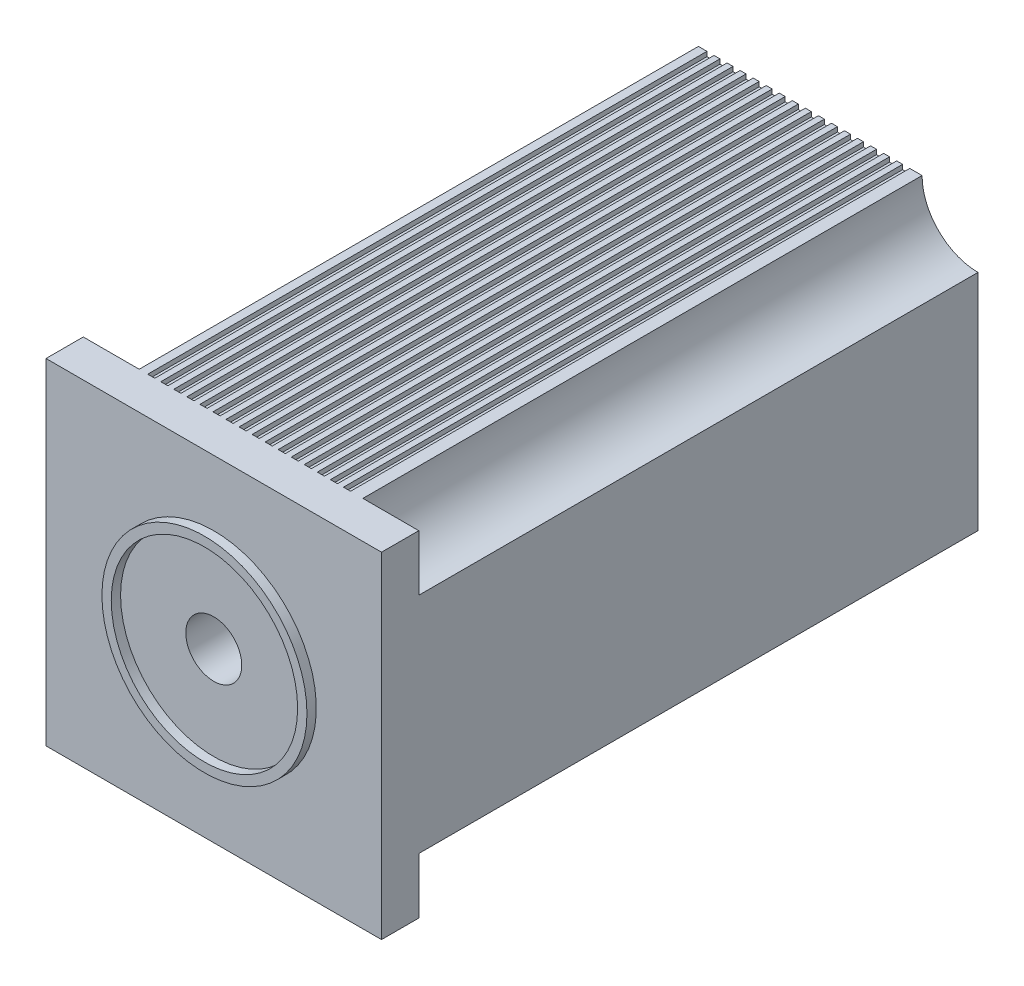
ISO-10303-21;
HEADER;
FILE_DESCRIPTION(('STEP AP214'),'2;1');
FILE_NAME('part.step','',(''),(''),'','','');
FILE_SCHEMA(('AUTOMOTIVE_DESIGN { 1 0 10303 214 1 1 1 1 }'));
ENDSEC;
DATA;
#1=APPLICATION_CONTEXT('core data for automotive mechanical design processes');
#2=APPLICATION_PROTOCOL_DEFINITION('international standard','automotive_design',2000,#1);
#3=PRODUCT_CONTEXT('',#1,'mechanical');
#4=PRODUCT('Part','Part','',(#3));
#5=PRODUCT_RELATED_PRODUCT_CATEGORY('part','',(#4));
#6=PRODUCT_DEFINITION_FORMATION('','',#4);
#7=PRODUCT_DEFINITION_CONTEXT('part definition',#1,'design');
#8=PRODUCT_DEFINITION('design','',#6,#7);
#9=PRODUCT_DEFINITION_SHAPE('','',#8);
#10=(LENGTH_UNIT() NAMED_UNIT(*) SI_UNIT(.MILLI.,.METRE.));
#11=(NAMED_UNIT(*) PLANE_ANGLE_UNIT() SI_UNIT($,.RADIAN.));
#12=(NAMED_UNIT(*) SI_UNIT($,.STERADIAN.) SOLID_ANGLE_UNIT());
#13=UNCERTAINTY_MEASURE_WITH_UNIT(LENGTH_MEASURE(1.E-05),#10,'distance_accuracy_value','');
#14=(GEOMETRIC_REPRESENTATION_CONTEXT(3) GLOBAL_UNCERTAINTY_ASSIGNED_CONTEXT((#13)) GLOBAL_UNIT_ASSIGNED_CONTEXT((#10,
#11,#12)) REPRESENTATION_CONTEXT('',''));
#15=CARTESIAN_POINT('',(0.,0.,0.));
#16=DIRECTION('',(0.,0.,1.));
#17=DIRECTION('',(1.,0.,0.));
#18=AXIS2_PLACEMENT_3D('',#15,#16,#17);
#19=CARTESIAN_POINT('',(-90.,-90.,-300.));
#20=DIRECTION('',(-1.,0.,0.));
#21=DIRECTION('',(0.,0.,1.));
#22=AXIS2_PLACEMENT_3D('',#19,#20,#21);
#23=PLANE('',#22);
#24=DIRECTION('',(0.,0.,1.));
#25=VECTOR('',#24,1.);
#26=CARTESIAN_POINT('',(-90.,-60.,-371.));
#27=LINE('',#26,#25);
#28=CARTESIAN_POINT('',(-90.,-60.,0.));
#29=VERTEX_POINT('',#28);
#30=CARTESIAN_POINT('',(-90.,-60.,-300.));
#31=VERTEX_POINT('',#30);
#32=EDGE_CURVE('E1510',#29,#31,#27,.F.);
#33=ORIENTED_EDGE('',*,*,#32,.F.);
#34=DIRECTION('',(0.,1.,0.));
#35=VECTOR('',#34,1.);
#36=CARTESIAN_POINT('',(-90.,-90.,0.));
#37=LINE('',#36,#35);
#38=CARTESIAN_POINT('',(-90.,-90.,0.));
#39=VERTEX_POINT('',#38);
#40=EDGE_CURVE('E1517',#39,#29,#37,.T.);
#41=ORIENTED_EDGE('',*,*,#40,.F.);
#42=DIRECTION('',(0.,0.,1.));
#43=VECTOR('',#42,1.);
#44=CARTESIAN_POINT('',(-90.,-90.,-300.));
#45=LINE('',#44,#43);
#46=CARTESIAN_POINT('',(-90.,-90.,20.));
#47=VERTEX_POINT('',#46);
#48=EDGE_CURVE('E1552',#39,#47,#45,.T.);
#49=ORIENTED_EDGE('',*,*,#48,.T.);
#50=DIRECTION('',(0.,-1.,0.));
#51=VECTOR('',#50,1.);
#52=CARTESIAN_POINT('',(-90.,-90.,20.));
#53=LINE('',#52,#51);
#54=CARTESIAN_POINT('',(-90.,90.,20.));
#55=VERTEX_POINT('',#54);
#56=EDGE_CURVE('E1525',#55,#47,#53,.T.);
#57=ORIENTED_EDGE('',*,*,#56,.F.);
#58=DIRECTION('',(0.,0.,1.));
#59=VECTOR('',#58,1.);
#60=CARTESIAN_POINT('',(-90.,90.,-300.));
#61=LINE('',#60,#59);
#62=CARTESIAN_POINT('',(-90.,90.,0.));
#63=VERTEX_POINT('',#62);
#64=EDGE_CURVE('E1555',#63,#55,#61,.T.);
#65=ORIENTED_EDGE('',*,*,#64,.F.);
#66=DIRECTION('',(0.,1.,0.));
#67=VECTOR('',#66,1.);
#68=CARTESIAN_POINT('',(-90.,-90.,0.));
#69=LINE('',#68,#67);
#70=CARTESIAN_POINT('',(-90.,60.,0.));
#71=VERTEX_POINT('',#70);
#72=EDGE_CURVE('E1523',#71,#63,#69,.T.);
#73=ORIENTED_EDGE('',*,*,#72,.F.);
#74=DIRECTION('',(0.,0.,1.));
#75=VECTOR('',#74,1.);
#76=CARTESIAN_POINT('',(-90.,60.,-371.));
#77=LINE('',#76,#75);
#78=CARTESIAN_POINT('',(-90.,60.,-300.));
#79=VERTEX_POINT('',#78);
#80=EDGE_CURVE('E1506',#79,#71,#77,.T.);
#81=ORIENTED_EDGE('',*,*,#80,.F.);
#82=DIRECTION('',(0.,-1.,0.));
#83=VECTOR('',#82,1.);
#84=CARTESIAN_POINT('',(-90.,-90.,-300.));
#85=LINE('',#84,#83);
#86=EDGE_CURVE('E1537',#79,#31,#85,.T.);
#87=ORIENTED_EDGE('',*,*,#86,.T.);
#88=EDGE_LOOP('',(#33,#41,#49,#57,#65,#73,#81,#87));
#89=FACE_BOUND('',#88,.T.);
#90=ADVANCED_FACE('F36',(#89),#23,.T.);
#91=CARTESIAN_POINT('',(-90.,90.,-300.));
#92=DIRECTION('',(0.,1.,0.));
#93=DIRECTION('',(0.,0.,1.));
#94=AXIS2_PLACEMENT_3D('',#91,#92,#93);
#95=PLANE('',#94);
#96=DIRECTION('',(0.,0.,1.));
#97=VECTOR('',#96,1.);
#98=CARTESIAN_POINT('',(-48.4160341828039,90.,-300.));
#99=LINE('',#98,#97);
#100=CARTESIAN_POINT('',(-48.4160341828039,90.,-300.));
#101=VERTEX_POINT('',#100);
#102=CARTESIAN_POINT('',(-48.4160341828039,90.,0.));
#103=VERTEX_POINT('',#102);
#104=EDGE_CURVE('E1467',#101,#103,#99,.T.);
#105=ORIENTED_EDGE('',*,*,#104,.F.);
#106=DIRECTION('',(-1.,0.,0.));
#107=VECTOR('',#106,1.);
#108=CARTESIAN_POINT('',(-90.,90.,-300.));
#109=LINE('',#108,#107);
#110=CARTESIAN_POINT('',(-51.6211987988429,90.,-300.));
#111=VERTEX_POINT('',#110);
#112=EDGE_CURVE('E1554',#101,#111,#109,.T.);
#113=ORIENTED_EDGE('',*,*,#112,.T.);
#114=DIRECTION('',(0.,0.,-1.));
#115=VECTOR('',#114,1.);
#116=CARTESIAN_POINT('',(-51.6211987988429,90.,-300.));
#117=LINE('',#116,#115);
#118=CARTESIAN_POINT('',(-51.6211987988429,90.,0.));
#119=VERTEX_POINT('',#118);
#120=EDGE_CURVE('E1480',#119,#111,#117,.T.);
#121=ORIENTED_EDGE('',*,*,#120,.F.);
#122=DIRECTION('',(1.,0.,0.));
#123=VECTOR('',#122,1.);
#124=CARTESIAN_POINT('',(-90.,90.,0.));
#125=LINE('',#124,#123);
#126=CARTESIAN_POINT('',(-55.4160341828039,90.,0.));
#127=VERTEX_POINT('',#126);
#128=EDGE_CURVE('E1585',#127,#119,#125,.T.);
#129=ORIENTED_EDGE('',*,*,#128,.F.);
#130=DIRECTION('',(0.,0.,1.));
#131=VECTOR('',#130,1.);
#132=CARTESIAN_POINT('',(-55.4160341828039,90.,-300.));
#133=LINE('',#132,#131);
#134=CARTESIAN_POINT('',(-55.4160341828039,90.,-300.));
#135=VERTEX_POINT('',#134);
#136=EDGE_CURVE('E1485',#135,#127,#133,.T.);
#137=ORIENTED_EDGE('',*,*,#136,.F.);
#138=CARTESIAN_POINT('',(-60.,90.,-300.));
#139=VERTEX_POINT('',#138);
#140=EDGE_CURVE('E1548',#135,#139,#109,.T.);
#141=ORIENTED_EDGE('',*,*,#140,.T.);
#142=DIRECTION('',(0.,0.,1.));
#143=VECTOR('',#142,1.);
#144=CARTESIAN_POINT('',(-60.,90.,-371.));
#145=LINE('',#144,#143);
#146=CARTESIAN_POINT('',(-60.,90.,0.));
#147=VERTEX_POINT('',#146);
#148=EDGE_CURVE('E1503',#147,#139,#145,.F.);
#149=ORIENTED_EDGE('',*,*,#148,.F.);
#150=DIRECTION('',(1.,0.,0.));
#151=VECTOR('',#150,1.);
#152=CARTESIAN_POINT('',(-90.,90.,0.));
#153=LINE('',#152,#151);
#154=EDGE_CURVE('E1576',#63,#147,#153,.T.);
#155=ORIENTED_EDGE('',*,*,#154,.F.);
#156=ORIENTED_EDGE('',*,*,#64,.T.);
#157=DIRECTION('',(-1.,0.,0.));
#158=VECTOR('',#157,1.);
#159=CARTESIAN_POINT('',(-90.,90.,20.));
#160=LINE('',#159,#158);
#161=CARTESIAN_POINT('',(90.,90.,20.));
#162=VERTEX_POINT('',#161);
#163=EDGE_CURVE('E1534',#162,#55,#160,.T.);
#164=ORIENTED_EDGE('',*,*,#163,.F.);
#165=DIRECTION('',(0.,0.,1.));
#166=VECTOR('',#165,1.);
#167=CARTESIAN_POINT('',(90.,90.,-300.));
#168=LINE('',#167,#166);
#169=CARTESIAN_POINT('',(90.,90.,0.));
#170=VERTEX_POINT('',#169);
#171=EDGE_CURVE('E1558',#170,#162,#168,.T.);
#172=ORIENTED_EDGE('',*,*,#171,.F.);
#173=DIRECTION('',(1.,0.,0.));
#174=VECTOR('',#173,1.);
#175=CARTESIAN_POINT('',(-90.,90.,0.));
#176=LINE('',#175,#174);
#177=CARTESIAN_POINT('',(60.,90.,0.));
#178=VERTEX_POINT('',#177);
#179=EDGE_CURVE('E1521',#178,#170,#176,.T.);
#180=ORIENTED_EDGE('',*,*,#179,.F.);
#181=DIRECTION('',(0.,0.,1.));
#182=VECTOR('',#181,1.);
#183=CARTESIAN_POINT('',(60.,90.,-371.));
#184=LINE('',#183,#182);
#185=CARTESIAN_POINT('',(60.,90.,-300.));
#186=VERTEX_POINT('',#185);
#187=EDGE_CURVE('E1501',#186,#178,#184,.T.);
#188=ORIENTED_EDGE('',*,*,#187,.F.);
#189=CARTESIAN_POINT('',(53.3788012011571,90.,-300.));
#190=VERTEX_POINT('',#189);
#191=EDGE_CURVE('E1549',#186,#190,#109,.T.);
#192=ORIENTED_EDGE('',*,*,#191,.T.);
#193=DIRECTION('',(0.,0.,-1.));
#194=VECTOR('',#193,1.);
#195=CARTESIAN_POINT('',(53.3788012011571,90.,-300.));
#196=LINE('',#195,#194);
#197=CARTESIAN_POINT('',(53.3788012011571,90.,0.));
#198=VERTEX_POINT('',#197);
#199=EDGE_CURVE('E1227',#198,#190,#196,.T.);
#200=ORIENTED_EDGE('',*,*,#199,.F.);
#201=DIRECTION('',(1.,0.,0.));
#202=VECTOR('',#201,1.);
#203=CARTESIAN_POINT('',(-90.,90.,0.));
#204=LINE('',#203,#202);
#205=CARTESIAN_POINT('',(49.5839658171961,90.,0.));
#206=VERTEX_POINT('',#205);
#207=EDGE_CURVE('E1692',#206,#198,#204,.T.);
#208=ORIENTED_EDGE('',*,*,#207,.F.);
#209=DIRECTION('',(0.,0.,1.));
#210=VECTOR('',#209,1.);
#211=CARTESIAN_POINT('',(49.5839658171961,90.,-300.));
#212=LINE('',#211,#210);
#213=CARTESIAN_POINT('',(49.5839658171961,90.,-300.));
#214=VERTEX_POINT('',#213);
#215=EDGE_CURVE('E1411',#214,#206,#212,.T.);
#216=ORIENTED_EDGE('',*,*,#215,.F.);
#217=CARTESIAN_POINT('',(46.3788012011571,90.,-300.));
#218=VERTEX_POINT('',#217);
#219=EDGE_CURVE('E1553',#214,#218,#109,.T.);
#220=ORIENTED_EDGE('',*,*,#219,.T.);
#221=DIRECTION('',(0.,0.,-1.));
#222=VECTOR('',#221,1.);
#223=CARTESIAN_POINT('',(46.3788012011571,90.,-300.));
#224=LINE('',#223,#222);
#225=CARTESIAN_POINT('',(46.3788012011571,90.,0.));
#226=VERTEX_POINT('',#225);
#227=EDGE_CURVE('E1413',#226,#218,#224,.T.);
#228=ORIENTED_EDGE('',*,*,#227,.F.);
#229=DIRECTION('',(1.,0.,0.));
#230=VECTOR('',#229,1.);
#231=CARTESIAN_POINT('',(-90.,90.,0.));
#232=LINE('',#231,#230);
#233=CARTESIAN_POINT('',(42.5839658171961,90.,0.));
#234=VERTEX_POINT('',#233);
#235=EDGE_CURVE('E1694',#234,#226,#232,.T.);
#236=ORIENTED_EDGE('',*,*,#235,.F.);
#237=DIRECTION('',(0.,0.,1.));
#238=VECTOR('',#237,1.);
#239=CARTESIAN_POINT('',(42.5839658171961,90.,-300.));
#240=LINE('',#239,#238);
#241=CARTESIAN_POINT('',(42.5839658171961,90.,-300.));
#242=VERTEX_POINT('',#241);
#243=EDGE_CURVE('E1415',#242,#234,#240,.T.);
#244=ORIENTED_EDGE('',*,*,#243,.F.);
#245=CARTESIAN_POINT('',(39.3788012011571,90.,-300.));
#246=VERTEX_POINT('',#245);
#247=EDGE_CURVE('E3688',#242,#246,#109,.T.);
#248=ORIENTED_EDGE('',*,*,#247,.T.);
#249=DIRECTION('',(0.,0.,-1.));
#250=VECTOR('',#249,1.);
#251=CARTESIAN_POINT('',(39.3788012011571,90.,-300.));
#252=LINE('',#251,#250);
#253=CARTESIAN_POINT('',(39.3788012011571,90.,0.));
#254=VERTEX_POINT('',#253);
#255=EDGE_CURVE('E1417',#254,#246,#252,.T.);
#256=ORIENTED_EDGE('',*,*,#255,.F.);
#257=DIRECTION('',(1.,0.,0.));
#258=VECTOR('',#257,1.);
#259=CARTESIAN_POINT('',(-90.,90.,0.));
#260=LINE('',#259,#258);
#261=CARTESIAN_POINT('',(35.5839658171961,90.,0.));
#262=VERTEX_POINT('',#261);
#263=EDGE_CURVE('E1696',#262,#254,#260,.T.);
#264=ORIENTED_EDGE('',*,*,#263,.F.);
#265=DIRECTION('',(0.,0.,1.));
#266=VECTOR('',#265,1.);
#267=CARTESIAN_POINT('',(35.5839658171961,90.,-300.));
#268=LINE('',#267,#266);
#269=CARTESIAN_POINT('',(35.5839658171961,90.,-300.));
#270=VERTEX_POINT('',#269);
#271=EDGE_CURVE('E1419',#270,#262,#268,.T.);
#272=ORIENTED_EDGE('',*,*,#271,.F.);
#273=CARTESIAN_POINT('',(32.3788012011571,90.,-300.));
#274=VERTEX_POINT('',#273);
#275=EDGE_CURVE('E3693',#270,#274,#109,.T.);
#276=ORIENTED_EDGE('',*,*,#275,.T.);
#277=DIRECTION('',(0.,0.,-1.));
#278=VECTOR('',#277,1.);
#279=CARTESIAN_POINT('',(32.3788012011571,90.,-300.));
#280=LINE('',#279,#278);
#281=CARTESIAN_POINT('',(32.3788012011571,90.,0.));
#282=VERTEX_POINT('',#281);
#283=EDGE_CURVE('E1421',#282,#274,#280,.T.);
#284=ORIENTED_EDGE('',*,*,#283,.F.);
#285=DIRECTION('',(1.,0.,0.));
#286=VECTOR('',#285,1.);
#287=CARTESIAN_POINT('',(-90.,90.,0.));
#288=LINE('',#287,#286);
#289=CARTESIAN_POINT('',(28.5839658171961,90.,0.));
#290=VERTEX_POINT('',#289);
#291=EDGE_CURVE('E1698',#290,#282,#288,.T.);
#292=ORIENTED_EDGE('',*,*,#291,.F.);
#293=DIRECTION('',(0.,0.,1.));
#294=VECTOR('',#293,1.);
#295=CARTESIAN_POINT('',(28.5839658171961,90.,-300.));
#296=LINE('',#295,#294);
#297=CARTESIAN_POINT('',(28.5839658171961,90.,-300.));
#298=VERTEX_POINT('',#297);
#299=EDGE_CURVE('E1423',#298,#290,#296,.T.);
#300=ORIENTED_EDGE('',*,*,#299,.F.);
#301=CARTESIAN_POINT('',(25.3788012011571,90.,-300.));
#302=VERTEX_POINT('',#301);
#303=EDGE_CURVE('E3698',#298,#302,#109,.T.);
#304=ORIENTED_EDGE('',*,*,#303,.T.);
#305=DIRECTION('',(0.,0.,-1.));
#306=VECTOR('',#305,1.);
#307=CARTESIAN_POINT('',(25.3788012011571,90.,-300.));
#308=LINE('',#307,#306);
#309=CARTESIAN_POINT('',(25.3788012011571,90.,0.));
#310=VERTEX_POINT('',#309);
#311=EDGE_CURVE('E1425',#310,#302,#308,.T.);
#312=ORIENTED_EDGE('',*,*,#311,.F.);
#313=DIRECTION('',(1.,0.,0.));
#314=VECTOR('',#313,1.);
#315=CARTESIAN_POINT('',(-90.,90.,0.));
#316=LINE('',#315,#314);
#317=CARTESIAN_POINT('',(21.5839658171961,90.,0.));
#318=VERTEX_POINT('',#317);
#319=EDGE_CURVE('E1700',#318,#310,#316,.T.);
#320=ORIENTED_EDGE('',*,*,#319,.F.);
#321=DIRECTION('',(0.,0.,1.));
#322=VECTOR('',#321,1.);
#323=CARTESIAN_POINT('',(21.5839658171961,90.,-300.));
#324=LINE('',#323,#322);
#325=CARTESIAN_POINT('',(21.5839658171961,90.,-300.));
#326=VERTEX_POINT('',#325);
#327=EDGE_CURVE('E1427',#326,#318,#324,.T.);
#328=ORIENTED_EDGE('',*,*,#327,.F.);
#329=CARTESIAN_POINT('',(18.3788012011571,90.,-300.));
#330=VERTEX_POINT('',#329);
#331=EDGE_CURVE('E3703',#326,#330,#109,.T.);
#332=ORIENTED_EDGE('',*,*,#331,.T.);
#333=DIRECTION('',(0.,0.,-1.));
#334=VECTOR('',#333,1.);
#335=CARTESIAN_POINT('',(18.3788012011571,90.,-300.));
#336=LINE('',#335,#334);
#337=CARTESIAN_POINT('',(18.3788012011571,90.,0.));
#338=VERTEX_POINT('',#337);
#339=EDGE_CURVE('E1429',#338,#330,#336,.T.);
#340=ORIENTED_EDGE('',*,*,#339,.F.);
#341=DIRECTION('',(1.,0.,0.));
#342=VECTOR('',#341,1.);
#343=CARTESIAN_POINT('',(-90.,90.,0.));
#344=LINE('',#343,#342);
#345=CARTESIAN_POINT('',(14.5839658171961,90.,0.));
#346=VERTEX_POINT('',#345);
#347=EDGE_CURVE('E1702',#346,#338,#344,.T.);
#348=ORIENTED_EDGE('',*,*,#347,.F.);
#349=DIRECTION('',(0.,0.,1.));
#350=VECTOR('',#349,1.);
#351=CARTESIAN_POINT('',(14.5839658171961,90.,-300.));
#352=LINE('',#351,#350);
#353=CARTESIAN_POINT('',(14.5839658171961,90.,-300.));
#354=VERTEX_POINT('',#353);
#355=EDGE_CURVE('E1431',#354,#346,#352,.T.);
#356=ORIENTED_EDGE('',*,*,#355,.F.);
#357=CARTESIAN_POINT('',(11.3788012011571,90.,-300.));
#358=VERTEX_POINT('',#357);
#359=EDGE_CURVE('E3708',#354,#358,#109,.T.);
#360=ORIENTED_EDGE('',*,*,#359,.T.);
#361=DIRECTION('',(0.,0.,-1.));
#362=VECTOR('',#361,1.);
#363=CARTESIAN_POINT('',(11.3788012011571,90.,-300.));
#364=LINE('',#363,#362);
#365=CARTESIAN_POINT('',(11.3788012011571,90.,0.));
#366=VERTEX_POINT('',#365);
#367=EDGE_CURVE('E1433',#366,#358,#364,.T.);
#368=ORIENTED_EDGE('',*,*,#367,.F.);
#369=DIRECTION('',(1.,0.,0.));
#370=VECTOR('',#369,1.);
#371=CARTESIAN_POINT('',(-90.,90.,0.));
#372=LINE('',#371,#370);
#373=CARTESIAN_POINT('',(7.5839658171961,90.,0.));
#374=VERTEX_POINT('',#373);
#375=EDGE_CURVE('E1704',#374,#366,#372,.T.);
#376=ORIENTED_EDGE('',*,*,#375,.F.);
#377=DIRECTION('',(0.,0.,1.));
#378=VECTOR('',#377,1.);
#379=CARTESIAN_POINT('',(7.5839658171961,90.,-300.));
#380=LINE('',#379,#378);
#381=CARTESIAN_POINT('',(7.5839658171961,90.,-300.));
#382=VERTEX_POINT('',#381);
#383=EDGE_CURVE('E1435',#382,#374,#380,.T.);
#384=ORIENTED_EDGE('',*,*,#383,.F.);
#385=CARTESIAN_POINT('',(4.37880120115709,90.,-300.));
#386=VERTEX_POINT('',#385);
#387=EDGE_CURVE('E3713',#382,#386,#109,.T.);
#388=ORIENTED_EDGE('',*,*,#387,.T.);
#389=DIRECTION('',(0.,0.,-1.));
#390=VECTOR('',#389,1.);
#391=CARTESIAN_POINT('',(4.37880120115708,90.,-300.));
#392=LINE('',#391,#390);
#393=CARTESIAN_POINT('',(4.37880120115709,90.,0.));
#394=VERTEX_POINT('',#393);
#395=EDGE_CURVE('E1437',#394,#386,#392,.T.);
#396=ORIENTED_EDGE('',*,*,#395,.F.);
#397=DIRECTION('',(1.,0.,0.));
#398=VECTOR('',#397,1.);
#399=CARTESIAN_POINT('',(-90.,90.,0.));
#400=LINE('',#399,#398);
#401=CARTESIAN_POINT('',(0.583965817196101,90.,0.));
#402=VERTEX_POINT('',#401);
#403=EDGE_CURVE('E1706',#402,#394,#400,.T.);
#404=ORIENTED_EDGE('',*,*,#403,.F.);
#405=DIRECTION('',(0.,0.,1.));
#406=VECTOR('',#405,1.);
#407=CARTESIAN_POINT('',(0.583965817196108,90.,-300.));
#408=LINE('',#407,#406);
#409=CARTESIAN_POINT('',(0.583965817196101,90.,-300.));
#410=VERTEX_POINT('',#409);
#411=EDGE_CURVE('E1439',#410,#402,#408,.T.);
#412=ORIENTED_EDGE('',*,*,#411,.F.);
#413=CARTESIAN_POINT('',(-2.62119879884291,90.,-300.));
#414=VERTEX_POINT('',#413);
#415=EDGE_CURVE('E3718',#410,#414,#109,.T.);
#416=ORIENTED_EDGE('',*,*,#415,.T.);
#417=DIRECTION('',(0.,0.,-1.));
#418=VECTOR('',#417,1.);
#419=CARTESIAN_POINT('',(-2.62119879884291,90.,-300.));
#420=LINE('',#419,#418);
#421=CARTESIAN_POINT('',(-2.62119879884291,90.,0.));
#422=VERTEX_POINT('',#421);
#423=EDGE_CURVE('E1441',#422,#414,#420,.T.);
#424=ORIENTED_EDGE('',*,*,#423,.F.);
#425=DIRECTION('',(1.,0.,0.));
#426=VECTOR('',#425,1.);
#427=CARTESIAN_POINT('',(-90.,90.,0.));
#428=LINE('',#427,#426);
#429=CARTESIAN_POINT('',(-6.4160341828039,90.,0.));
#430=VERTEX_POINT('',#429);
#431=EDGE_CURVE('E1708',#430,#422,#428,.T.);
#432=ORIENTED_EDGE('',*,*,#431,.F.);
#433=DIRECTION('',(0.,0.,1.));
#434=VECTOR('',#433,1.);
#435=CARTESIAN_POINT('',(-6.4160341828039,90.,-300.));
#436=LINE('',#435,#434);
#437=CARTESIAN_POINT('',(-6.4160341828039,90.,-300.));
#438=VERTEX_POINT('',#437);
#439=EDGE_CURVE('E1443',#438,#430,#436,.T.);
#440=ORIENTED_EDGE('',*,*,#439,.F.);
#441=CARTESIAN_POINT('',(-9.62119879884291,90.,-300.));
#442=VERTEX_POINT('',#441);
#443=EDGE_CURVE('E3723',#438,#442,#109,.T.);
#444=ORIENTED_EDGE('',*,*,#443,.T.);
#445=DIRECTION('',(0.,0.,-1.));
#446=VECTOR('',#445,1.);
#447=CARTESIAN_POINT('',(-9.62119879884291,90.,-300.));
#448=LINE('',#447,#446);
#449=CARTESIAN_POINT('',(-9.62119879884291,90.,0.));
#450=VERTEX_POINT('',#449);
#451=EDGE_CURVE('E1445',#450,#442,#448,.T.);
#452=ORIENTED_EDGE('',*,*,#451,.F.);
#453=DIRECTION('',(1.,0.,0.));
#454=VECTOR('',#453,1.);
#455=CARTESIAN_POINT('',(-90.,90.,0.));
#456=LINE('',#455,#454);
#457=CARTESIAN_POINT('',(-13.4160341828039,90.,0.));
#458=VERTEX_POINT('',#457);
#459=EDGE_CURVE('E1710',#458,#450,#456,.T.);
#460=ORIENTED_EDGE('',*,*,#459,.F.);
#461=DIRECTION('',(0.,0.,1.));
#462=VECTOR('',#461,1.);
#463=CARTESIAN_POINT('',(-13.4160341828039,90.,-300.));
#464=LINE('',#463,#462);
#465=CARTESIAN_POINT('',(-13.4160341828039,90.,-300.));
#466=VERTEX_POINT('',#465);
#467=EDGE_CURVE('E1447',#466,#458,#464,.T.);
#468=ORIENTED_EDGE('',*,*,#467,.F.);
#469=CARTESIAN_POINT('',(-16.6211987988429,90.,-300.));
#470=VERTEX_POINT('',#469);
#471=EDGE_CURVE('E3728',#466,#470,#109,.T.);
#472=ORIENTED_EDGE('',*,*,#471,.T.);
#473=DIRECTION('',(0.,0.,-1.));
#474=VECTOR('',#473,1.);
#475=CARTESIAN_POINT('',(-16.6211987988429,90.,-300.));
#476=LINE('',#475,#474);
#477=CARTESIAN_POINT('',(-16.6211987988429,90.,0.));
#478=VERTEX_POINT('',#477);
#479=EDGE_CURVE('E1449',#478,#470,#476,.T.);
#480=ORIENTED_EDGE('',*,*,#479,.F.);
#481=DIRECTION('',(1.,0.,0.));
#482=VECTOR('',#481,1.);
#483=CARTESIAN_POINT('',(-90.,90.,0.));
#484=LINE('',#483,#482);
#485=CARTESIAN_POINT('',(-20.4160341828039,90.,0.));
#486=VERTEX_POINT('',#485);
#487=EDGE_CURVE('E1712',#486,#478,#484,.T.);
#488=ORIENTED_EDGE('',*,*,#487,.F.);
#489=DIRECTION('',(0.,0.,1.));
#490=VECTOR('',#489,1.);
#491=CARTESIAN_POINT('',(-20.4160341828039,90.,-300.));
#492=LINE('',#491,#490);
#493=CARTESIAN_POINT('',(-20.4160341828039,90.,-300.));
#494=VERTEX_POINT('',#493);
#495=EDGE_CURVE('E1451',#494,#486,#492,.T.);
#496=ORIENTED_EDGE('',*,*,#495,.F.);
#497=CARTESIAN_POINT('',(-23.6211987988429,90.,-300.));
#498=VERTEX_POINT('',#497);
#499=EDGE_CURVE('E3733',#494,#498,#109,.T.);
#500=ORIENTED_EDGE('',*,*,#499,.T.);
#501=DIRECTION('',(0.,0.,-1.));
#502=VECTOR('',#501,1.);
#503=CARTESIAN_POINT('',(-23.6211987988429,90.,-300.));
#504=LINE('',#503,#502);
#505=CARTESIAN_POINT('',(-23.6211987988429,90.,0.));
#506=VERTEX_POINT('',#505);
#507=EDGE_CURVE('E1453',#506,#498,#504,.T.);
#508=ORIENTED_EDGE('',*,*,#507,.F.);
#509=DIRECTION('',(1.,0.,0.));
#510=VECTOR('',#509,1.);
#511=CARTESIAN_POINT('',(-90.,90.,0.));
#512=LINE('',#511,#510);
#513=CARTESIAN_POINT('',(-27.4160341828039,90.,0.));
#514=VERTEX_POINT('',#513);
#515=EDGE_CURVE('E1714',#514,#506,#512,.T.);
#516=ORIENTED_EDGE('',*,*,#515,.F.);
#517=DIRECTION('',(0.,0.,1.));
#518=VECTOR('',#517,1.);
#519=CARTESIAN_POINT('',(-27.4160341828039,90.,-300.));
#520=LINE('',#519,#518);
#521=CARTESIAN_POINT('',(-27.4160341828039,90.,-300.));
#522=VERTEX_POINT('',#521);
#523=EDGE_CURVE('E1455',#522,#514,#520,.T.);
#524=ORIENTED_EDGE('',*,*,#523,.F.);
#525=CARTESIAN_POINT('',(-30.6211987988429,90.,-300.));
#526=VERTEX_POINT('',#525);
#527=EDGE_CURVE('E3738',#522,#526,#109,.T.);
#528=ORIENTED_EDGE('',*,*,#527,.T.);
#529=DIRECTION('',(0.,0.,-1.));
#530=VECTOR('',#529,1.);
#531=CARTESIAN_POINT('',(-30.6211987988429,90.,-300.));
#532=LINE('',#531,#530);
#533=CARTESIAN_POINT('',(-30.6211987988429,90.,0.));
#534=VERTEX_POINT('',#533);
#535=EDGE_CURVE('E1457',#534,#526,#532,.T.);
#536=ORIENTED_EDGE('',*,*,#535,.F.);
#537=DIRECTION('',(1.,0.,0.));
#538=VECTOR('',#537,1.);
#539=CARTESIAN_POINT('',(-90.,90.,0.));
#540=LINE('',#539,#538);
#541=CARTESIAN_POINT('',(-34.4160341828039,90.,0.));
#542=VERTEX_POINT('',#541);
#543=EDGE_CURVE('E1716',#542,#534,#540,.T.);
#544=ORIENTED_EDGE('',*,*,#543,.F.);
#545=DIRECTION('',(0.,0.,1.));
#546=VECTOR('',#545,1.);
#547=CARTESIAN_POINT('',(-34.4160341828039,90.,-300.));
#548=LINE('',#547,#546);
#549=CARTESIAN_POINT('',(-34.4160341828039,90.,-300.));
#550=VERTEX_POINT('',#549);
#551=EDGE_CURVE('E1459',#550,#542,#548,.T.);
#552=ORIENTED_EDGE('',*,*,#551,.F.);
#553=CARTESIAN_POINT('',(-37.6211987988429,90.,-300.));
#554=VERTEX_POINT('',#553);
#555=EDGE_CURVE('E3743',#550,#554,#109,.T.);
#556=ORIENTED_EDGE('',*,*,#555,.T.);
#557=DIRECTION('',(0.,0.,-1.));
#558=VECTOR('',#557,1.);
#559=CARTESIAN_POINT('',(-37.6211987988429,90.,-300.));
#560=LINE('',#559,#558);
#561=CARTESIAN_POINT('',(-37.6211987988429,90.,0.));
#562=VERTEX_POINT('',#561);
#563=EDGE_CURVE('E1461',#562,#554,#560,.T.);
#564=ORIENTED_EDGE('',*,*,#563,.F.);
#565=DIRECTION('',(1.,0.,0.));
#566=VECTOR('',#565,1.);
#567=CARTESIAN_POINT('',(-90.,90.,0.));
#568=LINE('',#567,#566);
#569=CARTESIAN_POINT('',(-41.4160341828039,90.,0.));
#570=VERTEX_POINT('',#569);
#571=EDGE_CURVE('E1718',#570,#562,#568,.T.);
#572=ORIENTED_EDGE('',*,*,#571,.F.);
#573=DIRECTION('',(0.,0.,1.));
#574=VECTOR('',#573,1.);
#575=CARTESIAN_POINT('',(-41.4160341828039,90.,-300.));
#576=LINE('',#575,#574);
#577=CARTESIAN_POINT('',(-41.4160341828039,90.,-300.));
#578=VERTEX_POINT('',#577);
#579=EDGE_CURVE('E1463',#578,#570,#576,.T.);
#580=ORIENTED_EDGE('',*,*,#579,.F.);
#581=CARTESIAN_POINT('',(-44.6211987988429,90.,-300.));
#582=VERTEX_POINT('',#581);
#583=EDGE_CURVE('E3686',#578,#582,#109,.T.);
#584=ORIENTED_EDGE('',*,*,#583,.T.);
#585=DIRECTION('',(0.,0.,-1.));
#586=VECTOR('',#585,1.);
#587=CARTESIAN_POINT('',(-44.6211987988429,90.,-300.));
#588=LINE('',#587,#586);
#589=CARTESIAN_POINT('',(-44.6211987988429,90.,0.));
#590=VERTEX_POINT('',#589);
#591=EDGE_CURVE('E1465',#590,#582,#588,.T.);
#592=ORIENTED_EDGE('',*,*,#591,.F.);
#593=DIRECTION('',(1.,0.,0.));
#594=VECTOR('',#593,1.);
#595=CARTESIAN_POINT('',(-90.,90.,0.));
#596=LINE('',#595,#594);
#597=EDGE_CURVE('E1720',#103,#590,#596,.T.);
#598=ORIENTED_EDGE('',*,*,#597,.F.);
#599=EDGE_LOOP('',(#105,#113,#121,#129,#137,#141,#149,#155,#156,#164,#172,#180,#188,#192,#200,
#208,#216,#220,#228,#236,#244,#248,#256,#264,#272,#276,#284,#292,#300,#304,#312,#320,#328,#332,
#340,#348,#356,#360,#368,#376,#384,#388,#396,#404,#412,#416,#424,#432,#440,#444,#452,#460,#468,
#472,#480,#488,#496,#500,#508,#516,#524,#528,#536,#544,#552,#556,#564,#572,#580,#584,#592,#598));
#600=FACE_BOUND('',#599,.T.);
#601=ADVANCED_FACE('F2030',(#600),#95,.T.);
#602=CARTESIAN_POINT('',(90.,-90.,-300.));
#603=DIRECTION('',(1.,0.,0.));
#604=DIRECTION('',(0.,0.,-1.));
#605=AXIS2_PLACEMENT_3D('',#602,#603,#604);
#606=PLANE('',#605);
#607=DIRECTION('',(0.,0.,1.));
#608=VECTOR('',#607,1.);
#609=CARTESIAN_POINT('',(90.,-60.,-371.));
#610=LINE('',#609,#608);
#611=CARTESIAN_POINT('',(90.,-60.,-300.));
#612=VERTEX_POINT('',#611);
#613=CARTESIAN_POINT('',(90.,-60.,0.));
#614=VERTEX_POINT('',#613);
#615=EDGE_CURVE('E1515',#612,#614,#610,.T.);
#616=ORIENTED_EDGE('',*,*,#615,.F.);
#617=DIRECTION('',(0.,1.,0.));
#618=VECTOR('',#617,1.);
#619=CARTESIAN_POINT('',(90.,-90.,-300.));
#620=LINE('',#619,#618);
#621=CARTESIAN_POINT('',(90.,60.,-300.));
#622=VERTEX_POINT('',#621);
#623=EDGE_CURVE('E1544',#612,#622,#620,.T.);
#624=ORIENTED_EDGE('',*,*,#623,.T.);
#625=DIRECTION('',(0.,0.,1.));
#626=VECTOR('',#625,1.);
#627=CARTESIAN_POINT('',(90.,60.,-371.));
#628=LINE('',#627,#626);
#629=CARTESIAN_POINT('',(90.,60.,0.));
#630=VERTEX_POINT('',#629);
#631=EDGE_CURVE('E1499',#630,#622,#628,.F.);
#632=ORIENTED_EDGE('',*,*,#631,.F.);
#633=DIRECTION('',(0.,-1.,0.));
#634=VECTOR('',#633,1.);
#635=CARTESIAN_POINT('',(90.,-90.,0.));
#636=LINE('',#635,#634);
#637=EDGE_CURVE('E1574',#170,#630,#636,.T.);
#638=ORIENTED_EDGE('',*,*,#637,.F.);
#639=ORIENTED_EDGE('',*,*,#171,.T.);
#640=DIRECTION('',(0.,1.,0.));
#641=VECTOR('',#640,1.);
#642=CARTESIAN_POINT('',(90.,-90.,20.));
#643=LINE('',#642,#641);
#644=CARTESIAN_POINT('',(90.,-90.,20.));
#645=VERTEX_POINT('',#644);
#646=EDGE_CURVE('E1531',#645,#162,#643,.T.);
#647=ORIENTED_EDGE('',*,*,#646,.F.);
#648=DIRECTION('',(0.,0.,1.));
#649=VECTOR('',#648,1.);
#650=CARTESIAN_POINT('',(90.,-90.,-300.));
#651=LINE('',#650,#649);
#652=CARTESIAN_POINT('',(90.,-90.,0.));
#653=VERTEX_POINT('',#652);
#654=EDGE_CURVE('E1560',#653,#645,#651,.T.);
#655=ORIENTED_EDGE('',*,*,#654,.F.);
#656=DIRECTION('',(0.,-1.,0.));
#657=VECTOR('',#656,1.);
#658=CARTESIAN_POINT('',(90.,-90.,0.));
#659=LINE('',#658,#657);
#660=EDGE_CURVE('E1519',#614,#653,#659,.T.);
#661=ORIENTED_EDGE('',*,*,#660,.F.);
#662=EDGE_LOOP('',(#616,#624,#632,#638,#639,#647,#655,#661));
#663=FACE_BOUND('',#662,.T.);
#664=ADVANCED_FACE('F2015',(#663),#606,.T.);
#665=CARTESIAN_POINT('',(-90.,-90.,-300.));
#666=DIRECTION('',(0.,-1.,0.));
#667=DIRECTION('',(0.,0.,-1.));
#668=AXIS2_PLACEMENT_3D('',#665,#666,#667);
#669=PLANE('',#668);
#670=DIRECTION('',(0.,0.,-1.));
#671=VECTOR('',#670,1.);
#672=CARTESIAN_POINT('',(-50.9297465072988,-90.,-300.));
#673=LINE('',#672,#671);
#674=CARTESIAN_POINT('',(-50.9297465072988,-90.,0.));
#675=VERTEX_POINT('',#674);
#676=CARTESIAN_POINT('',(-50.9297465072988,-90.,-300.));
#677=VERTEX_POINT('',#676);
#678=EDGE_CURVE('E1195',#675,#677,#673,.T.);
#679=ORIENTED_EDGE('',*,*,#678,.F.);
#680=DIRECTION('',(1.,0.,0.));
#681=VECTOR('',#680,1.);
#682=CARTESIAN_POINT('',(-90.,-90.,0.));
#683=LINE('',#682,#681);
#684=CARTESIAN_POINT('',(-47.6856559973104,-90.,0.));
#685=VERTEX_POINT('',#684);
#686=EDGE_CURVE('E1886',#675,#685,#683,.T.);
#687=ORIENTED_EDGE('',*,*,#686,.T.);
#688=DIRECTION('',(0.,0.,1.));
#689=VECTOR('',#688,1.);
#690=CARTESIAN_POINT('',(-47.6856559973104,-90.,-300.));
#691=LINE('',#690,#689);
#692=CARTESIAN_POINT('',(-47.6856559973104,-90.,-300.));
#693=VERTEX_POINT('',#692);
#694=EDGE_CURVE('E928',#693,#685,#691,.T.);
#695=ORIENTED_EDGE('',*,*,#694,.F.);
#696=DIRECTION('',(1.,0.,0.));
#697=VECTOR('',#696,1.);
#698=CARTESIAN_POINT('',(-90.,-90.,-300.));
#699=LINE('',#698,#697);
#700=CARTESIAN_POINT('',(-43.9297465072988,-90.,-300.));
#701=VERTEX_POINT('',#700);
#702=EDGE_CURVE('E1925',#693,#701,#699,.T.);
#703=ORIENTED_EDGE('',*,*,#702,.T.);
#704=DIRECTION('',(0.,0.,-1.));
#705=VECTOR('',#704,1.);
#706=CARTESIAN_POINT('',(-43.9297465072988,-90.,-300.));
#707=LINE('',#706,#705);
#708=CARTESIAN_POINT('',(-43.9297465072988,-90.,0.));
#709=VERTEX_POINT('',#708);
#710=EDGE_CURVE('E1192',#709,#701,#707,.T.);
#711=ORIENTED_EDGE('',*,*,#710,.F.);
#712=DIRECTION('',(1.,0.,0.));
#713=VECTOR('',#712,1.);
#714=CARTESIAN_POINT('',(-90.,-90.,0.));
#715=LINE('',#714,#713);
#716=CARTESIAN_POINT('',(-40.6856559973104,-90.,0.));
#717=VERTEX_POINT('',#716);
#718=EDGE_CURVE('E1883',#709,#717,#715,.T.);
#719=ORIENTED_EDGE('',*,*,#718,.T.);
#720=DIRECTION('',(0.,0.,1.));
#721=VECTOR('',#720,1.);
#722=CARTESIAN_POINT('',(-40.6856559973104,-90.,-300.));
#723=LINE('',#722,#721);
#724=CARTESIAN_POINT('',(-40.6856559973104,-90.,-300.));
#725=VERTEX_POINT('',#724);
#726=EDGE_CURVE('E1190',#725,#717,#723,.T.);
#727=ORIENTED_EDGE('',*,*,#726,.F.);
#728=CARTESIAN_POINT('',(-36.9297465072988,-90.,-300.));
#729=VERTEX_POINT('',#728);
#730=EDGE_CURVE('E1927',#725,#729,#699,.T.);
#731=ORIENTED_EDGE('',*,*,#730,.T.);
#732=DIRECTION('',(0.,0.,-1.));
#733=VECTOR('',#732,1.);
#734=CARTESIAN_POINT('',(-36.9297465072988,-90.,-300.));
#735=LINE('',#734,#733);
#736=CARTESIAN_POINT('',(-36.9297465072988,-90.,0.));
#737=VERTEX_POINT('',#736);
#738=EDGE_CURVE('E1188',#737,#729,#735,.T.);
#739=ORIENTED_EDGE('',*,*,#738,.F.);
#740=DIRECTION('',(1.,0.,0.));
#741=VECTOR('',#740,1.);
#742=CARTESIAN_POINT('',(-90.,-90.,0.));
#743=LINE('',#742,#741);
#744=CARTESIAN_POINT('',(-33.6856559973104,-90.,0.));
#745=VERTEX_POINT('',#744);
#746=EDGE_CURVE('E1880',#737,#745,#743,.T.);
#747=ORIENTED_EDGE('',*,*,#746,.T.);
#748=DIRECTION('',(0.,0.,1.));
#749=VECTOR('',#748,1.);
#750=CARTESIAN_POINT('',(-33.6856559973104,-90.,-300.));
#751=LINE('',#750,#749);
#752=CARTESIAN_POINT('',(-33.6856559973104,-90.,-300.));
#753=VERTEX_POINT('',#752);
#754=EDGE_CURVE('E1186',#753,#745,#751,.T.);
#755=ORIENTED_EDGE('',*,*,#754,.F.);
#756=CARTESIAN_POINT('',(-29.9297465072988,-90.,-300.));
#757=VERTEX_POINT('',#756);
#758=EDGE_CURVE('E1931',#753,#757,#699,.T.);
#759=ORIENTED_EDGE('',*,*,#758,.T.);
#760=DIRECTION('',(0.,0.,-1.));
#761=VECTOR('',#760,1.);
#762=CARTESIAN_POINT('',(-29.9297465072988,-90.,-300.));
#763=LINE('',#762,#761);
#764=CARTESIAN_POINT('',(-29.9297465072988,-90.,0.));
#765=VERTEX_POINT('',#764);
#766=EDGE_CURVE('E1184',#765,#757,#763,.T.);
#767=ORIENTED_EDGE('',*,*,#766,.F.);
#768=DIRECTION('',(1.,0.,0.));
#769=VECTOR('',#768,1.);
#770=CARTESIAN_POINT('',(-90.,-90.,0.));
#771=LINE('',#770,#769);
#772=CARTESIAN_POINT('',(-26.6856559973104,-90.,0.));
#773=VERTEX_POINT('',#772);
#774=EDGE_CURVE('E1877',#765,#773,#771,.T.);
#775=ORIENTED_EDGE('',*,*,#774,.T.);
#776=DIRECTION('',(0.,0.,1.));
#777=VECTOR('',#776,1.);
#778=CARTESIAN_POINT('',(-26.6856559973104,-90.,-300.));
#779=LINE('',#778,#777);
#780=CARTESIAN_POINT('',(-26.6856559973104,-90.,-300.));
#781=VERTEX_POINT('',#780);
#782=EDGE_CURVE('E1182',#781,#773,#779,.T.);
#783=ORIENTED_EDGE('',*,*,#782,.F.);
#784=CARTESIAN_POINT('',(-22.9297465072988,-90.,-300.));
#785=VERTEX_POINT('',#784);
#786=EDGE_CURVE('E1936',#781,#785,#699,.T.);
#787=ORIENTED_EDGE('',*,*,#786,.T.);
#788=DIRECTION('',(0.,0.,-1.));
#789=VECTOR('',#788,1.);
#790=CARTESIAN_POINT('',(-22.9297465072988,-90.,-300.));
#791=LINE('',#790,#789);
#792=CARTESIAN_POINT('',(-22.9297465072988,-90.,0.));
#793=VERTEX_POINT('',#792);
#794=EDGE_CURVE('E1180',#793,#785,#791,.T.);
#795=ORIENTED_EDGE('',*,*,#794,.F.);
#796=DIRECTION('',(1.,0.,0.));
#797=VECTOR('',#796,1.);
#798=CARTESIAN_POINT('',(-90.,-90.,0.));
#799=LINE('',#798,#797);
#800=CARTESIAN_POINT('',(-19.6856559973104,-90.,0.));
#801=VERTEX_POINT('',#800);
#802=EDGE_CURVE('E1874',#793,#801,#799,.T.);
#803=ORIENTED_EDGE('',*,*,#802,.T.);
#804=DIRECTION('',(0.,0.,1.));
#805=VECTOR('',#804,1.);
#806=CARTESIAN_POINT('',(-19.6856559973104,-90.,-300.));
#807=LINE('',#806,#805);
#808=CARTESIAN_POINT('',(-19.6856559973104,-90.,-300.));
#809=VERTEX_POINT('',#808);
#810=EDGE_CURVE('E1178',#809,#801,#807,.T.);
#811=ORIENTED_EDGE('',*,*,#810,.F.);
#812=CARTESIAN_POINT('',(-15.9297465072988,-90.,-300.));
#813=VERTEX_POINT('',#812);
#814=EDGE_CURVE('E1941',#809,#813,#699,.T.);
#815=ORIENTED_EDGE('',*,*,#814,.T.);
#816=DIRECTION('',(0.,0.,-1.));
#817=VECTOR('',#816,1.);
#818=CARTESIAN_POINT('',(-15.9297465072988,-90.,-300.));
#819=LINE('',#818,#817);
#820=CARTESIAN_POINT('',(-15.9297465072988,-90.,0.));
#821=VERTEX_POINT('',#820);
#822=EDGE_CURVE('E1176',#821,#813,#819,.T.);
#823=ORIENTED_EDGE('',*,*,#822,.F.);
#824=DIRECTION('',(1.,0.,0.));
#825=VECTOR('',#824,1.);
#826=CARTESIAN_POINT('',(-90.,-90.,0.));
#827=LINE('',#826,#825);
#828=CARTESIAN_POINT('',(-12.6856559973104,-90.,0.));
#829=VERTEX_POINT('',#828);
#830=EDGE_CURVE('E1871',#821,#829,#827,.T.);
#831=ORIENTED_EDGE('',*,*,#830,.T.);
#832=DIRECTION('',(0.,0.,1.));
#833=VECTOR('',#832,1.);
#834=CARTESIAN_POINT('',(-12.6856559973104,-90.,-300.));
#835=LINE('',#834,#833);
#836=CARTESIAN_POINT('',(-12.6856559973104,-90.,-300.));
#837=VERTEX_POINT('',#836);
#838=EDGE_CURVE('E1174',#837,#829,#835,.T.);
#839=ORIENTED_EDGE('',*,*,#838,.F.);
#840=CARTESIAN_POINT('',(-8.92974650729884,-90.,-300.));
#841=VERTEX_POINT('',#840);
#842=EDGE_CURVE('E1946',#837,#841,#699,.T.);
#843=ORIENTED_EDGE('',*,*,#842,.T.);
#844=DIRECTION('',(0.,0.,-1.));
#845=VECTOR('',#844,1.);
#846=CARTESIAN_POINT('',(-8.92974650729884,-90.,-300.));
#847=LINE('',#846,#845);
#848=CARTESIAN_POINT('',(-8.92974650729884,-90.,0.));
#849=VERTEX_POINT('',#848);
#850=EDGE_CURVE('E1172',#849,#841,#847,.T.);
#851=ORIENTED_EDGE('',*,*,#850,.F.);
#852=DIRECTION('',(1.,0.,0.));
#853=VECTOR('',#852,1.);
#854=CARTESIAN_POINT('',(-90.,-90.,0.));
#855=LINE('',#854,#853);
#856=CARTESIAN_POINT('',(-5.68565599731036,-90.,0.));
#857=VERTEX_POINT('',#856);
#858=EDGE_CURVE('E1868',#849,#857,#855,.T.);
#859=ORIENTED_EDGE('',*,*,#858,.T.);
#860=DIRECTION('',(0.,0.,1.));
#861=VECTOR('',#860,1.);
#862=CARTESIAN_POINT('',(-5.68565599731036,-90.,-300.));
#863=LINE('',#862,#861);
#864=CARTESIAN_POINT('',(-5.68565599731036,-90.,-300.));
#865=VERTEX_POINT('',#864);
#866=EDGE_CURVE('E1170',#865,#857,#863,.T.);
#867=ORIENTED_EDGE('',*,*,#866,.F.);
#868=CARTESIAN_POINT('',(-1.92974650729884,-90.,-300.));
#869=VERTEX_POINT('',#868);
#870=EDGE_CURVE('E1951',#865,#869,#699,.T.);
#871=ORIENTED_EDGE('',*,*,#870,.T.);
#872=DIRECTION('',(0.,0.,-1.));
#873=VECTOR('',#872,1.);
#874=CARTESIAN_POINT('',(-1.92974650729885,-90.,-300.));
#875=LINE('',#874,#873);
#876=CARTESIAN_POINT('',(-1.92974650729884,-90.,0.));
#877=VERTEX_POINT('',#876);
#878=EDGE_CURVE('E1168',#877,#869,#875,.T.);
#879=ORIENTED_EDGE('',*,*,#878,.F.);
#880=DIRECTION('',(1.,0.,0.));
#881=VECTOR('',#880,1.);
#882=CARTESIAN_POINT('',(-90.,-90.,0.));
#883=LINE('',#882,#881);
#884=CARTESIAN_POINT('',(1.31434400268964,-90.,0.));
#885=VERTEX_POINT('',#884);
#886=EDGE_CURVE('E1865',#877,#885,#883,.T.);
#887=ORIENTED_EDGE('',*,*,#886,.T.);
#888=DIRECTION('',(0.,0.,1.));
#889=VECTOR('',#888,1.);
#890=CARTESIAN_POINT('',(1.31434400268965,-90.,-300.));
#891=LINE('',#890,#889);
#892=CARTESIAN_POINT('',(1.31434400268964,-90.,-300.));
#893=VERTEX_POINT('',#892);
#894=EDGE_CURVE('E1166',#893,#885,#891,.T.);
#895=ORIENTED_EDGE('',*,*,#894,.F.);
#896=CARTESIAN_POINT('',(5.07025349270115,-90.,-300.));
#897=VERTEX_POINT('',#896);
#898=EDGE_CURVE('E1956',#893,#897,#699,.T.);
#899=ORIENTED_EDGE('',*,*,#898,.T.);
#900=DIRECTION('',(0.,0.,-1.));
#901=VECTOR('',#900,1.);
#902=CARTESIAN_POINT('',(5.07025349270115,-90.,-300.));
#903=LINE('',#902,#901);
#904=CARTESIAN_POINT('',(5.07025349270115,-90.,0.));
#905=VERTEX_POINT('',#904);
#906=EDGE_CURVE('E1164',#905,#897,#903,.T.);
#907=ORIENTED_EDGE('',*,*,#906,.F.);
#908=DIRECTION('',(1.,0.,0.));
#909=VECTOR('',#908,1.);
#910=CARTESIAN_POINT('',(-90.,-90.,0.));
#911=LINE('',#910,#909);
#912=CARTESIAN_POINT('',(8.31434400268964,-90.,0.));
#913=VERTEX_POINT('',#912);
#914=EDGE_CURVE('E1862',#905,#913,#911,.T.);
#915=ORIENTED_EDGE('',*,*,#914,.T.);
#916=DIRECTION('',(0.,0.,1.));
#917=VECTOR('',#916,1.);
#918=CARTESIAN_POINT('',(8.31434400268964,-90.,-300.));
#919=LINE('',#918,#917);
#920=CARTESIAN_POINT('',(8.31434400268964,-90.,-300.));
#921=VERTEX_POINT('',#920);
#922=EDGE_CURVE('E1162',#921,#913,#919,.T.);
#923=ORIENTED_EDGE('',*,*,#922,.F.);
#924=CARTESIAN_POINT('',(12.0702534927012,-90.,-300.));
#925=VERTEX_POINT('',#924);
#926=EDGE_CURVE('E1961',#921,#925,#699,.T.);
#927=ORIENTED_EDGE('',*,*,#926,.T.);
#928=DIRECTION('',(0.,0.,-1.));
#929=VECTOR('',#928,1.);
#930=CARTESIAN_POINT('',(12.0702534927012,-90.,-300.));
#931=LINE('',#930,#929);
#932=CARTESIAN_POINT('',(12.0702534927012,-90.,0.));
#933=VERTEX_POINT('',#932);
#934=EDGE_CURVE('E1160',#933,#925,#931,.T.);
#935=ORIENTED_EDGE('',*,*,#934,.F.);
#936=DIRECTION('',(1.,0.,0.));
#937=VECTOR('',#936,1.);
#938=CARTESIAN_POINT('',(-90.,-90.,0.));
#939=LINE('',#938,#937);
#940=CARTESIAN_POINT('',(15.3143440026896,-90.,0.));
#941=VERTEX_POINT('',#940);
#942=EDGE_CURVE('E1859',#933,#941,#939,.T.);
#943=ORIENTED_EDGE('',*,*,#942,.T.);
#944=DIRECTION('',(0.,0.,1.));
#945=VECTOR('',#944,1.);
#946=CARTESIAN_POINT('',(15.3143440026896,-90.,-300.));
#947=LINE('',#946,#945);
#948=CARTESIAN_POINT('',(15.3143440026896,-90.,-300.));
#949=VERTEX_POINT('',#948);
#950=EDGE_CURVE('E1158',#949,#941,#947,.T.);
#951=ORIENTED_EDGE('',*,*,#950,.F.);
#952=CARTESIAN_POINT('',(19.0702534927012,-90.,-300.));
#953=VERTEX_POINT('',#952);
#954=EDGE_CURVE('E1966',#949,#953,#699,.T.);
#955=ORIENTED_EDGE('',*,*,#954,.T.);
#956=DIRECTION('',(0.,0.,-1.));
#957=VECTOR('',#956,1.);
#958=CARTESIAN_POINT('',(19.0702534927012,-90.,-300.));
#959=LINE('',#958,#957);
#960=CARTESIAN_POINT('',(19.0702534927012,-90.,0.));
#961=VERTEX_POINT('',#960);
#962=EDGE_CURVE('E1156',#961,#953,#959,.T.);
#963=ORIENTED_EDGE('',*,*,#962,.F.);
#964=DIRECTION('',(1.,0.,0.));
#965=VECTOR('',#964,1.);
#966=CARTESIAN_POINT('',(-90.,-90.,0.));
#967=LINE('',#966,#965);
#968=CARTESIAN_POINT('',(22.3143440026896,-90.,0.));
#969=VERTEX_POINT('',#968);
#970=EDGE_CURVE('E1856',#961,#969,#967,.T.);
#971=ORIENTED_EDGE('',*,*,#970,.T.);
#972=DIRECTION('',(0.,0.,1.));
#973=VECTOR('',#972,1.);
#974=CARTESIAN_POINT('',(22.3143440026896,-90.,-300.));
#975=LINE('',#974,#973);
#976=CARTESIAN_POINT('',(22.3143440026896,-90.,-300.));
#977=VERTEX_POINT('',#976);
#978=EDGE_CURVE('E1154',#977,#969,#975,.T.);
#979=ORIENTED_EDGE('',*,*,#978,.F.);
#980=CARTESIAN_POINT('',(26.0702534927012,-90.,-300.));
#981=VERTEX_POINT('',#980);
#982=EDGE_CURVE('E1971',#977,#981,#699,.T.);
#983=ORIENTED_EDGE('',*,*,#982,.T.);
#984=DIRECTION('',(0.,0.,-1.));
#985=VECTOR('',#984,1.);
#986=CARTESIAN_POINT('',(26.0702534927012,-90.,-300.));
#987=LINE('',#986,#985);
#988=CARTESIAN_POINT('',(26.0702534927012,-90.,0.));
#989=VERTEX_POINT('',#988);
#990=EDGE_CURVE('E1152',#989,#981,#987,.T.);
#991=ORIENTED_EDGE('',*,*,#990,.F.);
#992=DIRECTION('',(1.,0.,0.));
#993=VECTOR('',#992,1.);
#994=CARTESIAN_POINT('',(-90.,-90.,0.));
#995=LINE('',#994,#993);
#996=CARTESIAN_POINT('',(29.3143440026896,-90.,0.));
#997=VERTEX_POINT('',#996);
#998=EDGE_CURVE('E1853',#989,#997,#995,.T.);
#999=ORIENTED_EDGE('',*,*,#998,.T.);
#1000=DIRECTION('',(0.,0.,1.));
#1001=VECTOR('',#1000,1.);
#1002=CARTESIAN_POINT('',(29.3143440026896,-90.,-300.));
#1003=LINE('',#1002,#1001);
#1004=CARTESIAN_POINT('',(29.3143440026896,-90.,-300.));
#1005=VERTEX_POINT('',#1004);
#1006=EDGE_CURVE('E1150',#1005,#997,#1003,.T.);
#1007=ORIENTED_EDGE('',*,*,#1006,.F.);
#1008=CARTESIAN_POINT('',(33.0702534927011,-90.,-300.));
#1009=VERTEX_POINT('',#1008);
#1010=EDGE_CURVE('E1976',#1005,#1009,#699,.T.);
#1011=ORIENTED_EDGE('',*,*,#1010,.T.);
#1012=DIRECTION('',(0.,0.,-1.));
#1013=VECTOR('',#1012,1.);
#1014=CARTESIAN_POINT('',(33.0702534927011,-90.,-300.));
#1015=LINE('',#1014,#1013);
#1016=CARTESIAN_POINT('',(33.0702534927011,-90.,0.));
#1017=VERTEX_POINT('',#1016);
#1018=EDGE_CURVE('E1148',#1017,#1009,#1015,.T.);
#1019=ORIENTED_EDGE('',*,*,#1018,.F.);
#1020=DIRECTION('',(1.,0.,0.));
#1021=VECTOR('',#1020,1.);
#1022=CARTESIAN_POINT('',(-90.,-90.,0.));
#1023=LINE('',#1022,#1021);
#1024=CARTESIAN_POINT('',(36.3143440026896,-90.,0.));
#1025=VERTEX_POINT('',#1024);
#1026=EDGE_CURVE('E1850',#1017,#1025,#1023,.T.);
#1027=ORIENTED_EDGE('',*,*,#1026,.T.);
#1028=DIRECTION('',(0.,0.,1.));
#1029=VECTOR('',#1028,1.);
#1030=CARTESIAN_POINT('',(36.3143440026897,-90.,-300.));
#1031=LINE('',#1030,#1029);
#1032=CARTESIAN_POINT('',(36.3143440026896,-90.,-300.));
#1033=VERTEX_POINT('',#1032);
#1034=EDGE_CURVE('E1146',#1033,#1025,#1031,.T.);
#1035=ORIENTED_EDGE('',*,*,#1034,.F.);
#1036=CARTESIAN_POINT('',(40.0702534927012,-90.,-300.));
#1037=VERTEX_POINT('',#1036);
#1038=EDGE_CURVE('E1981',#1033,#1037,#699,.T.);
#1039=ORIENTED_EDGE('',*,*,#1038,.T.);
#1040=DIRECTION('',(0.,0.,-1.));
#1041=VECTOR('',#1040,1.);
#1042=CARTESIAN_POINT('',(40.0702534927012,-90.,-300.));
#1043=LINE('',#1042,#1041);
#1044=CARTESIAN_POINT('',(40.0702534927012,-90.,0.));
#1045=VERTEX_POINT('',#1044);
#1046=EDGE_CURVE('E1144',#1045,#1037,#1043,.T.);
#1047=ORIENTED_EDGE('',*,*,#1046,.F.);
#1048=DIRECTION('',(1.,0.,0.));
#1049=VECTOR('',#1048,1.);
#1050=CARTESIAN_POINT('',(-90.,-90.,0.));
#1051=LINE('',#1050,#1049);
#1052=CARTESIAN_POINT('',(43.3143440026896,-90.,0.));
#1053=VERTEX_POINT('',#1052);
#1054=EDGE_CURVE('E1847',#1045,#1053,#1051,.T.);
#1055=ORIENTED_EDGE('',*,*,#1054,.T.);
#1056=DIRECTION('',(0.,0.,1.));
#1057=VECTOR('',#1056,1.);
#1058=CARTESIAN_POINT('',(43.3143440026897,-90.,-300.));
#1059=LINE('',#1058,#1057);
#1060=CARTESIAN_POINT('',(43.3143440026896,-90.,-300.));
#1061=VERTEX_POINT('',#1060);
#1062=EDGE_CURVE('E1142',#1061,#1053,#1059,.T.);
#1063=ORIENTED_EDGE('',*,*,#1062,.F.);
#1064=CARTESIAN_POINT('',(47.0702534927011,-90.,-300.));
#1065=VERTEX_POINT('',#1064);
#1066=EDGE_CURVE('E1986',#1061,#1065,#699,.T.);
#1067=ORIENTED_EDGE('',*,*,#1066,.T.);
#1068=DIRECTION('',(0.,0.,-1.));
#1069=VECTOR('',#1068,1.);
#1070=CARTESIAN_POINT('',(47.0702534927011,-90.,-300.));
#1071=LINE('',#1070,#1069);
#1072=CARTESIAN_POINT('',(47.0702534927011,-90.,0.));
#1073=VERTEX_POINT('',#1072);
#1074=EDGE_CURVE('E1140',#1073,#1065,#1071,.T.);
#1075=ORIENTED_EDGE('',*,*,#1074,.F.);
#1076=DIRECTION('',(1.,0.,0.));
#1077=VECTOR('',#1076,1.);
#1078=CARTESIAN_POINT('',(-90.,-90.,0.));
#1079=LINE('',#1078,#1077);
#1080=CARTESIAN_POINT('',(50.3143440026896,-90.,0.));
#1081=VERTEX_POINT('',#1080);
#1082=EDGE_CURVE('E1844',#1073,#1081,#1079,.T.);
#1083=ORIENTED_EDGE('',*,*,#1082,.T.);
#1084=DIRECTION('',(0.,0.,1.));
#1085=VECTOR('',#1084,1.);
#1086=CARTESIAN_POINT('',(50.3143440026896,-90.,-300.));
#1087=LINE('',#1086,#1085);
#1088=CARTESIAN_POINT('',(50.3143440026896,-90.,-300.));
#1089=VERTEX_POINT('',#1088);
#1090=EDGE_CURVE('E1138',#1089,#1081,#1087,.T.);
#1091=ORIENTED_EDGE('',*,*,#1090,.F.);
#1092=CARTESIAN_POINT('',(54.0702534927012,-90.,-300.));
#1093=VERTEX_POINT('',#1092);
#1094=EDGE_CURVE('E1991',#1089,#1093,#699,.T.);
#1095=ORIENTED_EDGE('',*,*,#1094,.T.);
#1096=DIRECTION('',(0.,0.,-1.));
#1097=VECTOR('',#1096,1.);
#1098=CARTESIAN_POINT('',(54.0702534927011,-90.,-300.));
#1099=LINE('',#1098,#1097);
#1100=CARTESIAN_POINT('',(54.0702534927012,-90.,0.));
#1101=VERTEX_POINT('',#1100);
#1102=EDGE_CURVE('E1136',#1101,#1093,#1099,.T.);
#1103=ORIENTED_EDGE('',*,*,#1102,.F.);
#1104=DIRECTION('',(1.,0.,0.));
#1105=VECTOR('',#1104,1.);
#1106=CARTESIAN_POINT('',(-90.,-90.,0.));
#1107=LINE('',#1106,#1105);
#1108=CARTESIAN_POINT('',(57.3143440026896,-90.,0.));
#1109=VERTEX_POINT('',#1108);
#1110=EDGE_CURVE('E1841',#1101,#1109,#1107,.T.);
#1111=ORIENTED_EDGE('',*,*,#1110,.T.);
#1112=DIRECTION('',(0.,0.,1.));
#1113=VECTOR('',#1112,1.);
#1114=CARTESIAN_POINT('',(57.3143440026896,-90.,-300.));
#1115=LINE('',#1114,#1113);
#1116=CARTESIAN_POINT('',(57.3143440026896,-90.,-300.));
#1117=VERTEX_POINT('',#1116);
#1118=EDGE_CURVE('E939',#1117,#1109,#1115,.T.);
#1119=ORIENTED_EDGE('',*,*,#1118,.F.);
#1120=CARTESIAN_POINT('',(60.,-90.,-300.));
#1121=VERTEX_POINT('',#1120);
#1122=EDGE_CURVE('E1540',#1117,#1121,#699,.T.);
#1123=ORIENTED_EDGE('',*,*,#1122,.T.);
#1124=DIRECTION('',(0.,0.,1.));
#1125=VECTOR('',#1124,1.);
#1126=CARTESIAN_POINT('',(60.,-90.,-371.));
#1127=LINE('',#1126,#1125);
#1128=CARTESIAN_POINT('',(60.,-90.,0.));
#1129=VERTEX_POINT('',#1128);
#1130=EDGE_CURVE('E1512',#1129,#1121,#1127,.F.);
#1131=ORIENTED_EDGE('',*,*,#1130,.F.);
#1132=DIRECTION('',(-1.,0.,0.));
#1133=VECTOR('',#1132,1.);
#1134=CARTESIAN_POINT('',(-90.,-90.,0.));
#1135=LINE('',#1134,#1133);
#1136=EDGE_CURVE('E1572',#653,#1129,#1135,.T.);
#1137=ORIENTED_EDGE('',*,*,#1136,.F.);
#1138=ORIENTED_EDGE('',*,*,#654,.T.);
#1139=DIRECTION('',(1.,0.,0.));
#1140=VECTOR('',#1139,1.);
#1141=CARTESIAN_POINT('',(-90.,-90.,20.));
#1142=LINE('',#1141,#1140);
#1143=EDGE_CURVE('E1528',#47,#645,#1142,.T.);
#1144=ORIENTED_EDGE('',*,*,#1143,.F.);
#1145=ORIENTED_EDGE('',*,*,#48,.F.);
#1146=DIRECTION('',(-1.,0.,0.));
#1147=VECTOR('',#1146,1.);
#1148=CARTESIAN_POINT('',(-90.,-90.,0.));
#1149=LINE('',#1148,#1147);
#1150=CARTESIAN_POINT('',(-60.,-90.,0.));
#1151=VERTEX_POINT('',#1150);
#1152=EDGE_CURVE('E1570',#1151,#39,#1149,.T.);
#1153=ORIENTED_EDGE('',*,*,#1152,.F.);
#1154=DIRECTION('',(0.,0.,1.));
#1155=VECTOR('',#1154,1.);
#1156=CARTESIAN_POINT('',(-60.,-90.,-371.));
#1157=LINE('',#1156,#1155);
#1158=CARTESIAN_POINT('',(-60.,-90.,-300.));
#1159=VERTEX_POINT('',#1158);
#1160=EDGE_CURVE('E1508',#1159,#1151,#1157,.T.);
#1161=ORIENTED_EDGE('',*,*,#1160,.F.);
#1162=CARTESIAN_POINT('',(-57.9297465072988,-90.,-300.));
#1163=VERTEX_POINT('',#1162);
#1164=EDGE_CURVE('E1541',#1159,#1163,#699,.T.);
#1165=ORIENTED_EDGE('',*,*,#1164,.T.);
#1166=DIRECTION('',(0.,0.,-1.));
#1167=VECTOR('',#1166,1.);
#1168=CARTESIAN_POINT('',(-57.9297465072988,-90.,-300.));
#1169=LINE('',#1168,#1167);
#1170=CARTESIAN_POINT('',(-57.9297465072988,-90.,0.));
#1171=VERTEX_POINT('',#1170);
#1172=EDGE_CURVE('E1212',#1171,#1163,#1169,.T.);
#1173=ORIENTED_EDGE('',*,*,#1172,.F.);
#1174=DIRECTION('',(1.,0.,0.));
#1175=VECTOR('',#1174,1.);
#1176=CARTESIAN_POINT('',(-90.,-90.,0.));
#1177=LINE('',#1176,#1175);
#1178=CARTESIAN_POINT('',(-54.6856559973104,-90.,0.));
#1179=VERTEX_POINT('',#1178);
#1180=EDGE_CURVE('E1729',#1171,#1179,#1177,.T.);
#1181=ORIENTED_EDGE('',*,*,#1180,.T.);
#1182=DIRECTION('',(0.,0.,1.));
#1183=VECTOR('',#1182,1.);
#1184=CARTESIAN_POINT('',(-54.6856559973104,-90.,-300.));
#1185=LINE('',#1184,#1183);
#1186=CARTESIAN_POINT('',(-54.6856559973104,-90.,-300.));
#1187=VERTEX_POINT('',#1186);
#1188=EDGE_CURVE('E1209',#1187,#1179,#1185,.T.);
#1189=ORIENTED_EDGE('',*,*,#1188,.F.);
#1190=EDGE_CURVE('E1545',#1187,#677,#699,.T.);
#1191=ORIENTED_EDGE('',*,*,#1190,.T.);
#1192=EDGE_LOOP('',(#679,#687,#695,#703,#711,#719,#727,#731,#739,#747,#755,#759,#767,#775,#783,
#787,#795,#803,#811,#815,#823,#831,#839,#843,#851,#859,#867,#871,#879,#887,#895,#899,#907,#915,
#923,#927,#935,#943,#951,#955,#963,#971,#979,#983,#991,#999,#1007,#1011,#1019,#1027,#1035,#1039,
#1047,#1055,#1063,#1067,#1075,#1083,#1091,#1095,#1103,#1111,#1119,#1123,#1131,#1137,#1138,#1144,
#1145,#1153,#1161,#1165,#1173,#1181,#1189,#1191));
#1193=FACE_BOUND('',#1192,.T.);
#1194=ADVANCED_FACE('F1920',(#1193),#669,.T.);
#1195=CARTESIAN_POINT('',(0.,0.,-300.));
#1196=DIRECTION('',(0.,0.,-1.));
#1197=DIRECTION('',(-1.,0.,0.));
#1198=AXIS2_PLACEMENT_3D('',#1195,#1196,#1197);
#1199=PLANE('',#1198);
#1200=CARTESIAN_POINT('',(0.,63.2967106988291,-300.));
#1201=DIRECTION('',(0.,0.,-1.));
#1202=DIRECTION('',(-1.,0.,0.));
#1203=AXIS2_PLACEMENT_3D('',#1200,#1201,#1202);
#1204=CIRCLE('',#1203,1.13981992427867);
#1205=CARTESIAN_POINT('',(-1.13981992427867,63.2967106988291,-300.));
#1206=VERTEX_POINT('',#1205);
#1207=EDGE_CURVE('E11',#1206,#1206,#1204,.T.);
#1208=ORIENTED_EDGE('',*,*,#1207,.F.);
#1209=EDGE_LOOP('',(#1208));
#1210=FACE_BOUND('',#1209,.T.);
#1211=CARTESIAN_POINT('',(0.,0.,-300.));
#1212=DIRECTION('',(0.,0.,-1.));
#1213=DIRECTION('',(-1.,0.,0.));
#1214=AXIS2_PLACEMENT_3D('',#1211,#1212,#1213);
#1215=CIRCLE('',#1214,15.);
#1216=CARTESIAN_POINT('',(-15.,0.,-300.));
#1217=VERTEX_POINT('',#1216);
#1218=EDGE_CURVE('E1894',#1217,#1217,#1215,.T.);
#1219=ORIENTED_EDGE('',*,*,#1218,.F.);
#1220=EDGE_LOOP('',(#1219));
#1221=FACE_BOUND('',#1220,.T.);
#1222=DIRECTION('',(0.,1.,0.));
#1223=VECTOR('',#1222,1.);
#1224=CARTESIAN_POINT('',(-50.9297465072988,0.,-300.));
#1225=LINE('',#1224,#1223);
#1226=CARTESIAN_POINT('',(-50.9297465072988,-88.7445961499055,-300.));
#1227=VERTEX_POINT('',#1226);
#1228=EDGE_CURVE('E1839',#677,#1227,#1225,.T.);
#1229=ORIENTED_EDGE('',*,*,#1228,.F.);
#1230=ORIENTED_EDGE('',*,*,#1190,.F.);
#1231=DIRECTION('',(0.,-1.,0.));
#1232=VECTOR('',#1231,1.);
#1233=CARTESIAN_POINT('',(-54.6856559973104,0.,-300.));
#1234=LINE('',#1233,#1232);
#1235=CARTESIAN_POINT('',(-54.6856559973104,-88.7445961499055,-300.));
#1236=VERTEX_POINT('',#1235);
#1237=EDGE_CURVE('E1722',#1236,#1187,#1234,.T.);
#1238=ORIENTED_EDGE('',*,*,#1237,.F.);
#1239=DIRECTION('',(1.,0.,0.));
#1240=VECTOR('',#1239,1.);
#1241=CARTESIAN_POINT('',(0.,-88.7445961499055,-300.));
#1242=LINE('',#1241,#1240);
#1243=CARTESIAN_POINT('',(-57.9297465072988,-88.7445961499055,-300.));
#1244=VERTEX_POINT('',#1243);
#1245=EDGE_CURVE('E1724',#1244,#1236,#1242,.T.);
#1246=ORIENTED_EDGE('',*,*,#1245,.F.);
#1247=DIRECTION('',(0.,1.,0.));
#1248=VECTOR('',#1247,1.);
#1249=CARTESIAN_POINT('',(-57.9297465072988,0.,-300.));
#1250=LINE('',#1249,#1248);
#1251=EDGE_CURVE('E1727',#1163,#1244,#1250,.T.);
#1252=ORIENTED_EDGE('',*,*,#1251,.F.);
#1253=ORIENTED_EDGE('',*,*,#1164,.F.);
#1254=CARTESIAN_POINT('',(-90.,-90.,-300.));
#1255=DIRECTION('',(0.,0.,-1.));
#1256=DIRECTION('',(-1.,0.,0.));
#1257=AXIS2_PLACEMENT_3D('',#1254,#1255,#1256);
#1258=CIRCLE('',#1257,30.);
#1259=EDGE_CURVE('E1566',#31,#1159,#1258,.T.);
#1260=ORIENTED_EDGE('',*,*,#1259,.F.);
#1261=ORIENTED_EDGE('',*,*,#86,.F.);
#1262=CARTESIAN_POINT('',(-90.,90.,-300.));
#1263=DIRECTION('',(0.,0.,-1.));
#1264=DIRECTION('',(-1.,0.,0.));
#1265=AXIS2_PLACEMENT_3D('',#1262,#1263,#1264);
#1266=CIRCLE('',#1265,30.);
#1267=EDGE_CURVE('E1564',#139,#79,#1266,.T.);
#1268=ORIENTED_EDGE('',*,*,#1267,.F.);
#1269=ORIENTED_EDGE('',*,*,#140,.F.);
#1270=DIRECTION('',(0.,1.,0.));
#1271=VECTOR('',#1270,1.);
#1272=CARTESIAN_POINT('',(-55.4160341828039,0.,-300.));
#1273=LINE('',#1272,#1271);
#1274=CARTESIAN_POINT('',(-55.4160341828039,87.5109625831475,-300.));
#1275=VERTEX_POINT('',#1274);
#1276=EDGE_CURVE('E1583',#1275,#135,#1273,.T.);
#1277=ORIENTED_EDGE('',*,*,#1276,.F.);
#1278=DIRECTION('',(-1.,0.,0.));
#1279=VECTOR('',#1278,1.);
#1280=CARTESIAN_POINT('',(0.,87.5109625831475,-300.));
#1281=LINE('',#1280,#1279);
#1282=CARTESIAN_POINT('',(-51.6211987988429,87.5109625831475,-300.));
#1283=VERTEX_POINT('',#1282);
#1284=EDGE_CURVE('E1578',#1283,#1275,#1281,.T.);
#1285=ORIENTED_EDGE('',*,*,#1284,.F.);
#1286=DIRECTION('',(0.,-1.,0.));
#1287=VECTOR('',#1286,1.);
#1288=CARTESIAN_POINT('',(-51.6211987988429,0.,-300.));
#1289=LINE('',#1288,#1287);
#1290=EDGE_CURVE('E1580',#111,#1283,#1289,.T.);
#1291=ORIENTED_EDGE('',*,*,#1290,.F.);
#1292=ORIENTED_EDGE('',*,*,#112,.F.);
#1293=DIRECTION('',(0.,1.,0.));
#1294=VECTOR('',#1293,1.);
#1295=CARTESIAN_POINT('',(-48.4160341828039,0.,-300.));
#1296=LINE('',#1295,#1294);
#1297=CARTESIAN_POINT('',(-48.4160341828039,87.5109625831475,-300.));
#1298=VERTEX_POINT('',#1297);
#1299=EDGE_CURVE('E1690',#1298,#101,#1296,.T.);
#1300=ORIENTED_EDGE('',*,*,#1299,.F.);
#1301=DIRECTION('',(-1.,0.,0.));
#1302=VECTOR('',#1301,1.);
#1303=CARTESIAN_POINT('',(0.,87.5109625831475,-300.));
#1304=LINE('',#1303,#1302);
#1305=CARTESIAN_POINT('',(-44.6211987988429,87.5109625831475,-300.));
#1306=VERTEX_POINT('',#1305);
#1307=EDGE_CURVE('E1685',#1306,#1298,#1304,.T.);
#1308=ORIENTED_EDGE('',*,*,#1307,.F.);
#1309=DIRECTION('',(0.,-1.,0.));
#1310=VECTOR('',#1309,1.);
#1311=CARTESIAN_POINT('',(-44.6211987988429,0.,-300.));
#1312=LINE('',#1311,#1310);
#1313=EDGE_CURVE('E1687',#582,#1306,#1312,.T.);
#1314=ORIENTED_EDGE('',*,*,#1313,.F.);
#1315=ORIENTED_EDGE('',*,*,#583,.F.);
#1316=DIRECTION('',(0.,1.,0.));
#1317=VECTOR('',#1316,1.);
#1318=CARTESIAN_POINT('',(-41.4160341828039,0.,-300.));
#1319=LINE('',#1318,#1317);
#1320=CARTESIAN_POINT('',(-41.4160341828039,87.5109625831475,-300.));
#1321=VERTEX_POINT('',#1320);
#1322=EDGE_CURVE('E1683',#1321,#578,#1319,.T.);
#1323=ORIENTED_EDGE('',*,*,#1322,.F.);
#1324=DIRECTION('',(-1.,0.,0.));
#1325=VECTOR('',#1324,1.);
#1326=CARTESIAN_POINT('',(0.,87.5109625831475,-300.));
#1327=LINE('',#1326,#1325);
#1328=CARTESIAN_POINT('',(-37.6211987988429,87.5109625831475,-300.));
#1329=VERTEX_POINT('',#1328);
#1330=EDGE_CURVE('E1678',#1329,#1321,#1327,.T.);
#1331=ORIENTED_EDGE('',*,*,#1330,.F.);
#1332=DIRECTION('',(0.,-1.,0.));
#1333=VECTOR('',#1332,1.);
#1334=CARTESIAN_POINT('',(-37.6211987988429,0.,-300.));
#1335=LINE('',#1334,#1333);
#1336=EDGE_CURVE('E1680',#554,#1329,#1335,.T.);
#1337=ORIENTED_EDGE('',*,*,#1336,.F.);
#1338=ORIENTED_EDGE('',*,*,#555,.F.);
#1339=DIRECTION('',(0.,1.,0.));
#1340=VECTOR('',#1339,1.);
#1341=CARTESIAN_POINT('',(-34.4160341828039,0.,-300.));
#1342=LINE('',#1341,#1340);
#1343=CARTESIAN_POINT('',(-34.4160341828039,87.5109625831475,-300.));
#1344=VERTEX_POINT('',#1343);
#1345=EDGE_CURVE('E1676',#1344,#550,#1342,.T.);
#1346=ORIENTED_EDGE('',*,*,#1345,.F.);
#1347=DIRECTION('',(-1.,0.,0.));
#1348=VECTOR('',#1347,1.);
#1349=CARTESIAN_POINT('',(0.,87.5109625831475,-300.));
#1350=LINE('',#1349,#1348);
#1351=CARTESIAN_POINT('',(-30.6211987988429,87.5109625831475,-300.));
#1352=VERTEX_POINT('',#1351);
#1353=EDGE_CURVE('E1671',#1352,#1344,#1350,.T.);
#1354=ORIENTED_EDGE('',*,*,#1353,.F.);
#1355=DIRECTION('',(0.,-1.,0.));
#1356=VECTOR('',#1355,1.);
#1357=CARTESIAN_POINT('',(-30.6211987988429,0.,-300.));
#1358=LINE('',#1357,#1356);
#1359=EDGE_CURVE('E1673',#526,#1352,#1358,.T.);
#1360=ORIENTED_EDGE('',*,*,#1359,.F.);
#1361=ORIENTED_EDGE('',*,*,#527,.F.);
#1362=DIRECTION('',(0.,1.,0.));
#1363=VECTOR('',#1362,1.);
#1364=CARTESIAN_POINT('',(-27.4160341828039,0.,-300.));
#1365=LINE('',#1364,#1363);
#1366=CARTESIAN_POINT('',(-27.4160341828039,87.5109625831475,-300.));
#1367=VERTEX_POINT('',#1366);
#1368=EDGE_CURVE('E1669',#1367,#522,#1365,.T.);
#1369=ORIENTED_EDGE('',*,*,#1368,.F.);
#1370=DIRECTION('',(-1.,0.,0.));
#1371=VECTOR('',#1370,1.);
#1372=CARTESIAN_POINT('',(0.,87.5109625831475,-300.));
#1373=LINE('',#1372,#1371);
#1374=CARTESIAN_POINT('',(-23.6211987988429,87.5109625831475,-300.));
#1375=VERTEX_POINT('',#1374);
#1376=EDGE_CURVE('E1664',#1375,#1367,#1373,.T.);
#1377=ORIENTED_EDGE('',*,*,#1376,.F.);
#1378=DIRECTION('',(0.,-1.,0.));
#1379=VECTOR('',#1378,1.);
#1380=CARTESIAN_POINT('',(-23.6211987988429,0.,-300.));
#1381=LINE('',#1380,#1379);
#1382=EDGE_CURVE('E1666',#498,#1375,#1381,.T.);
#1383=ORIENTED_EDGE('',*,*,#1382,.F.);
#1384=ORIENTED_EDGE('',*,*,#499,.F.);
#1385=DIRECTION('',(0.,1.,0.));
#1386=VECTOR('',#1385,1.);
#1387=CARTESIAN_POINT('',(-20.4160341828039,0.,-300.));
#1388=LINE('',#1387,#1386);
#1389=CARTESIAN_POINT('',(-20.4160341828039,87.5109625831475,-300.));
#1390=VERTEX_POINT('',#1389);
#1391=EDGE_CURVE('E1662',#1390,#494,#1388,.T.);
#1392=ORIENTED_EDGE('',*,*,#1391,.F.);
#1393=DIRECTION('',(-1.,0.,0.));
#1394=VECTOR('',#1393,1.);
#1395=CARTESIAN_POINT('',(0.,87.5109625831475,-300.));
#1396=LINE('',#1395,#1394);
#1397=CARTESIAN_POINT('',(-16.6211987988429,87.5109625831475,-300.));
#1398=VERTEX_POINT('',#1397);
#1399=EDGE_CURVE('E1657',#1398,#1390,#1396,.T.);
#1400=ORIENTED_EDGE('',*,*,#1399,.F.);
#1401=DIRECTION('',(0.,-1.,0.));
#1402=VECTOR('',#1401,1.);
#1403=CARTESIAN_POINT('',(-16.6211987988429,0.,-300.));
#1404=LINE('',#1403,#1402);
#1405=EDGE_CURVE('E1659',#470,#1398,#1404,.T.);
#1406=ORIENTED_EDGE('',*,*,#1405,.F.);
#1407=ORIENTED_EDGE('',*,*,#471,.F.);
#1408=DIRECTION('',(0.,1.,0.));
#1409=VECTOR('',#1408,1.);
#1410=CARTESIAN_POINT('',(-13.4160341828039,0.,-300.));
#1411=LINE('',#1410,#1409);
#1412=CARTESIAN_POINT('',(-13.4160341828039,87.5109625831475,-300.));
#1413=VERTEX_POINT('',#1412);
#1414=EDGE_CURVE('E1655',#1413,#466,#1411,.T.);
#1415=ORIENTED_EDGE('',*,*,#1414,.F.);
#1416=DIRECTION('',(-1.,0.,0.));
#1417=VECTOR('',#1416,1.);
#1418=CARTESIAN_POINT('',(0.,87.5109625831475,-300.));
#1419=LINE('',#1418,#1417);
#1420=CARTESIAN_POINT('',(-9.62119879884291,87.5109625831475,-300.));
#1421=VERTEX_POINT('',#1420);
#1422=EDGE_CURVE('E1650',#1421,#1413,#1419,.T.);
#1423=ORIENTED_EDGE('',*,*,#1422,.F.);
#1424=DIRECTION('',(0.,-1.,0.));
#1425=VECTOR('',#1424,1.);
#1426=CARTESIAN_POINT('',(-9.62119879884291,0.,-300.));
#1427=LINE('',#1426,#1425);
#1428=EDGE_CURVE('E1652',#442,#1421,#1427,.T.);
#1429=ORIENTED_EDGE('',*,*,#1428,.F.);
#1430=ORIENTED_EDGE('',*,*,#443,.F.);
#1431=DIRECTION('',(0.,1.,0.));
#1432=VECTOR('',#1431,1.);
#1433=CARTESIAN_POINT('',(-6.4160341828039,0.,-300.));
#1434=LINE('',#1433,#1432);
#1435=CARTESIAN_POINT('',(-6.4160341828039,87.5109625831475,-300.));
#1436=VERTEX_POINT('',#1435);
#1437=EDGE_CURVE('E1648',#1436,#438,#1434,.T.);
#1438=ORIENTED_EDGE('',*,*,#1437,.F.);
#1439=DIRECTION('',(-1.,0.,0.));
#1440=VECTOR('',#1439,1.);
#1441=CARTESIAN_POINT('',(0.,87.5109625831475,-300.));
#1442=LINE('',#1441,#1440);
#1443=CARTESIAN_POINT('',(-2.62119879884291,87.5109625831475,-300.));
#1444=VERTEX_POINT('',#1443);
#1445=EDGE_CURVE('E1643',#1444,#1436,#1442,.T.);
#1446=ORIENTED_EDGE('',*,*,#1445,.F.);
#1447=DIRECTION('',(0.,-1.,0.));
#1448=VECTOR('',#1447,1.);
#1449=CARTESIAN_POINT('',(-2.62119879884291,0.,-300.));
#1450=LINE('',#1449,#1448);
#1451=EDGE_CURVE('E1645',#414,#1444,#1450,.T.);
#1452=ORIENTED_EDGE('',*,*,#1451,.F.);
#1453=ORIENTED_EDGE('',*,*,#415,.F.);
#1454=DIRECTION('',(0.,1.,0.));
#1455=VECTOR('',#1454,1.);
#1456=CARTESIAN_POINT('',(0.583965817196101,0.,-300.));
#1457=LINE('',#1456,#1455);
#1458=CARTESIAN_POINT('',(0.583965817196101,87.5109625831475,-300.));
#1459=VERTEX_POINT('',#1458);
#1460=EDGE_CURVE('E1641',#1459,#410,#1457,.T.);
#1461=ORIENTED_EDGE('',*,*,#1460,.F.);
#1462=DIRECTION('',(-1.,0.,0.));
#1463=VECTOR('',#1462,1.);
#1464=CARTESIAN_POINT('',(0.,87.5109625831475,-300.));
#1465=LINE('',#1464,#1463);
#1466=CARTESIAN_POINT('',(4.37880120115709,87.5109625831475,-300.));
#1467=VERTEX_POINT('',#1466);
#1468=EDGE_CURVE('E1636',#1467,#1459,#1465,.T.);
#1469=ORIENTED_EDGE('',*,*,#1468,.F.);
#1470=DIRECTION('',(0.,-1.,0.));
#1471=VECTOR('',#1470,1.);
#1472=CARTESIAN_POINT('',(4.37880120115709,0.,-300.));
#1473=LINE('',#1472,#1471);
#1474=EDGE_CURVE('E1638',#386,#1467,#1473,.T.);
#1475=ORIENTED_EDGE('',*,*,#1474,.F.);
#1476=ORIENTED_EDGE('',*,*,#387,.F.);
#1477=DIRECTION('',(0.,1.,0.));
#1478=VECTOR('',#1477,1.);
#1479=CARTESIAN_POINT('',(7.5839658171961,0.,-300.));
#1480=LINE('',#1479,#1478);
#1481=CARTESIAN_POINT('',(7.5839658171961,87.5109625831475,-300.));
#1482=VERTEX_POINT('',#1481);
#1483=EDGE_CURVE('E1634',#1482,#382,#1480,.T.);
#1484=ORIENTED_EDGE('',*,*,#1483,.F.);
#1485=DIRECTION('',(-1.,0.,0.));
#1486=VECTOR('',#1485,1.);
#1487=CARTESIAN_POINT('',(0.,87.5109625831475,-300.));
#1488=LINE('',#1487,#1486);
#1489=CARTESIAN_POINT('',(11.3788012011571,87.5109625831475,-300.));
#1490=VERTEX_POINT('',#1489);
#1491=EDGE_CURVE('E1629',#1490,#1482,#1488,.T.);
#1492=ORIENTED_EDGE('',*,*,#1491,.F.);
#1493=DIRECTION('',(0.,-1.,0.));
#1494=VECTOR('',#1493,1.);
#1495=CARTESIAN_POINT('',(11.3788012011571,0.,-300.));
#1496=LINE('',#1495,#1494);
#1497=EDGE_CURVE('E1631',#358,#1490,#1496,.T.);
#1498=ORIENTED_EDGE('',*,*,#1497,.F.);
#1499=ORIENTED_EDGE('',*,*,#359,.F.);
#1500=DIRECTION('',(0.,1.,0.));
#1501=VECTOR('',#1500,1.);
#1502=CARTESIAN_POINT('',(14.5839658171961,0.,-300.));
#1503=LINE('',#1502,#1501);
#1504=CARTESIAN_POINT('',(14.5839658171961,87.5109625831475,-300.));
#1505=VERTEX_POINT('',#1504);
#1506=EDGE_CURVE('E1627',#1505,#354,#1503,.T.);
#1507=ORIENTED_EDGE('',*,*,#1506,.F.);
#1508=DIRECTION('',(-1.,0.,0.));
#1509=VECTOR('',#1508,1.);
#1510=CARTESIAN_POINT('',(0.,87.5109625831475,-300.));
#1511=LINE('',#1510,#1509);
#1512=CARTESIAN_POINT('',(18.3788012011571,87.5109625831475,-300.));
#1513=VERTEX_POINT('',#1512);
#1514=EDGE_CURVE('E1622',#1513,#1505,#1511,.T.);
#1515=ORIENTED_EDGE('',*,*,#1514,.F.);
#1516=DIRECTION('',(0.,-1.,0.));
#1517=VECTOR('',#1516,1.);
#1518=CARTESIAN_POINT('',(18.3788012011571,0.,-300.));
#1519=LINE('',#1518,#1517);
#1520=EDGE_CURVE('E1624',#330,#1513,#1519,.T.);
#1521=ORIENTED_EDGE('',*,*,#1520,.F.);
#1522=ORIENTED_EDGE('',*,*,#331,.F.);
#1523=DIRECTION('',(0.,1.,0.));
#1524=VECTOR('',#1523,1.);
#1525=CARTESIAN_POINT('',(21.5839658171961,0.,-300.));
#1526=LINE('',#1525,#1524);
#1527=CARTESIAN_POINT('',(21.5839658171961,87.5109625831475,-300.));
#1528=VERTEX_POINT('',#1527);
#1529=EDGE_CURVE('E1620',#1528,#326,#1526,.T.);
#1530=ORIENTED_EDGE('',*,*,#1529,.F.);
#1531=DIRECTION('',(-1.,0.,0.));
#1532=VECTOR('',#1531,1.);
#1533=CARTESIAN_POINT('',(0.,87.5109625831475,-300.));
#1534=LINE('',#1533,#1532);
#1535=CARTESIAN_POINT('',(25.3788012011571,87.5109625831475,-300.));
#1536=VERTEX_POINT('',#1535);
#1537=EDGE_CURVE('E1615',#1536,#1528,#1534,.T.);
#1538=ORIENTED_EDGE('',*,*,#1537,.F.);
#1539=DIRECTION('',(0.,-1.,0.));
#1540=VECTOR('',#1539,1.);
#1541=CARTESIAN_POINT('',(25.3788012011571,0.,-300.));
#1542=LINE('',#1541,#1540);
#1543=EDGE_CURVE('E1617',#302,#1536,#1542,.T.);
#1544=ORIENTED_EDGE('',*,*,#1543,.F.);
#1545=ORIENTED_EDGE('',*,*,#303,.F.);
#1546=DIRECTION('',(0.,1.,0.));
#1547=VECTOR('',#1546,1.);
#1548=CARTESIAN_POINT('',(28.5839658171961,0.,-300.));
#1549=LINE('',#1548,#1547);
#1550=CARTESIAN_POINT('',(28.5839658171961,87.5109625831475,-300.));
#1551=VERTEX_POINT('',#1550);
#1552=EDGE_CURVE('E1613',#1551,#298,#1549,.T.);
#1553=ORIENTED_EDGE('',*,*,#1552,.F.);
#1554=DIRECTION('',(-1.,0.,0.));
#1555=VECTOR('',#1554,1.);
#1556=CARTESIAN_POINT('',(0.,87.5109625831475,-300.));
#1557=LINE('',#1556,#1555);
#1558=CARTESIAN_POINT('',(32.3788012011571,87.5109625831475,-300.));
#1559=VERTEX_POINT('',#1558);
#1560=EDGE_CURVE('E1608',#1559,#1551,#1557,.T.);
#1561=ORIENTED_EDGE('',*,*,#1560,.F.);
#1562=DIRECTION('',(0.,-1.,0.));
#1563=VECTOR('',#1562,1.);
#1564=CARTESIAN_POINT('',(32.3788012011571,0.,-300.));
#1565=LINE('',#1564,#1563);
#1566=EDGE_CURVE('E1610',#274,#1559,#1565,.T.);
#1567=ORIENTED_EDGE('',*,*,#1566,.F.);
#1568=ORIENTED_EDGE('',*,*,#275,.F.);
#1569=DIRECTION('',(0.,1.,0.));
#1570=VECTOR('',#1569,1.);
#1571=CARTESIAN_POINT('',(35.5839658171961,0.,-300.));
#1572=LINE('',#1571,#1570);
#1573=CARTESIAN_POINT('',(35.5839658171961,87.5109625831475,-300.));
#1574=VERTEX_POINT('',#1573);
#1575=EDGE_CURVE('E1606',#1574,#270,#1572,.T.);
#1576=ORIENTED_EDGE('',*,*,#1575,.F.);
#1577=DIRECTION('',(-1.,0.,0.));
#1578=VECTOR('',#1577,1.);
#1579=CARTESIAN_POINT('',(0.,87.5109625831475,-300.));
#1580=LINE('',#1579,#1578);
#1581=CARTESIAN_POINT('',(39.3788012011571,87.5109625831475,-300.));
#1582=VERTEX_POINT('',#1581);
#1583=EDGE_CURVE('E1601',#1582,#1574,#1580,.T.);
#1584=ORIENTED_EDGE('',*,*,#1583,.F.);
#1585=DIRECTION('',(0.,-1.,0.));
#1586=VECTOR('',#1585,1.);
#1587=CARTESIAN_POINT('',(39.3788012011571,0.,-300.));
#1588=LINE('',#1587,#1586);
#1589=EDGE_CURVE('E1603',#246,#1582,#1588,.T.);
#1590=ORIENTED_EDGE('',*,*,#1589,.F.);
#1591=ORIENTED_EDGE('',*,*,#247,.F.);
#1592=DIRECTION('',(0.,1.,0.));
#1593=VECTOR('',#1592,1.);
#1594=CARTESIAN_POINT('',(42.5839658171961,0.,-300.));
#1595=LINE('',#1594,#1593);
#1596=CARTESIAN_POINT('',(42.5839658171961,87.5109625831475,-300.));
#1597=VERTEX_POINT('',#1596);
#1598=EDGE_CURVE('E1599',#1597,#242,#1595,.T.);
#1599=ORIENTED_EDGE('',*,*,#1598,.F.);
#1600=DIRECTION('',(-1.,0.,0.));
#1601=VECTOR('',#1600,1.);
#1602=CARTESIAN_POINT('',(0.,87.5109625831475,-300.));
#1603=LINE('',#1602,#1601);
#1604=CARTESIAN_POINT('',(46.3788012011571,87.5109625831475,-300.));
#1605=VERTEX_POINT('',#1604);
#1606=EDGE_CURVE('E1594',#1605,#1597,#1603,.T.);
#1607=ORIENTED_EDGE('',*,*,#1606,.F.);
#1608=DIRECTION('',(0.,-1.,0.));
#1609=VECTOR('',#1608,1.);
#1610=CARTESIAN_POINT('',(46.3788012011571,0.,-300.));
#1611=LINE('',#1610,#1609);
#1612=EDGE_CURVE('E1596',#218,#1605,#1611,.T.);
#1613=ORIENTED_EDGE('',*,*,#1612,.F.);
#1614=ORIENTED_EDGE('',*,*,#219,.F.);
#1615=DIRECTION('',(0.,1.,0.));
#1616=VECTOR('',#1615,1.);
#1617=CARTESIAN_POINT('',(49.5839658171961,0.,-300.));
#1618=LINE('',#1617,#1616);
#1619=CARTESIAN_POINT('',(49.5839658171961,87.5109625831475,-300.));
#1620=VERTEX_POINT('',#1619);
#1621=EDGE_CURVE('E1592',#1620,#214,#1618,.T.);
#1622=ORIENTED_EDGE('',*,*,#1621,.F.);
#1623=DIRECTION('',(-1.,0.,0.));
#1624=VECTOR('',#1623,1.);
#1625=CARTESIAN_POINT('',(0.,87.5109625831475,-300.));
#1626=LINE('',#1625,#1624);
#1627=CARTESIAN_POINT('',(53.3788012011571,87.5109625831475,-300.));
#1628=VERTEX_POINT('',#1627);
#1629=EDGE_CURVE('E1587',#1628,#1620,#1626,.T.);
#1630=ORIENTED_EDGE('',*,*,#1629,.F.);
#1631=DIRECTION('',(0.,-1.,0.));
#1632=VECTOR('',#1631,1.);
#1633=CARTESIAN_POINT('',(53.3788012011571,0.,-300.));
#1634=LINE('',#1633,#1632);
#1635=EDGE_CURVE('E1589',#190,#1628,#1634,.T.);
#1636=ORIENTED_EDGE('',*,*,#1635,.F.);
#1637=ORIENTED_EDGE('',*,*,#191,.F.);
#1638=CARTESIAN_POINT('',(90.,90.,-300.));
#1639=DIRECTION('',(0.,0.,-1.));
#1640=DIRECTION('',(-1.,0.,0.));
#1641=AXIS2_PLACEMENT_3D('',#1638,#1639,#1640);
#1642=CIRCLE('',#1641,30.);
#1643=EDGE_CURVE('E1557',#622,#186,#1642,.T.);
#1644=ORIENTED_EDGE('',*,*,#1643,.F.);
#1645=ORIENTED_EDGE('',*,*,#623,.F.);
#1646=CARTESIAN_POINT('',(90.,-90.,-300.));
#1647=DIRECTION('',(0.,0.,-1.));
#1648=DIRECTION('',(-1.,0.,0.));
#1649=AXIS2_PLACEMENT_3D('',#1646,#1647,#1648);
#1650=CIRCLE('',#1649,30.);
#1651=EDGE_CURVE('E1568',#1121,#612,#1650,.T.);
#1652=ORIENTED_EDGE('',*,*,#1651,.F.);
#1653=ORIENTED_EDGE('',*,*,#1122,.F.);
#1654=DIRECTION('',(0.,-1.,0.));
#1655=VECTOR('',#1654,1.);
#1656=CARTESIAN_POINT('',(57.3143440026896,0.,-300.));
#1657=LINE('',#1656,#1655);
#1658=CARTESIAN_POINT('',(57.3143440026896,-88.7445961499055,-300.));
#1659=VERTEX_POINT('',#1658);
#1660=EDGE_CURVE('E1732',#1659,#1117,#1657,.T.);
#1661=ORIENTED_EDGE('',*,*,#1660,.F.);
#1662=DIRECTION('',(1.,0.,0.));
#1663=VECTOR('',#1662,1.);
#1664=CARTESIAN_POINT('',(0.,-88.7445961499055,-300.));
#1665=LINE('',#1664,#1663);
#1666=CARTESIAN_POINT('',(54.0702534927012,-88.7445961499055,-300.));
#1667=VERTEX_POINT('',#1666);
#1668=EDGE_CURVE('E1734',#1667,#1659,#1665,.T.);
#1669=ORIENTED_EDGE('',*,*,#1668,.F.);
#1670=DIRECTION('',(0.,1.,0.));
#1671=VECTOR('',#1670,1.);
#1672=CARTESIAN_POINT('',(54.0702534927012,0.,-300.));
#1673=LINE('',#1672,#1671);
#1674=EDGE_CURVE('E1737',#1093,#1667,#1673,.T.);
#1675=ORIENTED_EDGE('',*,*,#1674,.F.);
#1676=ORIENTED_EDGE('',*,*,#1094,.F.);
#1677=DIRECTION('',(0.,-1.,0.));
#1678=VECTOR('',#1677,1.);
#1679=CARTESIAN_POINT('',(50.3143440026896,0.,-300.));
#1680=LINE('',#1679,#1678);
#1681=CARTESIAN_POINT('',(50.3143440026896,-88.7445961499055,-300.));
#1682=VERTEX_POINT('',#1681);
#1683=EDGE_CURVE('E1739',#1682,#1089,#1680,.T.);
#1684=ORIENTED_EDGE('',*,*,#1683,.F.);
#1685=DIRECTION('',(1.,0.,0.));
#1686=VECTOR('',#1685,1.);
#1687=CARTESIAN_POINT('',(0.,-88.7445961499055,-300.));
#1688=LINE('',#1687,#1686);
#1689=CARTESIAN_POINT('',(47.0702534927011,-88.7445961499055,-300.));
#1690=VERTEX_POINT('',#1689);
#1691=EDGE_CURVE('E1741',#1690,#1682,#1688,.T.);
#1692=ORIENTED_EDGE('',*,*,#1691,.F.);
#1693=DIRECTION('',(0.,1.,0.));
#1694=VECTOR('',#1693,1.);
#1695=CARTESIAN_POINT('',(47.0702534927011,0.,-300.));
#1696=LINE('',#1695,#1694);
#1697=EDGE_CURVE('E1744',#1065,#1690,#1696,.T.);
#1698=ORIENTED_EDGE('',*,*,#1697,.F.);
#1699=ORIENTED_EDGE('',*,*,#1066,.F.);
#1700=DIRECTION('',(0.,-1.,0.));
#1701=VECTOR('',#1700,1.);
#1702=CARTESIAN_POINT('',(43.3143440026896,0.,-300.));
#1703=LINE('',#1702,#1701);
#1704=CARTESIAN_POINT('',(43.3143440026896,-88.7445961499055,-300.));
#1705=VERTEX_POINT('',#1704);
#1706=EDGE_CURVE('E1746',#1705,#1061,#1703,.T.);
#1707=ORIENTED_EDGE('',*,*,#1706,.F.);
#1708=DIRECTION('',(1.,0.,0.));
#1709=VECTOR('',#1708,1.);
#1710=CARTESIAN_POINT('',(0.,-88.7445961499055,-300.));
#1711=LINE('',#1710,#1709);
#1712=CARTESIAN_POINT('',(40.0702534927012,-88.7445961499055,-300.));
#1713=VERTEX_POINT('',#1712);
#1714=EDGE_CURVE('E1748',#1713,#1705,#1711,.T.);
#1715=ORIENTED_EDGE('',*,*,#1714,.F.);
#1716=DIRECTION('',(0.,1.,0.));
#1717=VECTOR('',#1716,1.);
#1718=CARTESIAN_POINT('',(40.0702534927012,0.,-300.));
#1719=LINE('',#1718,#1717);
#1720=EDGE_CURVE('E1751',#1037,#1713,#1719,.T.);
#1721=ORIENTED_EDGE('',*,*,#1720,.F.);
#1722=ORIENTED_EDGE('',*,*,#1038,.F.);
#1723=DIRECTION('',(0.,-1.,0.));
#1724=VECTOR('',#1723,1.);
#1725=CARTESIAN_POINT('',(36.3143440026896,0.,-300.));
#1726=LINE('',#1725,#1724);
#1727=CARTESIAN_POINT('',(36.3143440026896,-88.7445961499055,-300.));
#1728=VERTEX_POINT('',#1727);
#1729=EDGE_CURVE('E1753',#1728,#1033,#1726,.T.);
#1730=ORIENTED_EDGE('',*,*,#1729,.F.);
#1731=DIRECTION('',(1.,0.,0.));
#1732=VECTOR('',#1731,1.);
#1733=CARTESIAN_POINT('',(0.,-88.7445961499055,-300.));
#1734=LINE('',#1733,#1732);
#1735=CARTESIAN_POINT('',(33.0702534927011,-88.7445961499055,-300.));
#1736=VERTEX_POINT('',#1735);
#1737=EDGE_CURVE('E1755',#1736,#1728,#1734,.T.);
#1738=ORIENTED_EDGE('',*,*,#1737,.F.);
#1739=DIRECTION('',(0.,1.,0.));
#1740=VECTOR('',#1739,1.);
#1741=CARTESIAN_POINT('',(33.0702534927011,0.,-300.));
#1742=LINE('',#1741,#1740);
#1743=EDGE_CURVE('E1758',#1009,#1736,#1742,.T.);
#1744=ORIENTED_EDGE('',*,*,#1743,.F.);
#1745=ORIENTED_EDGE('',*,*,#1010,.F.);
#1746=DIRECTION('',(0.,-1.,0.));
#1747=VECTOR('',#1746,1.);
#1748=CARTESIAN_POINT('',(29.3143440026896,0.,-300.));
#1749=LINE('',#1748,#1747);
#1750=CARTESIAN_POINT('',(29.3143440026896,-88.7445961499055,-300.));
#1751=VERTEX_POINT('',#1750);
#1752=EDGE_CURVE('E1760',#1751,#1005,#1749,.T.);
#1753=ORIENTED_EDGE('',*,*,#1752,.F.);
#1754=DIRECTION('',(1.,0.,0.));
#1755=VECTOR('',#1754,1.);
#1756=CARTESIAN_POINT('',(0.,-88.7445961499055,-300.));
#1757=LINE('',#1756,#1755);
#1758=CARTESIAN_POINT('',(26.0702534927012,-88.7445961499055,-300.));
#1759=VERTEX_POINT('',#1758);
#1760=EDGE_CURVE('E1762',#1759,#1751,#1757,.T.);
#1761=ORIENTED_EDGE('',*,*,#1760,.F.);
#1762=DIRECTION('',(0.,1.,0.));
#1763=VECTOR('',#1762,1.);
#1764=CARTESIAN_POINT('',(26.0702534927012,0.,-300.));
#1765=LINE('',#1764,#1763);
#1766=EDGE_CURVE('E1765',#981,#1759,#1765,.T.);
#1767=ORIENTED_EDGE('',*,*,#1766,.F.);
#1768=ORIENTED_EDGE('',*,*,#982,.F.);
#1769=DIRECTION('',(0.,-1.,0.));
#1770=VECTOR('',#1769,1.);
#1771=CARTESIAN_POINT('',(22.3143440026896,0.,-300.));
#1772=LINE('',#1771,#1770);
#1773=CARTESIAN_POINT('',(22.3143440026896,-88.7445961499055,-300.));
#1774=VERTEX_POINT('',#1773);
#1775=EDGE_CURVE('E1767',#1774,#977,#1772,.T.);
#1776=ORIENTED_EDGE('',*,*,#1775,.F.);
#1777=DIRECTION('',(1.,0.,0.));
#1778=VECTOR('',#1777,1.);
#1779=CARTESIAN_POINT('',(0.,-88.7445961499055,-300.));
#1780=LINE('',#1779,#1778);
#1781=CARTESIAN_POINT('',(19.0702534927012,-88.7445961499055,-300.));
#1782=VERTEX_POINT('',#1781);
#1783=EDGE_CURVE('E1769',#1782,#1774,#1780,.T.);
#1784=ORIENTED_EDGE('',*,*,#1783,.F.);
#1785=DIRECTION('',(0.,1.,0.));
#1786=VECTOR('',#1785,1.);
#1787=CARTESIAN_POINT('',(19.0702534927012,0.,-300.));
#1788=LINE('',#1787,#1786);
#1789=EDGE_CURVE('E1772',#953,#1782,#1788,.T.);
#1790=ORIENTED_EDGE('',*,*,#1789,.F.);
#1791=ORIENTED_EDGE('',*,*,#954,.F.);
#1792=DIRECTION('',(0.,-1.,0.));
#1793=VECTOR('',#1792,1.);
#1794=CARTESIAN_POINT('',(15.3143440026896,0.,-300.));
#1795=LINE('',#1794,#1793);
#1796=CARTESIAN_POINT('',(15.3143440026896,-88.7445961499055,-300.));
#1797=VERTEX_POINT('',#1796);
#1798=EDGE_CURVE('E1774',#1797,#949,#1795,.T.);
#1799=ORIENTED_EDGE('',*,*,#1798,.F.);
#1800=DIRECTION('',(1.,0.,0.));
#1801=VECTOR('',#1800,1.);
#1802=CARTESIAN_POINT('',(0.,-88.7445961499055,-300.));
#1803=LINE('',#1802,#1801);
#1804=CARTESIAN_POINT('',(12.0702534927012,-88.7445961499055,-300.));
#1805=VERTEX_POINT('',#1804);
#1806=EDGE_CURVE('E1776',#1805,#1797,#1803,.T.);
#1807=ORIENTED_EDGE('',*,*,#1806,.F.);
#1808=DIRECTION('',(0.,1.,0.));
#1809=VECTOR('',#1808,1.);
#1810=CARTESIAN_POINT('',(12.0702534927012,0.,-300.));
#1811=LINE('',#1810,#1809);
#1812=EDGE_CURVE('E1779',#925,#1805,#1811,.T.);
#1813=ORIENTED_EDGE('',*,*,#1812,.F.);
#1814=ORIENTED_EDGE('',*,*,#926,.F.);
#1815=DIRECTION('',(0.,-1.,0.));
#1816=VECTOR('',#1815,1.);
#1817=CARTESIAN_POINT('',(8.31434400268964,0.,-300.));
#1818=LINE('',#1817,#1816);
#1819=CARTESIAN_POINT('',(8.31434400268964,-88.7445961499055,-300.));
#1820=VERTEX_POINT('',#1819);
#1821=EDGE_CURVE('E1781',#1820,#921,#1818,.T.);
#1822=ORIENTED_EDGE('',*,*,#1821,.F.);
#1823=DIRECTION('',(1.,0.,0.));
#1824=VECTOR('',#1823,1.);
#1825=CARTESIAN_POINT('',(0.,-88.7445961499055,-300.));
#1826=LINE('',#1825,#1824);
#1827=CARTESIAN_POINT('',(5.07025349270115,-88.7445961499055,-300.));
#1828=VERTEX_POINT('',#1827);
#1829=EDGE_CURVE('E1783',#1828,#1820,#1826,.T.);
#1830=ORIENTED_EDGE('',*,*,#1829,.F.);
#1831=DIRECTION('',(0.,1.,0.));
#1832=VECTOR('',#1831,1.);
#1833=CARTESIAN_POINT('',(5.07025349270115,0.,-300.));
#1834=LINE('',#1833,#1832);
#1835=EDGE_CURVE('E1786',#897,#1828,#1834,.T.);
#1836=ORIENTED_EDGE('',*,*,#1835,.F.);
#1837=ORIENTED_EDGE('',*,*,#898,.F.);
#1838=DIRECTION('',(0.,-1.,0.));
#1839=VECTOR('',#1838,1.);
#1840=CARTESIAN_POINT('',(1.31434400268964,0.,-300.));
#1841=LINE('',#1840,#1839);
#1842=CARTESIAN_POINT('',(1.31434400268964,-88.7445961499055,-300.));
#1843=VERTEX_POINT('',#1842);
#1844=EDGE_CURVE('E1788',#1843,#893,#1841,.T.);
#1845=ORIENTED_EDGE('',*,*,#1844,.F.);
#1846=DIRECTION('',(1.,0.,0.));
#1847=VECTOR('',#1846,1.);
#1848=CARTESIAN_POINT('',(0.,-88.7445961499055,-300.));
#1849=LINE('',#1848,#1847);
#1850=CARTESIAN_POINT('',(-1.92974650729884,-88.7445961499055,-300.));
#1851=VERTEX_POINT('',#1850);
#1852=EDGE_CURVE('E1790',#1851,#1843,#1849,.T.);
#1853=ORIENTED_EDGE('',*,*,#1852,.F.);
#1854=DIRECTION('',(0.,1.,0.));
#1855=VECTOR('',#1854,1.);
#1856=CARTESIAN_POINT('',(-1.92974650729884,0.,-300.));
#1857=LINE('',#1856,#1855);
#1858=EDGE_CURVE('E1793',#869,#1851,#1857,.T.);
#1859=ORIENTED_EDGE('',*,*,#1858,.F.);
#1860=ORIENTED_EDGE('',*,*,#870,.F.);
#1861=DIRECTION('',(0.,-1.,0.));
#1862=VECTOR('',#1861,1.);
#1863=CARTESIAN_POINT('',(-5.68565599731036,0.,-300.));
#1864=LINE('',#1863,#1862);
#1865=CARTESIAN_POINT('',(-5.68565599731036,-88.7445961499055,-300.));
#1866=VERTEX_POINT('',#1865);
#1867=EDGE_CURVE('E1795',#1866,#865,#1864,.T.);
#1868=ORIENTED_EDGE('',*,*,#1867,.F.);
#1869=DIRECTION('',(1.,0.,0.));
#1870=VECTOR('',#1869,1.);
#1871=CARTESIAN_POINT('',(0.,-88.7445961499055,-300.));
#1872=LINE('',#1871,#1870);
#1873=CARTESIAN_POINT('',(-8.92974650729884,-88.7445961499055,-300.));
#1874=VERTEX_POINT('',#1873);
#1875=EDGE_CURVE('E1797',#1874,#1866,#1872,.T.);
#1876=ORIENTED_EDGE('',*,*,#1875,.F.);
#1877=DIRECTION('',(0.,1.,0.));
#1878=VECTOR('',#1877,1.);
#1879=CARTESIAN_POINT('',(-8.92974650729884,0.,-300.));
#1880=LINE('',#1879,#1878);
#1881=EDGE_CURVE('E1800',#841,#1874,#1880,.T.);
#1882=ORIENTED_EDGE('',*,*,#1881,.F.);
#1883=ORIENTED_EDGE('',*,*,#842,.F.);
#1884=DIRECTION('',(0.,-1.,0.));
#1885=VECTOR('',#1884,1.);
#1886=CARTESIAN_POINT('',(-12.6856559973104,0.,-300.));
#1887=LINE('',#1886,#1885);
#1888=CARTESIAN_POINT('',(-12.6856559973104,-88.7445961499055,-300.));
#1889=VERTEX_POINT('',#1888);
#1890=EDGE_CURVE('E1802',#1889,#837,#1887,.T.);
#1891=ORIENTED_EDGE('',*,*,#1890,.F.);
#1892=DIRECTION('',(1.,0.,0.));
#1893=VECTOR('',#1892,1.);
#1894=CARTESIAN_POINT('',(0.,-88.7445961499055,-300.));
#1895=LINE('',#1894,#1893);
#1896=CARTESIAN_POINT('',(-15.9297465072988,-88.7445961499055,-300.));
#1897=VERTEX_POINT('',#1896);
#1898=EDGE_CURVE('E1804',#1897,#1889,#1895,.T.);
#1899=ORIENTED_EDGE('',*,*,#1898,.F.);
#1900=DIRECTION('',(0.,1.,0.));
#1901=VECTOR('',#1900,1.);
#1902=CARTESIAN_POINT('',(-15.9297465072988,0.,-300.));
#1903=LINE('',#1902,#1901);
#1904=EDGE_CURVE('E1807',#813,#1897,#1903,.T.);
#1905=ORIENTED_EDGE('',*,*,#1904,.F.);
#1906=ORIENTED_EDGE('',*,*,#814,.F.);
#1907=DIRECTION('',(0.,-1.,0.));
#1908=VECTOR('',#1907,1.);
#1909=CARTESIAN_POINT('',(-19.6856559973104,0.,-300.));
#1910=LINE('',#1909,#1908);
#1911=CARTESIAN_POINT('',(-19.6856559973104,-88.7445961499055,-300.));
#1912=VERTEX_POINT('',#1911);
#1913=EDGE_CURVE('E1809',#1912,#809,#1910,.T.);
#1914=ORIENTED_EDGE('',*,*,#1913,.F.);
#1915=DIRECTION('',(1.,0.,0.));
#1916=VECTOR('',#1915,1.);
#1917=CARTESIAN_POINT('',(0.,-88.7445961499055,-300.));
#1918=LINE('',#1917,#1916);
#1919=CARTESIAN_POINT('',(-22.9297465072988,-88.7445961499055,-300.));
#1920=VERTEX_POINT('',#1919);
#1921=EDGE_CURVE('E1811',#1920,#1912,#1918,.T.);
#1922=ORIENTED_EDGE('',*,*,#1921,.F.);
#1923=DIRECTION('',(0.,1.,0.));
#1924=VECTOR('',#1923,1.);
#1925=CARTESIAN_POINT('',(-22.9297465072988,0.,-300.));
#1926=LINE('',#1925,#1924);
#1927=EDGE_CURVE('E1814',#785,#1920,#1926,.T.);
#1928=ORIENTED_EDGE('',*,*,#1927,.F.);
#1929=ORIENTED_EDGE('',*,*,#786,.F.);
#1930=DIRECTION('',(0.,-1.,0.));
#1931=VECTOR('',#1930,1.);
#1932=CARTESIAN_POINT('',(-26.6856559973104,0.,-300.));
#1933=LINE('',#1932,#1931);
#1934=CARTESIAN_POINT('',(-26.6856559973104,-88.7445961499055,-300.));
#1935=VERTEX_POINT('',#1934);
#1936=EDGE_CURVE('E1816',#1935,#781,#1933,.T.);
#1937=ORIENTED_EDGE('',*,*,#1936,.F.);
#1938=DIRECTION('',(1.,0.,0.));
#1939=VECTOR('',#1938,1.);
#1940=CARTESIAN_POINT('',(0.,-88.7445961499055,-300.));
#1941=LINE('',#1940,#1939);
#1942=CARTESIAN_POINT('',(-29.9297465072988,-88.7445961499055,-300.));
#1943=VERTEX_POINT('',#1942);
#1944=EDGE_CURVE('E1818',#1943,#1935,#1941,.T.);
#1945=ORIENTED_EDGE('',*,*,#1944,.F.);
#1946=DIRECTION('',(0.,1.,0.));
#1947=VECTOR('',#1946,1.);
#1948=CARTESIAN_POINT('',(-29.9297465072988,0.,-300.));
#1949=LINE('',#1948,#1947);
#1950=EDGE_CURVE('E1821',#757,#1943,#1949,.T.);
#1951=ORIENTED_EDGE('',*,*,#1950,.F.);
#1952=ORIENTED_EDGE('',*,*,#758,.F.);
#1953=DIRECTION('',(0.,-1.,0.));
#1954=VECTOR('',#1953,1.);
#1955=CARTESIAN_POINT('',(-33.6856559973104,0.,-300.));
#1956=LINE('',#1955,#1954);
#1957=CARTESIAN_POINT('',(-33.6856559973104,-88.7445961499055,-300.));
#1958=VERTEX_POINT('',#1957);
#1959=EDGE_CURVE('E1823',#1958,#753,#1956,.T.);
#1960=ORIENTED_EDGE('',*,*,#1959,.F.);
#1961=DIRECTION('',(1.,0.,0.));
#1962=VECTOR('',#1961,1.);
#1963=CARTESIAN_POINT('',(0.,-88.7445961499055,-300.));
#1964=LINE('',#1963,#1962);
#1965=CARTESIAN_POINT('',(-36.9297465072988,-88.7445961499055,-300.));
#1966=VERTEX_POINT('',#1965);
#1967=EDGE_CURVE('E1825',#1966,#1958,#1964,.T.);
#1968=ORIENTED_EDGE('',*,*,#1967,.F.);
#1969=DIRECTION('',(0.,1.,0.));
#1970=VECTOR('',#1969,1.);
#1971=CARTESIAN_POINT('',(-36.9297465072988,0.,-300.));
#1972=LINE('',#1971,#1970);
#1973=EDGE_CURVE('E1828',#729,#1966,#1972,.T.);
#1974=ORIENTED_EDGE('',*,*,#1973,.F.);
#1975=ORIENTED_EDGE('',*,*,#730,.F.);
#1976=DIRECTION('',(0.,-1.,0.));
#1977=VECTOR('',#1976,1.);
#1978=CARTESIAN_POINT('',(-40.6856559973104,0.,-300.));
#1979=LINE('',#1978,#1977);
#1980=CARTESIAN_POINT('',(-40.6856559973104,-88.7445961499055,-300.));
#1981=VERTEX_POINT('',#1980);
#1982=EDGE_CURVE('E1830',#1981,#725,#1979,.T.);
#1983=ORIENTED_EDGE('',*,*,#1982,.F.);
#1984=DIRECTION('',(1.,0.,0.));
#1985=VECTOR('',#1984,1.);
#1986=CARTESIAN_POINT('',(0.,-88.7445961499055,-300.));
#1987=LINE('',#1986,#1985);
#1988=CARTESIAN_POINT('',(-43.9297465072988,-88.7445961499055,-300.));
#1989=VERTEX_POINT('',#1988);
#1990=EDGE_CURVE('E1832',#1989,#1981,#1987,.T.);
#1991=ORIENTED_EDGE('',*,*,#1990,.F.);
#1992=DIRECTION('',(0.,1.,0.));
#1993=VECTOR('',#1992,1.);
#1994=CARTESIAN_POINT('',(-43.9297465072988,0.,-300.));
#1995=LINE('',#1994,#1993);
#1996=EDGE_CURVE('E1834',#701,#1989,#1995,.T.);
#1997=ORIENTED_EDGE('',*,*,#1996,.F.);
#1998=ORIENTED_EDGE('',*,*,#702,.F.);
#1999=DIRECTION('',(0.,-1.,0.));
#2000=VECTOR('',#1999,1.);
#2001=CARTESIAN_POINT('',(-47.6856559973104,0.,-300.));
#2002=LINE('',#2001,#2000);
#2003=CARTESIAN_POINT('',(-47.6856559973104,-88.7445961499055,-300.));
#2004=VERTEX_POINT('',#2003);
#2005=EDGE_CURVE('E1836',#2004,#693,#2002,.T.);
#2006=ORIENTED_EDGE('',*,*,#2005,.F.);
#2007=DIRECTION('',(1.,0.,0.));
#2008=VECTOR('',#2007,1.);
#2009=CARTESIAN_POINT('',(0.,-88.7445961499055,-300.));
#2010=LINE('',#2009,#2008);
#2011=EDGE_CURVE('E920',#1227,#2004,#2010,.T.);
#2012=ORIENTED_EDGE('',*,*,#2011,.F.);
#2013=EDGE_LOOP('',(#1229,#1230,#1238,#1246,#1252,#1253,#1260,#1261,#1268,#1269,#1277,#1285,
#1291,#1292,#1300,#1308,#1314,#1315,#1323,#1331,#1337,#1338,#1346,#1354,#1360,#1361,#1369,#1377,
#1383,#1384,#1392,#1400,#1406,#1407,#1415,#1423,#1429,#1430,#1438,#1446,#1452,#1453,#1461,#1469,
#1475,#1476,#1484,#1492,#1498,#1499,#1507,#1515,#1521,#1522,#1530,#1538,#1544,#1545,#1553,#1561,
#1567,#1568,#1576,#1584,#1590,#1591,#1599,#1607,#1613,#1614,#1622,#1630,#1636,#1637,#1644,#1645,
#1652,#1653,#1661,#1669,#1675,#1676,#1684,#1692,#1698,#1699,#1707,#1715,#1721,#1722,#1730,#1738,
#1744,#1745,#1753,#1761,#1767,#1768,#1776,#1784,#1790,#1791,#1799,#1807,#1813,#1814,#1822,#1830,
#1836,#1837,#1845,#1853,#1859,#1860,#1868,#1876,#1882,#1883,#1891,#1899,#1905,#1906,#1914,#1922,
#1928,#1929,#1937,#1945,#1951,#1952,#1960,#1968,#1974,#1975,#1983,#1991,#1997,#1998,#2006,#2012));
#2014=FACE_BOUND('',#2013,.T.);
#2015=ADVANCED_FACE('F2010',(#1210,#1221,#2014),#1199,.T.);
#2016=CARTESIAN_POINT('',(0.,0.,20.));
#2017=DIRECTION('',(0.,0.,-1.));
#2018=DIRECTION('',(-1.,0.,0.));
#2019=AXIS2_PLACEMENT_3D('',#2016,#2017,#2018);
#2020=PLANE('',#2019);
#2021=CARTESIAN_POINT('',(0.,0.,20.));
#2022=DIRECTION('',(0.,0.,-1.));
#2023=DIRECTION('',(-1.,0.,0.));
#2024=AXIS2_PLACEMENT_3D('',#2021,#2022,#2023);
#2025=CIRCLE('',#2024,55.);
#2026=CARTESIAN_POINT('',(-55.,0.,20.));
#2027=VERTEX_POINT('',#2026);
#2028=EDGE_CURVE('E43',#2027,#2027,#2025,.F.);
#2029=ORIENTED_EDGE('',*,*,#2028,.F.);
#2030=EDGE_LOOP('',(#2029));
#2031=FACE_BOUND('',#2030,.T.);
#2032=ORIENTED_EDGE('',*,*,#56,.T.);
#2033=ORIENTED_EDGE('',*,*,#1143,.T.);
#2034=ORIENTED_EDGE('',*,*,#646,.T.);
#2035=ORIENTED_EDGE('',*,*,#163,.T.);
#2036=EDGE_LOOP('',(#2032,#2033,#2034,#2035));
#2037=FACE_BOUND('',#2036,.T.);
#2038=ADVANCED_FACE('F2026',(#2031,#2037),#2020,.F.);
#2039=CARTESIAN_POINT('',(90.,90.,-371.));
#2040=DIRECTION('',(0.,0.,1.));
#2041=DIRECTION('',(1.,0.,0.));
#2042=AXIS2_PLACEMENT_3D('',#2039,#2040,#2041);
#2043=CYLINDRICAL_SURFACE('',#2042,30.);
#2044=ORIENTED_EDGE('',*,*,#187,.T.);
#2045=CARTESIAN_POINT('',(90.,90.,0.));
#2046=DIRECTION('',(0.,0.,1.));
#2047=DIRECTION('',(1.,0.,0.));
#2048=AXIS2_PLACEMENT_3D('',#2045,#2046,#2047);
#2049=CIRCLE('',#2048,30.);
#2050=EDGE_CURVE('E1491',#178,#630,#2049,.T.);
#2051=ORIENTED_EDGE('',*,*,#2050,.T.);
#2052=ORIENTED_EDGE('',*,*,#631,.T.);
#2053=ORIENTED_EDGE('',*,*,#1643,.T.);
#2054=EDGE_LOOP('',(#2044,#2051,#2052,#2053));
#2055=FACE_BOUND('',#2054,.T.);
#2056=ADVANCED_FACE('F2097',(#2055),#2043,.F.);
#2057=CARTESIAN_POINT('',(90.,90.,0.));
#2058=DIRECTION('',(0.,0.,1.));
#2059=DIRECTION('',(1.,0.,0.));
#2060=AXIS2_PLACEMENT_3D('',#2057,#2058,#2059);
#2061=PLANE('',#2060);
#2062=ORIENTED_EDGE('',*,*,#179,.T.);
#2063=ORIENTED_EDGE('',*,*,#637,.T.);
#2064=ORIENTED_EDGE('',*,*,#2050,.F.);
#2065=EDGE_LOOP('',(#2062,#2063,#2064));
#2066=FACE_BOUND('',#2065,.T.);
#2067=ADVANCED_FACE('F3663',(#2066),#2061,.F.);
#2068=CARTESIAN_POINT('',(-90.,90.,-371.));
#2069=DIRECTION('',(0.,0.,1.));
#2070=DIRECTION('',(1.,0.,0.));
#2071=AXIS2_PLACEMENT_3D('',#2068,#2069,#2070);
#2072=CYLINDRICAL_SURFACE('',#2071,30.);
#2073=ORIENTED_EDGE('',*,*,#80,.T.);
#2074=CARTESIAN_POINT('',(-90.,90.,0.));
#2075=DIRECTION('',(0.,0.,1.));
#2076=DIRECTION('',(1.,0.,0.));
#2077=AXIS2_PLACEMENT_3D('',#2074,#2075,#2076);
#2078=CIRCLE('',#2077,30.);
#2079=EDGE_CURVE('E1488',#71,#147,#2078,.T.);
#2080=ORIENTED_EDGE('',*,*,#2079,.T.);
#2081=ORIENTED_EDGE('',*,*,#148,.T.);
#2082=ORIENTED_EDGE('',*,*,#1267,.T.);
#2083=EDGE_LOOP('',(#2073,#2080,#2081,#2082));
#2084=FACE_BOUND('',#2083,.T.);
#2085=ADVANCED_FACE('F2877',(#2084),#2072,.F.);
#2086=CARTESIAN_POINT('',(-90.,90.,0.));
#2087=DIRECTION('',(0.,0.,1.));
#2088=DIRECTION('',(1.,0.,0.));
#2089=AXIS2_PLACEMENT_3D('',#2086,#2087,#2088);
#2090=PLANE('',#2089);
#2091=ORIENTED_EDGE('',*,*,#72,.T.);
#2092=ORIENTED_EDGE('',*,*,#154,.T.);
#2093=ORIENTED_EDGE('',*,*,#2079,.F.);
#2094=EDGE_LOOP('',(#2091,#2092,#2093));
#2095=FACE_BOUND('',#2094,.T.);
#2096=ADVANCED_FACE('F2873',(#2095),#2090,.F.);
#2097=CARTESIAN_POINT('',(-90.,-90.,-371.));
#2098=DIRECTION('',(0.,0.,1.));
#2099=DIRECTION('',(1.,0.,0.));
#2100=AXIS2_PLACEMENT_3D('',#2097,#2098,#2099);
#2101=CYLINDRICAL_SURFACE('',#2100,30.);
#2102=ORIENTED_EDGE('',*,*,#32,.T.);
#2103=ORIENTED_EDGE('',*,*,#1259,.T.);
#2104=ORIENTED_EDGE('',*,*,#1160,.T.);
#2105=CARTESIAN_POINT('',(-90.,-90.,0.));
#2106=DIRECTION('',(0.,0.,1.));
#2107=DIRECTION('',(1.,0.,0.));
#2108=AXIS2_PLACEMENT_3D('',#2105,#2106,#2107);
#2109=CIRCLE('',#2108,30.);
#2110=EDGE_CURVE('E1492',#1151,#29,#2109,.T.);
#2111=ORIENTED_EDGE('',*,*,#2110,.T.);
#2112=EDGE_LOOP('',(#2102,#2103,#2104,#2111));
#2113=FACE_BOUND('',#2112,.T.);
#2114=ADVANCED_FACE('F2048',(#2113),#2101,.F.);
#2115=CARTESIAN_POINT('',(-90.,-90.,0.));
#2116=DIRECTION('',(0.,0.,1.));
#2117=DIRECTION('',(1.,0.,0.));
#2118=AXIS2_PLACEMENT_3D('',#2115,#2116,#2117);
#2119=PLANE('',#2118);
#2120=ORIENTED_EDGE('',*,*,#40,.T.);
#2121=ORIENTED_EDGE('',*,*,#2110,.F.);
#2122=ORIENTED_EDGE('',*,*,#1152,.T.);
#2123=EDGE_LOOP('',(#2120,#2121,#2122));
#2124=FACE_BOUND('',#2123,.T.);
#2125=ADVANCED_FACE('F2046',(#2124),#2119,.F.);
#2126=CARTESIAN_POINT('',(90.,-90.,-371.));
#2127=DIRECTION('',(0.,0.,1.));
#2128=DIRECTION('',(1.,0.,0.));
#2129=AXIS2_PLACEMENT_3D('',#2126,#2127,#2128);
#2130=CYLINDRICAL_SURFACE('',#2129,30.);
#2131=ORIENTED_EDGE('',*,*,#615,.T.);
#2132=CARTESIAN_POINT('',(90.,-90.,0.));
#2133=DIRECTION('',(0.,0.,1.));
#2134=DIRECTION('',(1.,0.,0.));
#2135=AXIS2_PLACEMENT_3D('',#2132,#2133,#2134);
#2136=CIRCLE('',#2135,30.);
#2137=EDGE_CURVE('E1487',#614,#1129,#2136,.T.);
#2138=ORIENTED_EDGE('',*,*,#2137,.T.);
#2139=ORIENTED_EDGE('',*,*,#1130,.T.);
#2140=ORIENTED_EDGE('',*,*,#1651,.T.);
#2141=EDGE_LOOP('',(#2131,#2138,#2139,#2140));
#2142=FACE_BOUND('',#2141,.T.);
#2143=ADVANCED_FACE('F2006',(#2142),#2130,.F.);
#2144=CARTESIAN_POINT('',(90.,-90.,0.));
#2145=DIRECTION('',(0.,0.,1.));
#2146=DIRECTION('',(1.,0.,0.));
#2147=AXIS2_PLACEMENT_3D('',#2144,#2145,#2146);
#2148=PLANE('',#2147);
#2149=ORIENTED_EDGE('',*,*,#660,.T.);
#2150=ORIENTED_EDGE('',*,*,#1136,.T.);
#2151=ORIENTED_EDGE('',*,*,#2137,.F.);
#2152=EDGE_LOOP('',(#2149,#2150,#2151));
#2153=FACE_BOUND('',#2152,.T.);
#2154=ADVANCED_FACE('F2020',(#2153),#2148,.F.);
#2155=CARTESIAN_POINT('',(-55.4160341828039,91.938270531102,-351.));
#2156=DIRECTION('',(-1.,0.,0.));
#2157=DIRECTION('',(0.,0.,1.));
#2158=AXIS2_PLACEMENT_3D('',#2155,#2156,#2157);
#2159=PLANE('',#2158);
#2160=ORIENTED_EDGE('',*,*,#136,.T.);
#2161=DIRECTION('',(0.,-1.,0.));
#2162=VECTOR('',#2161,1.);
#2163=CARTESIAN_POINT('',(-55.4160341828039,91.938270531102,0.));
#2164=LINE('',#2163,#2162);
#2165=CARTESIAN_POINT('',(-55.4160341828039,87.5109625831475,0.));
#2166=VERTEX_POINT('',#2165);
#2167=EDGE_CURVE('E1469',#127,#2166,#2164,.T.);
#2168=ORIENTED_EDGE('',*,*,#2167,.T.);
#2169=DIRECTION('',(0.,0.,1.));
#2170=VECTOR('',#2169,1.);
#2171=CARTESIAN_POINT('',(-55.4160341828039,87.5109625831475,-351.));
#2172=LINE('',#2171,#2170);
#2173=EDGE_CURVE('E1477',#1275,#2166,#2172,.T.);
#2174=ORIENTED_EDGE('',*,*,#2173,.F.);
#2175=ORIENTED_EDGE('',*,*,#1276,.T.);
#2176=EDGE_LOOP('',(#2160,#2168,#2174,#2175));
#2177=FACE_BOUND('',#2176,.T.);
#2178=ADVANCED_FACE('F2909',(#2177),#2159,.F.);
#2179=CARTESIAN_POINT('',(-51.6211987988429,91.938270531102,-351.));
#2180=DIRECTION('',(1.,0.,0.));
#2181=DIRECTION('',(0.,0.,-1.));
#2182=AXIS2_PLACEMENT_3D('',#2179,#2180,#2181);
#2183=PLANE('',#2182);
#2184=ORIENTED_EDGE('',*,*,#120,.T.);
#2185=ORIENTED_EDGE('',*,*,#1290,.T.);
#2186=DIRECTION('',(0.,0.,1.));
#2187=VECTOR('',#2186,1.);
#2188=CARTESIAN_POINT('',(-51.6211987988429,87.5109625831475,-351.));
#2189=LINE('',#2188,#2187);
#2190=CARTESIAN_POINT('',(-51.6211987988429,87.5109625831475,0.));
#2191=VERTEX_POINT('',#2190);
#2192=EDGE_CURVE('E1478',#1283,#2191,#2189,.T.);
#2193=ORIENTED_EDGE('',*,*,#2192,.T.);
#2194=DIRECTION('',(0.,1.,0.));
#2195=VECTOR('',#2194,1.);
#2196=CARTESIAN_POINT('',(-51.6211987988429,91.938270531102,0.));
#2197=LINE('',#2196,#2195);
#2198=EDGE_CURVE('E1474',#2191,#119,#2197,.T.);
#2199=ORIENTED_EDGE('',*,*,#2198,.T.);
#2200=EDGE_LOOP('',(#2184,#2185,#2193,#2199));
#2201=FACE_BOUND('',#2200,.T.);
#2202=ADVANCED_FACE('F2917',(#2201),#2183,.F.);
#2203=CARTESIAN_POINT('',(-55.4160341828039,87.5109625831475,-351.));
#2204=DIRECTION('',(0.,-1.,0.));
#2205=DIRECTION('',(0.,0.,-1.));
#2206=AXIS2_PLACEMENT_3D('',#2203,#2204,#2205);
#2207=PLANE('',#2206);
#2208=ORIENTED_EDGE('',*,*,#1284,.T.);
#2209=ORIENTED_EDGE('',*,*,#2173,.T.);
#2210=DIRECTION('',(1.,0.,0.));
#2211=VECTOR('',#2210,1.);
#2212=CARTESIAN_POINT('',(-55.4160341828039,87.5109625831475,0.));
#2213=LINE('',#2212,#2211);
#2214=EDGE_CURVE('E1471',#2166,#2191,#2213,.T.);
#2215=ORIENTED_EDGE('',*,*,#2214,.T.);
#2216=ORIENTED_EDGE('',*,*,#2192,.F.);
#2217=EDGE_LOOP('',(#2208,#2209,#2215,#2216));
#2218=FACE_BOUND('',#2217,.T.);
#2219=ADVANCED_FACE('F2926',(#2218),#2207,.F.);
#2220=CARTESIAN_POINT('',(0.,0.,0.));
#2221=DIRECTION('',(0.,0.,1.));
#2222=DIRECTION('',(1.,0.,0.));
#2223=AXIS2_PLACEMENT_3D('',#2220,#2221,#2222);
#2224=PLANE('',#2223);
#2225=ORIENTED_EDGE('',*,*,#128,.T.);
#2226=ORIENTED_EDGE('',*,*,#2198,.F.);
#2227=ORIENTED_EDGE('',*,*,#2214,.F.);
#2228=ORIENTED_EDGE('',*,*,#2167,.F.);
#2229=EDGE_LOOP('',(#2225,#2226,#2227,#2228));
#2230=FACE_BOUND('',#2229,.T.);
#2231=ADVANCED_FACE('F2935',(#2230),#2224,.F.);
#2232=CARTESIAN_POINT('',(49.5839658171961,91.938270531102,-351.));
#2233=DIRECTION('',(-1.,0.,0.));
#2234=DIRECTION('',(0.,0.,1.));
#2235=AXIS2_PLACEMENT_3D('',#2232,#2233,#2234);
#2236=PLANE('',#2235);
#2237=ORIENTED_EDGE('',*,*,#215,.T.);
#2238=DIRECTION('',(0.,-1.,0.));
#2239=VECTOR('',#2238,1.);
#2240=CARTESIAN_POINT('',(49.5839658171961,91.938270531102,0.));
#2241=LINE('',#2240,#2239);
#2242=CARTESIAN_POINT('',(49.5839658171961,87.5109625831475,0.));
#2243=VERTEX_POINT('',#2242);
#2244=EDGE_CURVE('E1214',#206,#2243,#2241,.T.);
#2245=ORIENTED_EDGE('',*,*,#2244,.T.);
#2246=DIRECTION('',(0.,0.,1.));
#2247=VECTOR('',#2246,1.);
#2248=CARTESIAN_POINT('',(49.5839658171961,87.5109625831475,-351.));
#2249=LINE('',#2248,#2247);
#2250=EDGE_CURVE('E1406',#1620,#2243,#2249,.T.);
#2251=ORIENTED_EDGE('',*,*,#2250,.F.);
#2252=ORIENTED_EDGE('',*,*,#1621,.T.);
#2253=EDGE_LOOP('',(#2237,#2245,#2251,#2252));
#2254=FACE_BOUND('',#2253,.T.);
#2255=ADVANCED_FACE('F2944',(#2254),#2236,.F.);
#2256=CARTESIAN_POINT('',(53.3788012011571,91.938270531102,-351.));
#2257=DIRECTION('',(1.,0.,0.));
#2258=DIRECTION('',(0.,0.,-1.));
#2259=AXIS2_PLACEMENT_3D('',#2256,#2257,#2258);
#2260=PLANE('',#2259);
#2261=ORIENTED_EDGE('',*,*,#199,.T.);
#2262=ORIENTED_EDGE('',*,*,#1635,.T.);
#2263=DIRECTION('',(0.,0.,1.));
#2264=VECTOR('',#2263,1.);
#2265=CARTESIAN_POINT('',(53.3788012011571,87.5109625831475,-351.));
#2266=LINE('',#2265,#2264);
#2267=CARTESIAN_POINT('',(53.3788012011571,87.5109625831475,0.));
#2268=VERTEX_POINT('',#2267);
#2269=EDGE_CURVE('E1389',#1628,#2268,#2266,.T.);
#2270=ORIENTED_EDGE('',*,*,#2269,.T.);
#2271=DIRECTION('',(0.,1.,0.));
#2272=VECTOR('',#2271,1.);
#2273=CARTESIAN_POINT('',(53.3788012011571,91.938270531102,0.));
#2274=LINE('',#2273,#2272);
#2275=EDGE_CURVE('E1403',#2268,#198,#2274,.T.);
#2276=ORIENTED_EDGE('',*,*,#2275,.T.);
#2277=EDGE_LOOP('',(#2261,#2262,#2270,#2276));
#2278=FACE_BOUND('',#2277,.T.);
#2279=ADVANCED_FACE('F2953',(#2278),#2260,.F.);
#2280=CARTESIAN_POINT('',(49.5839658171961,87.5109625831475,-351.));
#2281=DIRECTION('',(0.,-1.,0.));
#2282=DIRECTION('',(0.,0.,-1.));
#2283=AXIS2_PLACEMENT_3D('',#2280,#2281,#2282);
#2284=PLANE('',#2283);
#2285=ORIENTED_EDGE('',*,*,#1629,.T.);
#2286=ORIENTED_EDGE('',*,*,#2250,.T.);
#2287=DIRECTION('',(1.,0.,0.));
#2288=VECTOR('',#2287,1.);
#2289=CARTESIAN_POINT('',(49.5839658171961,87.5109625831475,0.));
#2290=LINE('',#2289,#2288);
#2291=EDGE_CURVE('E1400',#2243,#2268,#2290,.T.);
#2292=ORIENTED_EDGE('',*,*,#2291,.T.);
#2293=ORIENTED_EDGE('',*,*,#2269,.F.);
#2294=EDGE_LOOP('',(#2285,#2286,#2292,#2293));
#2295=FACE_BOUND('',#2294,.T.);
#2296=ADVANCED_FACE('F2962',(#2295),#2284,.F.);
#2297=CARTESIAN_POINT('',(105.,0.,0.));
#2298=DIRECTION('',(0.,0.,1.));
#2299=DIRECTION('',(1.,0.,0.));
#2300=AXIS2_PLACEMENT_3D('',#2297,#2298,#2299);
#2301=PLANE('',#2300);
#2302=ORIENTED_EDGE('',*,*,#207,.T.);
#2303=ORIENTED_EDGE('',*,*,#2275,.F.);
#2304=ORIENTED_EDGE('',*,*,#2291,.F.);
#2305=ORIENTED_EDGE('',*,*,#2244,.F.);
#2306=EDGE_LOOP('',(#2302,#2303,#2304,#2305));
#2307=FACE_BOUND('',#2306,.T.);
#2308=ADVANCED_FACE('F2971',(#2307),#2301,.F.);
#2309=CARTESIAN_POINT('',(42.5839658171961,91.938270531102,-351.));
#2310=DIRECTION('',(-1.,0.,0.));
#2311=DIRECTION('',(0.,0.,1.));
#2312=AXIS2_PLACEMENT_3D('',#2309,#2310,#2311);
#2313=PLANE('',#2312);
#2314=ORIENTED_EDGE('',*,*,#243,.T.);
#2315=DIRECTION('',(0.,-1.,0.));
#2316=VECTOR('',#2315,1.);
#2317=CARTESIAN_POINT('',(42.5839658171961,91.938270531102,0.));
#2318=LINE('',#2317,#2316);
#2319=CARTESIAN_POINT('',(42.5839658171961,87.5109625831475,0.));
#2320=VERTEX_POINT('',#2319);
#2321=EDGE_CURVE('E1386',#234,#2320,#2318,.T.);
#2322=ORIENTED_EDGE('',*,*,#2321,.T.);
#2323=DIRECTION('',(0.,0.,1.));
#2324=VECTOR('',#2323,1.);
#2325=CARTESIAN_POINT('',(42.5839658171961,87.5109625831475,-351.));
#2326=LINE('',#2325,#2324);
#2327=EDGE_CURVE('E1395',#1597,#2320,#2326,.T.);
#2328=ORIENTED_EDGE('',*,*,#2327,.F.);
#2329=ORIENTED_EDGE('',*,*,#1598,.T.);
#2330=EDGE_LOOP('',(#2314,#2322,#2328,#2329));
#2331=FACE_BOUND('',#2330,.T.);
#2332=ADVANCED_FACE('F2980',(#2331),#2313,.F.);
#2333=CARTESIAN_POINT('',(46.3788012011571,91.938270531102,-351.));
#2334=DIRECTION('',(1.,0.,0.));
#2335=DIRECTION('',(0.,0.,-1.));
#2336=AXIS2_PLACEMENT_3D('',#2333,#2334,#2335);
#2337=PLANE('',#2336);
#2338=ORIENTED_EDGE('',*,*,#227,.T.);
#2339=ORIENTED_EDGE('',*,*,#1612,.T.);
#2340=DIRECTION('',(0.,0.,1.));
#2341=VECTOR('',#2340,1.);
#2342=CARTESIAN_POINT('',(46.3788012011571,87.5109625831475,-351.));
#2343=LINE('',#2342,#2341);
#2344=CARTESIAN_POINT('',(46.3788012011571,87.5109625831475,0.));
#2345=VERTEX_POINT('',#2344);
#2346=EDGE_CURVE('E1376',#1605,#2345,#2343,.T.);
#2347=ORIENTED_EDGE('',*,*,#2346,.T.);
#2348=DIRECTION('',(0.,1.,0.));
#2349=VECTOR('',#2348,1.);
#2350=CARTESIAN_POINT('',(46.3788012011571,91.938270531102,0.));
#2351=LINE('',#2350,#2349);
#2352=EDGE_CURVE('E1392',#2345,#226,#2351,.T.);
#2353=ORIENTED_EDGE('',*,*,#2352,.T.);
#2354=EDGE_LOOP('',(#2338,#2339,#2347,#2353));
#2355=FACE_BOUND('',#2354,.T.);
#2356=ADVANCED_FACE('F2989',(#2355),#2337,.F.);
#2357=CARTESIAN_POINT('',(42.5839658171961,87.5109625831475,-351.));
#2358=DIRECTION('',(0.,-1.,0.));
#2359=DIRECTION('',(0.,0.,-1.));
#2360=AXIS2_PLACEMENT_3D('',#2357,#2358,#2359);
#2361=PLANE('',#2360);
#2362=ORIENTED_EDGE('',*,*,#1606,.T.);
#2363=ORIENTED_EDGE('',*,*,#2327,.T.);
#2364=DIRECTION('',(1.,0.,0.));
#2365=VECTOR('',#2364,1.);
#2366=CARTESIAN_POINT('',(42.5839658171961,87.5109625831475,0.));
#2367=LINE('',#2366,#2365);
#2368=EDGE_CURVE('E1388',#2320,#2345,#2367,.T.);
#2369=ORIENTED_EDGE('',*,*,#2368,.T.);
#2370=ORIENTED_EDGE('',*,*,#2346,.F.);
#2371=EDGE_LOOP('',(#2362,#2363,#2369,#2370));
#2372=FACE_BOUND('',#2371,.T.);
#2373=ADVANCED_FACE('F2998',(#2372),#2361,.F.);
#2374=CARTESIAN_POINT('',(98.,0.,0.));
#2375=DIRECTION('',(0.,0.,1.));
#2376=DIRECTION('',(1.,0.,0.));
#2377=AXIS2_PLACEMENT_3D('',#2374,#2375,#2376);
#2378=PLANE('',#2377);
#2379=ORIENTED_EDGE('',*,*,#235,.T.);
#2380=ORIENTED_EDGE('',*,*,#2352,.F.);
#2381=ORIENTED_EDGE('',*,*,#2368,.F.);
#2382=ORIENTED_EDGE('',*,*,#2321,.F.);
#2383=EDGE_LOOP('',(#2379,#2380,#2381,#2382));
#2384=FACE_BOUND('',#2383,.T.);
#2385=ADVANCED_FACE('F3007',(#2384),#2378,.F.);
#2386=CARTESIAN_POINT('',(35.5839658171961,91.938270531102,-351.));
#2387=DIRECTION('',(-1.,0.,0.));
#2388=DIRECTION('',(0.,0.,1.));
#2389=AXIS2_PLACEMENT_3D('',#2386,#2387,#2388);
#2390=PLANE('',#2389);
#2391=ORIENTED_EDGE('',*,*,#271,.T.);
#2392=DIRECTION('',(0.,-1.,0.));
#2393=VECTOR('',#2392,1.);
#2394=CARTESIAN_POINT('',(35.5839658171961,91.938270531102,0.));
#2395=LINE('',#2394,#2393);
#2396=CARTESIAN_POINT('',(35.5839658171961,87.5109625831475,0.));
#2397=VERTEX_POINT('',#2396);
#2398=EDGE_CURVE('E1373',#262,#2397,#2395,.T.);
#2399=ORIENTED_EDGE('',*,*,#2398,.T.);
#2400=DIRECTION('',(0.,0.,1.));
#2401=VECTOR('',#2400,1.);
#2402=CARTESIAN_POINT('',(35.5839658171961,87.5109625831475,-351.));
#2403=LINE('',#2402,#2401);
#2404=EDGE_CURVE('E1382',#1574,#2397,#2403,.T.);
#2405=ORIENTED_EDGE('',*,*,#2404,.F.);
#2406=ORIENTED_EDGE('',*,*,#1575,.T.);
#2407=EDGE_LOOP('',(#2391,#2399,#2405,#2406));
#2408=FACE_BOUND('',#2407,.T.);
#2409=ADVANCED_FACE('F3016',(#2408),#2390,.F.);
#2410=CARTESIAN_POINT('',(39.3788012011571,91.938270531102,-351.));
#2411=DIRECTION('',(1.,0.,0.));
#2412=DIRECTION('',(0.,0.,-1.));
#2413=AXIS2_PLACEMENT_3D('',#2410,#2411,#2412);
#2414=PLANE('',#2413);
#2415=ORIENTED_EDGE('',*,*,#255,.T.);
#2416=ORIENTED_EDGE('',*,*,#1589,.T.);
#2417=DIRECTION('',(0.,0.,1.));
#2418=VECTOR('',#2417,1.);
#2419=CARTESIAN_POINT('',(39.3788012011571,87.5109625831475,-351.));
#2420=LINE('',#2419,#2418);
#2421=CARTESIAN_POINT('',(39.3788012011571,87.5109625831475,0.));
#2422=VERTEX_POINT('',#2421);
#2423=EDGE_CURVE('E1363',#1582,#2422,#2420,.T.);
#2424=ORIENTED_EDGE('',*,*,#2423,.T.);
#2425=DIRECTION('',(0.,1.,0.));
#2426=VECTOR('',#2425,1.);
#2427=CARTESIAN_POINT('',(39.3788012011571,91.938270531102,0.));
#2428=LINE('',#2427,#2426);
#2429=EDGE_CURVE('E1379',#2422,#254,#2428,.T.);
#2430=ORIENTED_EDGE('',*,*,#2429,.T.);
#2431=EDGE_LOOP('',(#2415,#2416,#2424,#2430));
#2432=FACE_BOUND('',#2431,.T.);
#2433=ADVANCED_FACE('F3025',(#2432),#2414,.F.);
#2434=CARTESIAN_POINT('',(35.5839658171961,87.5109625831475,-351.));
#2435=DIRECTION('',(0.,-1.,0.));
#2436=DIRECTION('',(0.,0.,-1.));
#2437=AXIS2_PLACEMENT_3D('',#2434,#2435,#2436);
#2438=PLANE('',#2437);
#2439=ORIENTED_EDGE('',*,*,#1583,.T.);
#2440=ORIENTED_EDGE('',*,*,#2404,.T.);
#2441=DIRECTION('',(1.,0.,0.));
#2442=VECTOR('',#2441,1.);
#2443=CARTESIAN_POINT('',(35.5839658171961,87.5109625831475,0.));
#2444=LINE('',#2443,#2442);
#2445=EDGE_CURVE('E1375',#2397,#2422,#2444,.T.);
#2446=ORIENTED_EDGE('',*,*,#2445,.T.);
#2447=ORIENTED_EDGE('',*,*,#2423,.F.);
#2448=EDGE_LOOP('',(#2439,#2440,#2446,#2447));
#2449=FACE_BOUND('',#2448,.T.);
#2450=ADVANCED_FACE('F3034',(#2449),#2438,.F.);
#2451=CARTESIAN_POINT('',(91.,0.,0.));
#2452=DIRECTION('',(0.,0.,1.));
#2453=DIRECTION('',(1.,0.,0.));
#2454=AXIS2_PLACEMENT_3D('',#2451,#2452,#2453);
#2455=PLANE('',#2454);
#2456=ORIENTED_EDGE('',*,*,#263,.T.);
#2457=ORIENTED_EDGE('',*,*,#2429,.F.);
#2458=ORIENTED_EDGE('',*,*,#2445,.F.);
#2459=ORIENTED_EDGE('',*,*,#2398,.F.);
#2460=EDGE_LOOP('',(#2456,#2457,#2458,#2459));
#2461=FACE_BOUND('',#2460,.T.);
#2462=ADVANCED_FACE('F3043',(#2461),#2455,.F.);
#2463=CARTESIAN_POINT('',(28.5839658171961,91.938270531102,-351.));
#2464=DIRECTION('',(-1.,0.,0.));
#2465=DIRECTION('',(0.,0.,1.));
#2466=AXIS2_PLACEMENT_3D('',#2463,#2464,#2465);
#2467=PLANE('',#2466);
#2468=ORIENTED_EDGE('',*,*,#299,.T.);
#2469=DIRECTION('',(0.,-1.,0.));
#2470=VECTOR('',#2469,1.);
#2471=CARTESIAN_POINT('',(28.5839658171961,91.938270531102,0.));
#2472=LINE('',#2471,#2470);
#2473=CARTESIAN_POINT('',(28.5839658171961,87.5109625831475,0.));
#2474=VERTEX_POINT('',#2473);
#2475=EDGE_CURVE('E1360',#290,#2474,#2472,.T.);
#2476=ORIENTED_EDGE('',*,*,#2475,.T.);
#2477=DIRECTION('',(0.,0.,1.));
#2478=VECTOR('',#2477,1.);
#2479=CARTESIAN_POINT('',(28.5839658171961,87.5109625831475,-351.));
#2480=LINE('',#2479,#2478);
#2481=EDGE_CURVE('E1369',#1551,#2474,#2480,.T.);
#2482=ORIENTED_EDGE('',*,*,#2481,.F.);
#2483=ORIENTED_EDGE('',*,*,#1552,.T.);
#2484=EDGE_LOOP('',(#2468,#2476,#2482,#2483));
#2485=FACE_BOUND('',#2484,.T.);
#2486=ADVANCED_FACE('F3052',(#2485),#2467,.F.);
#2487=CARTESIAN_POINT('',(32.3788012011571,91.938270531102,-351.));
#2488=DIRECTION('',(1.,0.,0.));
#2489=DIRECTION('',(0.,0.,-1.));
#2490=AXIS2_PLACEMENT_3D('',#2487,#2488,#2489);
#2491=PLANE('',#2490);
#2492=ORIENTED_EDGE('',*,*,#283,.T.);
#2493=ORIENTED_EDGE('',*,*,#1566,.T.);
#2494=DIRECTION('',(0.,0.,1.));
#2495=VECTOR('',#2494,1.);
#2496=CARTESIAN_POINT('',(32.3788012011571,87.5109625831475,-351.));
#2497=LINE('',#2496,#2495);
#2498=CARTESIAN_POINT('',(32.3788012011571,87.5109625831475,0.));
#2499=VERTEX_POINT('',#2498);
#2500=EDGE_CURVE('E1350',#1559,#2499,#2497,.T.);
#2501=ORIENTED_EDGE('',*,*,#2500,.T.);
#2502=DIRECTION('',(0.,1.,0.));
#2503=VECTOR('',#2502,1.);
#2504=CARTESIAN_POINT('',(32.3788012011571,91.938270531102,0.));
#2505=LINE('',#2504,#2503);
#2506=EDGE_CURVE('E1366',#2499,#282,#2505,.T.);
#2507=ORIENTED_EDGE('',*,*,#2506,.T.);
#2508=EDGE_LOOP('',(#2492,#2493,#2501,#2507));
#2509=FACE_BOUND('',#2508,.T.);
#2510=ADVANCED_FACE('F3061',(#2509),#2491,.F.);
#2511=CARTESIAN_POINT('',(28.5839658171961,87.5109625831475,-351.));
#2512=DIRECTION('',(0.,-1.,0.));
#2513=DIRECTION('',(0.,0.,-1.));
#2514=AXIS2_PLACEMENT_3D('',#2511,#2512,#2513);
#2515=PLANE('',#2514);
#2516=ORIENTED_EDGE('',*,*,#1560,.T.);
#2517=ORIENTED_EDGE('',*,*,#2481,.T.);
#2518=DIRECTION('',(1.,0.,0.));
#2519=VECTOR('',#2518,1.);
#2520=CARTESIAN_POINT('',(28.5839658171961,87.5109625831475,0.));
#2521=LINE('',#2520,#2519);
#2522=EDGE_CURVE('E1362',#2474,#2499,#2521,.T.);
#2523=ORIENTED_EDGE('',*,*,#2522,.T.);
#2524=ORIENTED_EDGE('',*,*,#2500,.F.);
#2525=EDGE_LOOP('',(#2516,#2517,#2523,#2524));
#2526=FACE_BOUND('',#2525,.T.);
#2527=ADVANCED_FACE('F3070',(#2526),#2515,.F.);
#2528=CARTESIAN_POINT('',(84.,0.,0.));
#2529=DIRECTION('',(0.,0.,1.));
#2530=DIRECTION('',(1.,0.,0.));
#2531=AXIS2_PLACEMENT_3D('',#2528,#2529,#2530);
#2532=PLANE('',#2531);
#2533=ORIENTED_EDGE('',*,*,#291,.T.);
#2534=ORIENTED_EDGE('',*,*,#2506,.F.);
#2535=ORIENTED_EDGE('',*,*,#2522,.F.);
#2536=ORIENTED_EDGE('',*,*,#2475,.F.);
#2537=EDGE_LOOP('',(#2533,#2534,#2535,#2536));
#2538=FACE_BOUND('',#2537,.T.);
#2539=ADVANCED_FACE('F3079',(#2538),#2532,.F.);
#2540=CARTESIAN_POINT('',(21.5839658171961,91.938270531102,-351.));
#2541=DIRECTION('',(-1.,0.,0.));
#2542=DIRECTION('',(0.,0.,1.));
#2543=AXIS2_PLACEMENT_3D('',#2540,#2541,#2542);
#2544=PLANE('',#2543);
#2545=ORIENTED_EDGE('',*,*,#327,.T.);
#2546=DIRECTION('',(0.,-1.,0.));
#2547=VECTOR('',#2546,1.);
#2548=CARTESIAN_POINT('',(21.5839658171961,91.938270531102,0.));
#2549=LINE('',#2548,#2547);
#2550=CARTESIAN_POINT('',(21.5839658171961,87.5109625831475,0.));
#2551=VERTEX_POINT('',#2550);
#2552=EDGE_CURVE('E1347',#318,#2551,#2549,.T.);
#2553=ORIENTED_EDGE('',*,*,#2552,.T.);
#2554=DIRECTION('',(0.,0.,1.));
#2555=VECTOR('',#2554,1.);
#2556=CARTESIAN_POINT('',(21.5839658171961,87.5109625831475,-351.));
#2557=LINE('',#2556,#2555);
#2558=EDGE_CURVE('E1356',#1528,#2551,#2557,.T.);
#2559=ORIENTED_EDGE('',*,*,#2558,.F.);
#2560=ORIENTED_EDGE('',*,*,#1529,.T.);
#2561=EDGE_LOOP('',(#2545,#2553,#2559,#2560));
#2562=FACE_BOUND('',#2561,.T.);
#2563=ADVANCED_FACE('F3088',(#2562),#2544,.F.);
#2564=CARTESIAN_POINT('',(25.3788012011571,91.938270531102,-351.));
#2565=DIRECTION('',(1.,0.,0.));
#2566=DIRECTION('',(0.,0.,-1.));
#2567=AXIS2_PLACEMENT_3D('',#2564,#2565,#2566);
#2568=PLANE('',#2567);
#2569=ORIENTED_EDGE('',*,*,#311,.T.);
#2570=ORIENTED_EDGE('',*,*,#1543,.T.);
#2571=DIRECTION('',(0.,0.,1.));
#2572=VECTOR('',#2571,1.);
#2573=CARTESIAN_POINT('',(25.3788012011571,87.5109625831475,-351.));
#2574=LINE('',#2573,#2572);
#2575=CARTESIAN_POINT('',(25.3788012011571,87.5109625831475,0.));
#2576=VERTEX_POINT('',#2575);
#2577=EDGE_CURVE('E1337',#1536,#2576,#2574,.T.);
#2578=ORIENTED_EDGE('',*,*,#2577,.T.);
#2579=DIRECTION('',(0.,1.,0.));
#2580=VECTOR('',#2579,1.);
#2581=CARTESIAN_POINT('',(25.3788012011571,91.938270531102,0.));
#2582=LINE('',#2581,#2580);
#2583=EDGE_CURVE('E1353',#2576,#310,#2582,.T.);
#2584=ORIENTED_EDGE('',*,*,#2583,.T.);
#2585=EDGE_LOOP('',(#2569,#2570,#2578,#2584));
#2586=FACE_BOUND('',#2585,.T.);
#2587=ADVANCED_FACE('F3097',(#2586),#2568,.F.);
#2588=CARTESIAN_POINT('',(21.5839658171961,87.5109625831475,-351.));
#2589=DIRECTION('',(0.,-1.,0.));
#2590=DIRECTION('',(0.,0.,-1.));
#2591=AXIS2_PLACEMENT_3D('',#2588,#2589,#2590);
#2592=PLANE('',#2591);
#2593=ORIENTED_EDGE('',*,*,#1537,.T.);
#2594=ORIENTED_EDGE('',*,*,#2558,.T.);
#2595=DIRECTION('',(1.,0.,0.));
#2596=VECTOR('',#2595,1.);
#2597=CARTESIAN_POINT('',(21.5839658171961,87.5109625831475,0.));
#2598=LINE('',#2597,#2596);
#2599=EDGE_CURVE('E1349',#2551,#2576,#2598,.T.);
#2600=ORIENTED_EDGE('',*,*,#2599,.T.);
#2601=ORIENTED_EDGE('',*,*,#2577,.F.);
#2602=EDGE_LOOP('',(#2593,#2594,#2600,#2601));
#2603=FACE_BOUND('',#2602,.T.);
#2604=ADVANCED_FACE('F3106',(#2603),#2592,.F.);
#2605=CARTESIAN_POINT('',(77.,0.,0.));
#2606=DIRECTION('',(0.,0.,1.));
#2607=DIRECTION('',(1.,0.,0.));
#2608=AXIS2_PLACEMENT_3D('',#2605,#2606,#2607);
#2609=PLANE('',#2608);
#2610=ORIENTED_EDGE('',*,*,#319,.T.);
#2611=ORIENTED_EDGE('',*,*,#2583,.F.);
#2612=ORIENTED_EDGE('',*,*,#2599,.F.);
#2613=ORIENTED_EDGE('',*,*,#2552,.F.);
#2614=EDGE_LOOP('',(#2610,#2611,#2612,#2613));
#2615=FACE_BOUND('',#2614,.T.);
#2616=ADVANCED_FACE('F3115',(#2615),#2609,.F.);
#2617=CARTESIAN_POINT('',(14.5839658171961,91.938270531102,-351.));
#2618=DIRECTION('',(-1.,0.,0.));
#2619=DIRECTION('',(0.,0.,1.));
#2620=AXIS2_PLACEMENT_3D('',#2617,#2618,#2619);
#2621=PLANE('',#2620);
#2622=ORIENTED_EDGE('',*,*,#355,.T.);
#2623=DIRECTION('',(0.,-1.,0.));
#2624=VECTOR('',#2623,1.);
#2625=CARTESIAN_POINT('',(14.5839658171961,91.938270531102,0.));
#2626=LINE('',#2625,#2624);
#2627=CARTESIAN_POINT('',(14.5839658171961,87.5109625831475,0.));
#2628=VERTEX_POINT('',#2627);
#2629=EDGE_CURVE('E1334',#346,#2628,#2626,.T.);
#2630=ORIENTED_EDGE('',*,*,#2629,.T.);
#2631=DIRECTION('',(0.,0.,1.));
#2632=VECTOR('',#2631,1.);
#2633=CARTESIAN_POINT('',(14.5839658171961,87.5109625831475,-351.));
#2634=LINE('',#2633,#2632);
#2635=EDGE_CURVE('E1343',#1505,#2628,#2634,.T.);
#2636=ORIENTED_EDGE('',*,*,#2635,.F.);
#2637=ORIENTED_EDGE('',*,*,#1506,.T.);
#2638=EDGE_LOOP('',(#2622,#2630,#2636,#2637));
#2639=FACE_BOUND('',#2638,.T.);
#2640=ADVANCED_FACE('F3124',(#2639),#2621,.F.);
#2641=CARTESIAN_POINT('',(18.3788012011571,91.938270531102,-351.));
#2642=DIRECTION('',(1.,0.,0.));
#2643=DIRECTION('',(0.,0.,-1.));
#2644=AXIS2_PLACEMENT_3D('',#2641,#2642,#2643);
#2645=PLANE('',#2644);
#2646=ORIENTED_EDGE('',*,*,#339,.T.);
#2647=ORIENTED_EDGE('',*,*,#1520,.T.);
#2648=DIRECTION('',(0.,0.,1.));
#2649=VECTOR('',#2648,1.);
#2650=CARTESIAN_POINT('',(18.3788012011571,87.5109625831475,-351.));
#2651=LINE('',#2650,#2649);
#2652=CARTESIAN_POINT('',(18.3788012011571,87.5109625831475,0.));
#2653=VERTEX_POINT('',#2652);
#2654=EDGE_CURVE('E1324',#1513,#2653,#2651,.T.);
#2655=ORIENTED_EDGE('',*,*,#2654,.T.);
#2656=DIRECTION('',(0.,1.,0.));
#2657=VECTOR('',#2656,1.);
#2658=CARTESIAN_POINT('',(18.3788012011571,91.938270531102,0.));
#2659=LINE('',#2658,#2657);
#2660=EDGE_CURVE('E1340',#2653,#338,#2659,.T.);
#2661=ORIENTED_EDGE('',*,*,#2660,.T.);
#2662=EDGE_LOOP('',(#2646,#2647,#2655,#2661));
#2663=FACE_BOUND('',#2662,.T.);
#2664=ADVANCED_FACE('F3133',(#2663),#2645,.F.);
#2665=CARTESIAN_POINT('',(14.5839658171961,87.5109625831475,-351.));
#2666=DIRECTION('',(0.,-1.,0.));
#2667=DIRECTION('',(0.,0.,-1.));
#2668=AXIS2_PLACEMENT_3D('',#2665,#2666,#2667);
#2669=PLANE('',#2668);
#2670=ORIENTED_EDGE('',*,*,#1514,.T.);
#2671=ORIENTED_EDGE('',*,*,#2635,.T.);
#2672=DIRECTION('',(1.,0.,0.));
#2673=VECTOR('',#2672,1.);
#2674=CARTESIAN_POINT('',(14.5839658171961,87.5109625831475,0.));
#2675=LINE('',#2674,#2673);
#2676=EDGE_CURVE('E1336',#2628,#2653,#2675,.T.);
#2677=ORIENTED_EDGE('',*,*,#2676,.T.);
#2678=ORIENTED_EDGE('',*,*,#2654,.F.);
#2679=EDGE_LOOP('',(#2670,#2671,#2677,#2678));
#2680=FACE_BOUND('',#2679,.T.);
#2681=ADVANCED_FACE('F3142',(#2680),#2669,.F.);
#2682=CARTESIAN_POINT('',(70.,0.,0.));
#2683=DIRECTION('',(0.,0.,1.));
#2684=DIRECTION('',(1.,0.,0.));
#2685=AXIS2_PLACEMENT_3D('',#2682,#2683,#2684);
#2686=PLANE('',#2685);
#2687=ORIENTED_EDGE('',*,*,#347,.T.);
#2688=ORIENTED_EDGE('',*,*,#2660,.F.);
#2689=ORIENTED_EDGE('',*,*,#2676,.F.);
#2690=ORIENTED_EDGE('',*,*,#2629,.F.);
#2691=EDGE_LOOP('',(#2687,#2688,#2689,#2690));
#2692=FACE_BOUND('',#2691,.T.);
#2693=ADVANCED_FACE('F3151',(#2692),#2686,.F.);
#2694=CARTESIAN_POINT('',(7.5839658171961,91.938270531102,-351.));
#2695=DIRECTION('',(-1.,0.,0.));
#2696=DIRECTION('',(0.,0.,1.));
#2697=AXIS2_PLACEMENT_3D('',#2694,#2695,#2696);
#2698=PLANE('',#2697);
#2699=ORIENTED_EDGE('',*,*,#383,.T.);
#2700=DIRECTION('',(0.,-1.,0.));
#2701=VECTOR('',#2700,1.);
#2702=CARTESIAN_POINT('',(7.5839658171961,91.938270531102,0.));
#2703=LINE('',#2702,#2701);
#2704=CARTESIAN_POINT('',(7.5839658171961,87.5109625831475,0.));
#2705=VERTEX_POINT('',#2704);
#2706=EDGE_CURVE('E1321',#374,#2705,#2703,.T.);
#2707=ORIENTED_EDGE('',*,*,#2706,.T.);
#2708=DIRECTION('',(0.,0.,1.));
#2709=VECTOR('',#2708,1.);
#2710=CARTESIAN_POINT('',(7.5839658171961,87.5109625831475,-351.));
#2711=LINE('',#2710,#2709);
#2712=EDGE_CURVE('E1330',#1482,#2705,#2711,.T.);
#2713=ORIENTED_EDGE('',*,*,#2712,.F.);
#2714=ORIENTED_EDGE('',*,*,#1483,.T.);
#2715=EDGE_LOOP('',(#2699,#2707,#2713,#2714));
#2716=FACE_BOUND('',#2715,.T.);
#2717=ADVANCED_FACE('F3160',(#2716),#2698,.F.);
#2718=CARTESIAN_POINT('',(11.3788012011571,91.938270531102,-351.));
#2719=DIRECTION('',(1.,0.,0.));
#2720=DIRECTION('',(0.,0.,-1.));
#2721=AXIS2_PLACEMENT_3D('',#2718,#2719,#2720);
#2722=PLANE('',#2721);
#2723=ORIENTED_EDGE('',*,*,#367,.T.);
#2724=ORIENTED_EDGE('',*,*,#1497,.T.);
#2725=DIRECTION('',(0.,0.,1.));
#2726=VECTOR('',#2725,1.);
#2727=CARTESIAN_POINT('',(11.3788012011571,87.5109625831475,-351.));
#2728=LINE('',#2727,#2726);
#2729=CARTESIAN_POINT('',(11.3788012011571,87.5109625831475,0.));
#2730=VERTEX_POINT('',#2729);
#2731=EDGE_CURVE('E1311',#1490,#2730,#2728,.T.);
#2732=ORIENTED_EDGE('',*,*,#2731,.T.);
#2733=DIRECTION('',(0.,1.,0.));
#2734=VECTOR('',#2733,1.);
#2735=CARTESIAN_POINT('',(11.3788012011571,91.938270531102,0.));
#2736=LINE('',#2735,#2734);
#2737=EDGE_CURVE('E1327',#2730,#366,#2736,.T.);
#2738=ORIENTED_EDGE('',*,*,#2737,.T.);
#2739=EDGE_LOOP('',(#2723,#2724,#2732,#2738));
#2740=FACE_BOUND('',#2739,.T.);
#2741=ADVANCED_FACE('F3169',(#2740),#2722,.F.);
#2742=CARTESIAN_POINT('',(7.5839658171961,87.5109625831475,-351.));
#2743=DIRECTION('',(0.,-1.,0.));
#2744=DIRECTION('',(0.,0.,-1.));
#2745=AXIS2_PLACEMENT_3D('',#2742,#2743,#2744);
#2746=PLANE('',#2745);
#2747=ORIENTED_EDGE('',*,*,#1491,.T.);
#2748=ORIENTED_EDGE('',*,*,#2712,.T.);
#2749=DIRECTION('',(1.,0.,0.));
#2750=VECTOR('',#2749,1.);
#2751=CARTESIAN_POINT('',(7.5839658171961,87.5109625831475,0.));
#2752=LINE('',#2751,#2750);
#2753=EDGE_CURVE('E1323',#2705,#2730,#2752,.T.);
#2754=ORIENTED_EDGE('',*,*,#2753,.T.);
#2755=ORIENTED_EDGE('',*,*,#2731,.F.);
#2756=EDGE_LOOP('',(#2747,#2748,#2754,#2755));
#2757=FACE_BOUND('',#2756,.T.);
#2758=ADVANCED_FACE('F3178',(#2757),#2746,.F.);
#2759=CARTESIAN_POINT('',(63.,0.,0.));
#2760=DIRECTION('',(0.,0.,1.));
#2761=DIRECTION('',(1.,0.,0.));
#2762=AXIS2_PLACEMENT_3D('',#2759,#2760,#2761);
#2763=PLANE('',#2762);
#2764=ORIENTED_EDGE('',*,*,#375,.T.);
#2765=ORIENTED_EDGE('',*,*,#2737,.F.);
#2766=ORIENTED_EDGE('',*,*,#2753,.F.);
#2767=ORIENTED_EDGE('',*,*,#2706,.F.);
#2768=EDGE_LOOP('',(#2764,#2765,#2766,#2767));
#2769=FACE_BOUND('',#2768,.T.);
#2770=ADVANCED_FACE('F3187',(#2769),#2763,.F.);
#2771=CARTESIAN_POINT('',(0.583965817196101,91.938270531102,-351.));
#2772=DIRECTION('',(-1.,0.,0.));
#2773=DIRECTION('',(0.,0.,1.));
#2774=AXIS2_PLACEMENT_3D('',#2771,#2772,#2773);
#2775=PLANE('',#2774);
#2776=ORIENTED_EDGE('',*,*,#411,.T.);
#2777=DIRECTION('',(0.,-1.,0.));
#2778=VECTOR('',#2777,1.);
#2779=CARTESIAN_POINT('',(0.583965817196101,91.938270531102,0.));
#2780=LINE('',#2779,#2778);
#2781=CARTESIAN_POINT('',(0.583965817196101,87.5109625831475,0.));
#2782=VERTEX_POINT('',#2781);
#2783=EDGE_CURVE('E1308',#402,#2782,#2780,.T.);
#2784=ORIENTED_EDGE('',*,*,#2783,.T.);
#2785=DIRECTION('',(0.,0.,1.));
#2786=VECTOR('',#2785,1.);
#2787=CARTESIAN_POINT('',(0.583965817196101,87.5109625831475,-351.));
#2788=LINE('',#2787,#2786);
#2789=EDGE_CURVE('E1317',#1459,#2782,#2788,.T.);
#2790=ORIENTED_EDGE('',*,*,#2789,.F.);
#2791=ORIENTED_EDGE('',*,*,#1460,.T.);
#2792=EDGE_LOOP('',(#2776,#2784,#2790,#2791));
#2793=FACE_BOUND('',#2792,.T.);
#2794=ADVANCED_FACE('F3196',(#2793),#2775,.F.);
#2795=CARTESIAN_POINT('',(4.37880120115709,91.938270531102,-351.));
#2796=DIRECTION('',(1.,0.,0.));
#2797=DIRECTION('',(0.,0.,-1.));
#2798=AXIS2_PLACEMENT_3D('',#2795,#2796,#2797);
#2799=PLANE('',#2798);
#2800=ORIENTED_EDGE('',*,*,#395,.T.);
#2801=ORIENTED_EDGE('',*,*,#1474,.T.);
#2802=DIRECTION('',(0.,0.,1.));
#2803=VECTOR('',#2802,1.);
#2804=CARTESIAN_POINT('',(4.37880120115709,87.5109625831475,-351.));
#2805=LINE('',#2804,#2803);
#2806=CARTESIAN_POINT('',(4.37880120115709,87.5109625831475,0.));
#2807=VERTEX_POINT('',#2806);
#2808=EDGE_CURVE('E1298',#1467,#2807,#2805,.T.);
#2809=ORIENTED_EDGE('',*,*,#2808,.T.);
#2810=DIRECTION('',(0.,1.,0.));
#2811=VECTOR('',#2810,1.);
#2812=CARTESIAN_POINT('',(4.37880120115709,91.938270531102,0.));
#2813=LINE('',#2812,#2811);
#2814=EDGE_CURVE('E1314',#2807,#394,#2813,.T.);
#2815=ORIENTED_EDGE('',*,*,#2814,.T.);
#2816=EDGE_LOOP('',(#2800,#2801,#2809,#2815));
#2817=FACE_BOUND('',#2816,.T.);
#2818=ADVANCED_FACE('F3205',(#2817),#2799,.F.);
#2819=CARTESIAN_POINT('',(0.583965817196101,87.5109625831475,-351.));
#2820=DIRECTION('',(0.,-1.,0.));
#2821=DIRECTION('',(0.,0.,-1.));
#2822=AXIS2_PLACEMENT_3D('',#2819,#2820,#2821);
#2823=PLANE('',#2822);
#2824=ORIENTED_EDGE('',*,*,#1468,.T.);
#2825=ORIENTED_EDGE('',*,*,#2789,.T.);
#2826=DIRECTION('',(1.,0.,0.));
#2827=VECTOR('',#2826,1.);
#2828=CARTESIAN_POINT('',(0.583965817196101,87.5109625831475,0.));
#2829=LINE('',#2828,#2827);
#2830=EDGE_CURVE('E1310',#2782,#2807,#2829,.T.);
#2831=ORIENTED_EDGE('',*,*,#2830,.T.);
#2832=ORIENTED_EDGE('',*,*,#2808,.F.);
#2833=EDGE_LOOP('',(#2824,#2825,#2831,#2832));
#2834=FACE_BOUND('',#2833,.T.);
#2835=ADVANCED_FACE('F3214',(#2834),#2823,.F.);
#2836=CARTESIAN_POINT('',(56.,0.,0.));
#2837=DIRECTION('',(0.,0.,1.));
#2838=DIRECTION('',(1.,0.,0.));
#2839=AXIS2_PLACEMENT_3D('',#2836,#2837,#2838);
#2840=PLANE('',#2839);
#2841=ORIENTED_EDGE('',*,*,#403,.T.);
#2842=ORIENTED_EDGE('',*,*,#2814,.F.);
#2843=ORIENTED_EDGE('',*,*,#2830,.F.);
#2844=ORIENTED_EDGE('',*,*,#2783,.F.);
#2845=EDGE_LOOP('',(#2841,#2842,#2843,#2844));
#2846=FACE_BOUND('',#2845,.T.);
#2847=ADVANCED_FACE('F3223',(#2846),#2840,.F.);
#2848=CARTESIAN_POINT('',(-6.4160341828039,91.938270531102,-351.));
#2849=DIRECTION('',(-1.,0.,0.));
#2850=DIRECTION('',(0.,0.,1.));
#2851=AXIS2_PLACEMENT_3D('',#2848,#2849,#2850);
#2852=PLANE('',#2851);
#2853=ORIENTED_EDGE('',*,*,#439,.T.);
#2854=DIRECTION('',(0.,-1.,0.));
#2855=VECTOR('',#2854,1.);
#2856=CARTESIAN_POINT('',(-6.4160341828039,91.938270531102,0.));
#2857=LINE('',#2856,#2855);
#2858=CARTESIAN_POINT('',(-6.4160341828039,87.5109625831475,0.));
#2859=VERTEX_POINT('',#2858);
#2860=EDGE_CURVE('E1295',#430,#2859,#2857,.T.);
#2861=ORIENTED_EDGE('',*,*,#2860,.T.);
#2862=DIRECTION('',(0.,0.,1.));
#2863=VECTOR('',#2862,1.);
#2864=CARTESIAN_POINT('',(-6.4160341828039,87.5109625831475,-351.));
#2865=LINE('',#2864,#2863);
#2866=EDGE_CURVE('E1304',#1436,#2859,#2865,.T.);
#2867=ORIENTED_EDGE('',*,*,#2866,.F.);
#2868=ORIENTED_EDGE('',*,*,#1437,.T.);
#2869=EDGE_LOOP('',(#2853,#2861,#2867,#2868));
#2870=FACE_BOUND('',#2869,.T.);
#2871=ADVANCED_FACE('F3232',(#2870),#2852,.F.);
#2872=CARTESIAN_POINT('',(-2.62119879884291,91.938270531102,-351.));
#2873=DIRECTION('',(1.,0.,0.));
#2874=DIRECTION('',(0.,0.,-1.));
#2875=AXIS2_PLACEMENT_3D('',#2872,#2873,#2874);
#2876=PLANE('',#2875);
#2877=ORIENTED_EDGE('',*,*,#423,.T.);
#2878=ORIENTED_EDGE('',*,*,#1451,.T.);
#2879=DIRECTION('',(0.,0.,1.));
#2880=VECTOR('',#2879,1.);
#2881=CARTESIAN_POINT('',(-2.62119879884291,87.5109625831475,-351.));
#2882=LINE('',#2881,#2880);
#2883=CARTESIAN_POINT('',(-2.62119879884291,87.5109625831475,0.));
#2884=VERTEX_POINT('',#2883);
#2885=EDGE_CURVE('E1285',#1444,#2884,#2882,.T.);
#2886=ORIENTED_EDGE('',*,*,#2885,.T.);
#2887=DIRECTION('',(0.,1.,0.));
#2888=VECTOR('',#2887,1.);
#2889=CARTESIAN_POINT('',(-2.62119879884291,91.938270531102,0.));
#2890=LINE('',#2889,#2888);
#2891=EDGE_CURVE('E1301',#2884,#422,#2890,.T.);
#2892=ORIENTED_EDGE('',*,*,#2891,.T.);
#2893=EDGE_LOOP('',(#2877,#2878,#2886,#2892));
#2894=FACE_BOUND('',#2893,.T.);
#2895=ADVANCED_FACE('F3241',(#2894),#2876,.F.);
#2896=CARTESIAN_POINT('',(-6.4160341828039,87.5109625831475,-351.));
#2897=DIRECTION('',(0.,-1.,0.));
#2898=DIRECTION('',(0.,0.,-1.));
#2899=AXIS2_PLACEMENT_3D('',#2896,#2897,#2898);
#2900=PLANE('',#2899);
#2901=ORIENTED_EDGE('',*,*,#1445,.T.);
#2902=ORIENTED_EDGE('',*,*,#2866,.T.);
#2903=DIRECTION('',(1.,0.,0.));
#2904=VECTOR('',#2903,1.);
#2905=CARTESIAN_POINT('',(-6.4160341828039,87.5109625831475,0.));
#2906=LINE('',#2905,#2904);
#2907=EDGE_CURVE('E1297',#2859,#2884,#2906,.T.);
#2908=ORIENTED_EDGE('',*,*,#2907,.T.);
#2909=ORIENTED_EDGE('',*,*,#2885,.F.);
#2910=EDGE_LOOP('',(#2901,#2902,#2908,#2909));
#2911=FACE_BOUND('',#2910,.T.);
#2912=ADVANCED_FACE('F3250',(#2911),#2900,.F.);
#2913=CARTESIAN_POINT('',(49.,0.,0.));
#2914=DIRECTION('',(0.,0.,1.));
#2915=DIRECTION('',(1.,0.,0.));
#2916=AXIS2_PLACEMENT_3D('',#2913,#2914,#2915);
#2917=PLANE('',#2916);
#2918=ORIENTED_EDGE('',*,*,#431,.T.);
#2919=ORIENTED_EDGE('',*,*,#2891,.F.);
#2920=ORIENTED_EDGE('',*,*,#2907,.F.);
#2921=ORIENTED_EDGE('',*,*,#2860,.F.);
#2922=EDGE_LOOP('',(#2918,#2919,#2920,#2921));
#2923=FACE_BOUND('',#2922,.T.);
#2924=ADVANCED_FACE('F3259',(#2923),#2917,.F.);
#2925=CARTESIAN_POINT('',(-13.4160341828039,91.938270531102,-351.));
#2926=DIRECTION('',(-1.,0.,0.));
#2927=DIRECTION('',(0.,0.,1.));
#2928=AXIS2_PLACEMENT_3D('',#2925,#2926,#2927);
#2929=PLANE('',#2928);
#2930=ORIENTED_EDGE('',*,*,#467,.T.);
#2931=DIRECTION('',(0.,-1.,0.));
#2932=VECTOR('',#2931,1.);
#2933=CARTESIAN_POINT('',(-13.4160341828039,91.938270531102,0.));
#2934=LINE('',#2933,#2932);
#2935=CARTESIAN_POINT('',(-13.4160341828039,87.5109625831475,0.));
#2936=VERTEX_POINT('',#2935);
#2937=EDGE_CURVE('E1282',#458,#2936,#2934,.T.);
#2938=ORIENTED_EDGE('',*,*,#2937,.T.);
#2939=DIRECTION('',(0.,0.,1.));
#2940=VECTOR('',#2939,1.);
#2941=CARTESIAN_POINT('',(-13.4160341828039,87.5109625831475,-351.));
#2942=LINE('',#2941,#2940);
#2943=EDGE_CURVE('E1291',#1413,#2936,#2942,.T.);
#2944=ORIENTED_EDGE('',*,*,#2943,.F.);
#2945=ORIENTED_EDGE('',*,*,#1414,.T.);
#2946=EDGE_LOOP('',(#2930,#2938,#2944,#2945));
#2947=FACE_BOUND('',#2946,.T.);
#2948=ADVANCED_FACE('F3268',(#2947),#2929,.F.);
#2949=CARTESIAN_POINT('',(-9.62119879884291,91.938270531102,-351.));
#2950=DIRECTION('',(1.,0.,0.));
#2951=DIRECTION('',(0.,0.,-1.));
#2952=AXIS2_PLACEMENT_3D('',#2949,#2950,#2951);
#2953=PLANE('',#2952);
#2954=ORIENTED_EDGE('',*,*,#451,.T.);
#2955=ORIENTED_EDGE('',*,*,#1428,.T.);
#2956=DIRECTION('',(0.,0.,1.));
#2957=VECTOR('',#2956,1.);
#2958=CARTESIAN_POINT('',(-9.62119879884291,87.5109625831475,-351.));
#2959=LINE('',#2958,#2957);
#2960=CARTESIAN_POINT('',(-9.62119879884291,87.5109625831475,0.));
#2961=VERTEX_POINT('',#2960);
#2962=EDGE_CURVE('E1272',#1421,#2961,#2959,.T.);
#2963=ORIENTED_EDGE('',*,*,#2962,.T.);
#2964=DIRECTION('',(0.,1.,0.));
#2965=VECTOR('',#2964,1.);
#2966=CARTESIAN_POINT('',(-9.62119879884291,91.938270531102,0.));
#2967=LINE('',#2966,#2965);
#2968=EDGE_CURVE('E1288',#2961,#450,#2967,.T.);
#2969=ORIENTED_EDGE('',*,*,#2968,.T.);
#2970=EDGE_LOOP('',(#2954,#2955,#2963,#2969));
#2971=FACE_BOUND('',#2970,.T.);
#2972=ADVANCED_FACE('F3277',(#2971),#2953,.F.);
#2973=CARTESIAN_POINT('',(-13.4160341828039,87.5109625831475,-351.));
#2974=DIRECTION('',(0.,-1.,0.));
#2975=DIRECTION('',(0.,0.,-1.));
#2976=AXIS2_PLACEMENT_3D('',#2973,#2974,#2975);
#2977=PLANE('',#2976);
#2978=ORIENTED_EDGE('',*,*,#1422,.T.);
#2979=ORIENTED_EDGE('',*,*,#2943,.T.);
#2980=DIRECTION('',(1.,0.,0.));
#2981=VECTOR('',#2980,1.);
#2982=CARTESIAN_POINT('',(-13.4160341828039,87.5109625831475,0.));
#2983=LINE('',#2982,#2981);
#2984=EDGE_CURVE('E1284',#2936,#2961,#2983,.T.);
#2985=ORIENTED_EDGE('',*,*,#2984,.T.);
#2986=ORIENTED_EDGE('',*,*,#2962,.F.);
#2987=EDGE_LOOP('',(#2978,#2979,#2985,#2986));
#2988=FACE_BOUND('',#2987,.T.);
#2989=ADVANCED_FACE('F3286',(#2988),#2977,.F.);
#2990=CARTESIAN_POINT('',(42.,0.,0.));
#2991=DIRECTION('',(0.,0.,1.));
#2992=DIRECTION('',(1.,0.,0.));
#2993=AXIS2_PLACEMENT_3D('',#2990,#2991,#2992);
#2994=PLANE('',#2993);
#2995=ORIENTED_EDGE('',*,*,#459,.T.);
#2996=ORIENTED_EDGE('',*,*,#2968,.F.);
#2997=ORIENTED_EDGE('',*,*,#2984,.F.);
#2998=ORIENTED_EDGE('',*,*,#2937,.F.);
#2999=EDGE_LOOP('',(#2995,#2996,#2997,#2998));
#3000=FACE_BOUND('',#2999,.T.);
#3001=ADVANCED_FACE('F3295',(#3000),#2994,.F.);
#3002=CARTESIAN_POINT('',(-20.4160341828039,91.938270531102,-351.));
#3003=DIRECTION('',(-1.,0.,0.));
#3004=DIRECTION('',(0.,0.,1.));
#3005=AXIS2_PLACEMENT_3D('',#3002,#3003,#3004);
#3006=PLANE('',#3005);
#3007=ORIENTED_EDGE('',*,*,#495,.T.);
#3008=DIRECTION('',(0.,-1.,0.));
#3009=VECTOR('',#3008,1.);
#3010=CARTESIAN_POINT('',(-20.4160341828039,91.938270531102,0.));
#3011=LINE('',#3010,#3009);
#3012=CARTESIAN_POINT('',(-20.4160341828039,87.5109625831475,0.));
#3013=VERTEX_POINT('',#3012);
#3014=EDGE_CURVE('E1269',#486,#3013,#3011,.T.);
#3015=ORIENTED_EDGE('',*,*,#3014,.T.);
#3016=DIRECTION('',(0.,0.,1.));
#3017=VECTOR('',#3016,1.);
#3018=CARTESIAN_POINT('',(-20.4160341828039,87.5109625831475,-351.));
#3019=LINE('',#3018,#3017);
#3020=EDGE_CURVE('E1278',#1390,#3013,#3019,.T.);
#3021=ORIENTED_EDGE('',*,*,#3020,.F.);
#3022=ORIENTED_EDGE('',*,*,#1391,.T.);
#3023=EDGE_LOOP('',(#3007,#3015,#3021,#3022));
#3024=FACE_BOUND('',#3023,.T.);
#3025=ADVANCED_FACE('F3304',(#3024),#3006,.F.);
#3026=CARTESIAN_POINT('',(-16.6211987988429,91.938270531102,-351.));
#3027=DIRECTION('',(1.,0.,0.));
#3028=DIRECTION('',(0.,0.,-1.));
#3029=AXIS2_PLACEMENT_3D('',#3026,#3027,#3028);
#3030=PLANE('',#3029);
#3031=ORIENTED_EDGE('',*,*,#479,.T.);
#3032=ORIENTED_EDGE('',*,*,#1405,.T.);
#3033=DIRECTION('',(0.,0.,1.));
#3034=VECTOR('',#3033,1.);
#3035=CARTESIAN_POINT('',(-16.6211987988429,87.5109625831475,-351.));
#3036=LINE('',#3035,#3034);
#3037=CARTESIAN_POINT('',(-16.6211987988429,87.5109625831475,0.));
#3038=VERTEX_POINT('',#3037);
#3039=EDGE_CURVE('E1259',#1398,#3038,#3036,.T.);
#3040=ORIENTED_EDGE('',*,*,#3039,.T.);
#3041=DIRECTION('',(0.,1.,0.));
#3042=VECTOR('',#3041,1.);
#3043=CARTESIAN_POINT('',(-16.6211987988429,91.938270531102,0.));
#3044=LINE('',#3043,#3042);
#3045=EDGE_CURVE('E1275',#3038,#478,#3044,.T.);
#3046=ORIENTED_EDGE('',*,*,#3045,.T.);
#3047=EDGE_LOOP('',(#3031,#3032,#3040,#3046));
#3048=FACE_BOUND('',#3047,.T.);
#3049=ADVANCED_FACE('F3313',(#3048),#3030,.F.);
#3050=CARTESIAN_POINT('',(-20.4160341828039,87.5109625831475,-351.));
#3051=DIRECTION('',(0.,-1.,0.));
#3052=DIRECTION('',(0.,0.,-1.));
#3053=AXIS2_PLACEMENT_3D('',#3050,#3051,#3052);
#3054=PLANE('',#3053);
#3055=ORIENTED_EDGE('',*,*,#1399,.T.);
#3056=ORIENTED_EDGE('',*,*,#3020,.T.);
#3057=DIRECTION('',(1.,0.,0.));
#3058=VECTOR('',#3057,1.);
#3059=CARTESIAN_POINT('',(-20.4160341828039,87.5109625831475,0.));
#3060=LINE('',#3059,#3058);
#3061=EDGE_CURVE('E1271',#3013,#3038,#3060,.T.);
#3062=ORIENTED_EDGE('',*,*,#3061,.T.);
#3063=ORIENTED_EDGE('',*,*,#3039,.F.);
#3064=EDGE_LOOP('',(#3055,#3056,#3062,#3063));
#3065=FACE_BOUND('',#3064,.T.);
#3066=ADVANCED_FACE('F3322',(#3065),#3054,.F.);
#3067=CARTESIAN_POINT('',(35.,0.,0.));
#3068=DIRECTION('',(0.,0.,1.));
#3069=DIRECTION('',(1.,0.,0.));
#3070=AXIS2_PLACEMENT_3D('',#3067,#3068,#3069);
#3071=PLANE('',#3070);
#3072=ORIENTED_EDGE('',*,*,#487,.T.);
#3073=ORIENTED_EDGE('',*,*,#3045,.F.);
#3074=ORIENTED_EDGE('',*,*,#3061,.F.);
#3075=ORIENTED_EDGE('',*,*,#3014,.F.);
#3076=EDGE_LOOP('',(#3072,#3073,#3074,#3075));
#3077=FACE_BOUND('',#3076,.T.);
#3078=ADVANCED_FACE('F3331',(#3077),#3071,.F.);
#3079=CARTESIAN_POINT('',(-27.4160341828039,91.938270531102,-351.));
#3080=DIRECTION('',(-1.,0.,0.));
#3081=DIRECTION('',(0.,0.,1.));
#3082=AXIS2_PLACEMENT_3D('',#3079,#3080,#3081);
#3083=PLANE('',#3082);
#3084=ORIENTED_EDGE('',*,*,#523,.T.);
#3085=DIRECTION('',(0.,-1.,0.));
#3086=VECTOR('',#3085,1.);
#3087=CARTESIAN_POINT('',(-27.4160341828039,91.938270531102,0.));
#3088=LINE('',#3087,#3086);
#3089=CARTESIAN_POINT('',(-27.4160341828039,87.5109625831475,0.));
#3090=VERTEX_POINT('',#3089);
#3091=EDGE_CURVE('E1256',#514,#3090,#3088,.T.);
#3092=ORIENTED_EDGE('',*,*,#3091,.T.);
#3093=DIRECTION('',(0.,0.,1.));
#3094=VECTOR('',#3093,1.);
#3095=CARTESIAN_POINT('',(-27.4160341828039,87.5109625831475,-351.));
#3096=LINE('',#3095,#3094);
#3097=EDGE_CURVE('E1265',#1367,#3090,#3096,.T.);
#3098=ORIENTED_EDGE('',*,*,#3097,.F.);
#3099=ORIENTED_EDGE('',*,*,#1368,.T.);
#3100=EDGE_LOOP('',(#3084,#3092,#3098,#3099));
#3101=FACE_BOUND('',#3100,.T.);
#3102=ADVANCED_FACE('F3340',(#3101),#3083,.F.);
#3103=CARTESIAN_POINT('',(-23.6211987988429,91.938270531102,-351.));
#3104=DIRECTION('',(1.,0.,0.));
#3105=DIRECTION('',(0.,0.,-1.));
#3106=AXIS2_PLACEMENT_3D('',#3103,#3104,#3105);
#3107=PLANE('',#3106);
#3108=ORIENTED_EDGE('',*,*,#507,.T.);
#3109=ORIENTED_EDGE('',*,*,#1382,.T.);
#3110=DIRECTION('',(0.,0.,1.));
#3111=VECTOR('',#3110,1.);
#3112=CARTESIAN_POINT('',(-23.6211987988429,87.5109625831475,-351.));
#3113=LINE('',#3112,#3111);
#3114=CARTESIAN_POINT('',(-23.6211987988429,87.5109625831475,0.));
#3115=VERTEX_POINT('',#3114);
#3116=EDGE_CURVE('E1246',#1375,#3115,#3113,.T.);
#3117=ORIENTED_EDGE('',*,*,#3116,.T.);
#3118=DIRECTION('',(0.,1.,0.));
#3119=VECTOR('',#3118,1.);
#3120=CARTESIAN_POINT('',(-23.6211987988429,91.938270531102,0.));
#3121=LINE('',#3120,#3119);
#3122=EDGE_CURVE('E1262',#3115,#506,#3121,.T.);
#3123=ORIENTED_EDGE('',*,*,#3122,.T.);
#3124=EDGE_LOOP('',(#3108,#3109,#3117,#3123));
#3125=FACE_BOUND('',#3124,.T.);
#3126=ADVANCED_FACE('F3349',(#3125),#3107,.F.);
#3127=CARTESIAN_POINT('',(-27.4160341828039,87.5109625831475,-351.));
#3128=DIRECTION('',(0.,-1.,0.));
#3129=DIRECTION('',(0.,0.,-1.));
#3130=AXIS2_PLACEMENT_3D('',#3127,#3128,#3129);
#3131=PLANE('',#3130);
#3132=ORIENTED_EDGE('',*,*,#1376,.T.);
#3133=ORIENTED_EDGE('',*,*,#3097,.T.);
#3134=DIRECTION('',(1.,0.,0.));
#3135=VECTOR('',#3134,1.);
#3136=CARTESIAN_POINT('',(-27.4160341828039,87.5109625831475,0.));
#3137=LINE('',#3136,#3135);
#3138=EDGE_CURVE('E1258',#3090,#3115,#3137,.T.);
#3139=ORIENTED_EDGE('',*,*,#3138,.T.);
#3140=ORIENTED_EDGE('',*,*,#3116,.F.);
#3141=EDGE_LOOP('',(#3132,#3133,#3139,#3140));
#3142=FACE_BOUND('',#3141,.T.);
#3143=ADVANCED_FACE('F3358',(#3142),#3131,.F.);
#3144=CARTESIAN_POINT('',(28.,0.,0.));
#3145=DIRECTION('',(0.,0.,1.));
#3146=DIRECTION('',(1.,0.,0.));
#3147=AXIS2_PLACEMENT_3D('',#3144,#3145,#3146);
#3148=PLANE('',#3147);
#3149=ORIENTED_EDGE('',*,*,#515,.T.);
#3150=ORIENTED_EDGE('',*,*,#3122,.F.);
#3151=ORIENTED_EDGE('',*,*,#3138,.F.);
#3152=ORIENTED_EDGE('',*,*,#3091,.F.);
#3153=EDGE_LOOP('',(#3149,#3150,#3151,#3152));
#3154=FACE_BOUND('',#3153,.T.);
#3155=ADVANCED_FACE('F3367',(#3154),#3148,.F.);
#3156=CARTESIAN_POINT('',(-34.4160341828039,91.938270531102,-351.));
#3157=DIRECTION('',(-1.,0.,0.));
#3158=DIRECTION('',(0.,0.,1.));
#3159=AXIS2_PLACEMENT_3D('',#3156,#3157,#3158);
#3160=PLANE('',#3159);
#3161=ORIENTED_EDGE('',*,*,#551,.T.);
#3162=DIRECTION('',(0.,-1.,0.));
#3163=VECTOR('',#3162,1.);
#3164=CARTESIAN_POINT('',(-34.4160341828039,91.938270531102,0.));
#3165=LINE('',#3164,#3163);
#3166=CARTESIAN_POINT('',(-34.4160341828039,87.5109625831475,0.));
#3167=VERTEX_POINT('',#3166);
#3168=EDGE_CURVE('E1243',#542,#3167,#3165,.T.);
#3169=ORIENTED_EDGE('',*,*,#3168,.T.);
#3170=DIRECTION('',(0.,0.,1.));
#3171=VECTOR('',#3170,1.);
#3172=CARTESIAN_POINT('',(-34.4160341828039,87.5109625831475,-351.));
#3173=LINE('',#3172,#3171);
#3174=EDGE_CURVE('E1252',#1344,#3167,#3173,.T.);
#3175=ORIENTED_EDGE('',*,*,#3174,.F.);
#3176=ORIENTED_EDGE('',*,*,#1345,.T.);
#3177=EDGE_LOOP('',(#3161,#3169,#3175,#3176));
#3178=FACE_BOUND('',#3177,.T.);
#3179=ADVANCED_FACE('F3376',(#3178),#3160,.F.);
#3180=CARTESIAN_POINT('',(-30.6211987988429,91.938270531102,-351.));
#3181=DIRECTION('',(1.,0.,0.));
#3182=DIRECTION('',(0.,0.,-1.));
#3183=AXIS2_PLACEMENT_3D('',#3180,#3181,#3182);
#3184=PLANE('',#3183);
#3185=ORIENTED_EDGE('',*,*,#535,.T.);
#3186=ORIENTED_EDGE('',*,*,#1359,.T.);
#3187=DIRECTION('',(0.,0.,1.));
#3188=VECTOR('',#3187,1.);
#3189=CARTESIAN_POINT('',(-30.6211987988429,87.5109625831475,-351.));
#3190=LINE('',#3189,#3188);
#3191=CARTESIAN_POINT('',(-30.6211987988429,87.5109625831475,0.));
#3192=VERTEX_POINT('',#3191);
#3193=EDGE_CURVE('E1233',#1352,#3192,#3190,.T.);
#3194=ORIENTED_EDGE('',*,*,#3193,.T.);
#3195=DIRECTION('',(0.,1.,0.));
#3196=VECTOR('',#3195,1.);
#3197=CARTESIAN_POINT('',(-30.6211987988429,91.938270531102,0.));
#3198=LINE('',#3197,#3196);
#3199=EDGE_CURVE('E1249',#3192,#534,#3198,.T.);
#3200=ORIENTED_EDGE('',*,*,#3199,.T.);
#3201=EDGE_LOOP('',(#3185,#3186,#3194,#3200));
#3202=FACE_BOUND('',#3201,.T.);
#3203=ADVANCED_FACE('F3385',(#3202),#3184,.F.);
#3204=CARTESIAN_POINT('',(-34.4160341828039,87.5109625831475,-351.));
#3205=DIRECTION('',(0.,-1.,0.));
#3206=DIRECTION('',(0.,0.,-1.));
#3207=AXIS2_PLACEMENT_3D('',#3204,#3205,#3206);
#3208=PLANE('',#3207);
#3209=ORIENTED_EDGE('',*,*,#1353,.T.);
#3210=ORIENTED_EDGE('',*,*,#3174,.T.);
#3211=DIRECTION('',(1.,0.,0.));
#3212=VECTOR('',#3211,1.);
#3213=CARTESIAN_POINT('',(-34.4160341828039,87.5109625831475,0.));
#3214=LINE('',#3213,#3212);
#3215=EDGE_CURVE('E1245',#3167,#3192,#3214,.T.);
#3216=ORIENTED_EDGE('',*,*,#3215,.T.);
#3217=ORIENTED_EDGE('',*,*,#3193,.F.);
#3218=EDGE_LOOP('',(#3209,#3210,#3216,#3217));
#3219=FACE_BOUND('',#3218,.T.);
#3220=ADVANCED_FACE('F3394',(#3219),#3208,.F.);
#3221=CARTESIAN_POINT('',(21.,0.,0.));
#3222=DIRECTION('',(0.,0.,1.));
#3223=DIRECTION('',(1.,0.,0.));
#3224=AXIS2_PLACEMENT_3D('',#3221,#3222,#3223);
#3225=PLANE('',#3224);
#3226=ORIENTED_EDGE('',*,*,#543,.T.);
#3227=ORIENTED_EDGE('',*,*,#3199,.F.);
#3228=ORIENTED_EDGE('',*,*,#3215,.F.);
#3229=ORIENTED_EDGE('',*,*,#3168,.F.);
#3230=EDGE_LOOP('',(#3226,#3227,#3228,#3229));
#3231=FACE_BOUND('',#3230,.T.);
#3232=ADVANCED_FACE('F3403',(#3231),#3225,.F.);
#3233=CARTESIAN_POINT('',(-41.4160341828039,91.938270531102,-351.));
#3234=DIRECTION('',(-1.,0.,0.));
#3235=DIRECTION('',(0.,0.,1.));
#3236=AXIS2_PLACEMENT_3D('',#3233,#3234,#3235);
#3237=PLANE('',#3236);
#3238=ORIENTED_EDGE('',*,*,#579,.T.);
#3239=DIRECTION('',(0.,-1.,0.));
#3240=VECTOR('',#3239,1.);
#3241=CARTESIAN_POINT('',(-41.4160341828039,91.938270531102,0.));
#3242=LINE('',#3241,#3240);
#3243=CARTESIAN_POINT('',(-41.4160341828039,87.5109625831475,0.));
#3244=VERTEX_POINT('',#3243);
#3245=EDGE_CURVE('E1230',#570,#3244,#3242,.T.);
#3246=ORIENTED_EDGE('',*,*,#3245,.T.);
#3247=DIRECTION('',(0.,0.,1.));
#3248=VECTOR('',#3247,1.);
#3249=CARTESIAN_POINT('',(-41.4160341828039,87.5109625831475,-351.));
#3250=LINE('',#3249,#3248);
#3251=EDGE_CURVE('E1239',#1321,#3244,#3250,.T.);
#3252=ORIENTED_EDGE('',*,*,#3251,.F.);
#3253=ORIENTED_EDGE('',*,*,#1322,.T.);
#3254=EDGE_LOOP('',(#3238,#3246,#3252,#3253));
#3255=FACE_BOUND('',#3254,.T.);
#3256=ADVANCED_FACE('F3412',(#3255),#3237,.F.);
#3257=CARTESIAN_POINT('',(-37.6211987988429,91.938270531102,-351.));
#3258=DIRECTION('',(1.,0.,0.));
#3259=DIRECTION('',(0.,0.,-1.));
#3260=AXIS2_PLACEMENT_3D('',#3257,#3258,#3259);
#3261=PLANE('',#3260);
#3262=ORIENTED_EDGE('',*,*,#563,.T.);
#3263=ORIENTED_EDGE('',*,*,#1336,.T.);
#3264=DIRECTION('',(0.,0.,1.));
#3265=VECTOR('',#3264,1.);
#3266=CARTESIAN_POINT('',(-37.6211987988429,87.5109625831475,-351.));
#3267=LINE('',#3266,#3265);
#3268=CARTESIAN_POINT('',(-37.6211987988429,87.5109625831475,0.));
#3269=VERTEX_POINT('',#3268);
#3270=EDGE_CURVE('E1218',#1329,#3269,#3267,.T.);
#3271=ORIENTED_EDGE('',*,*,#3270,.T.);
#3272=DIRECTION('',(0.,1.,0.));
#3273=VECTOR('',#3272,1.);
#3274=CARTESIAN_POINT('',(-37.6211987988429,91.938270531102,0.));
#3275=LINE('',#3274,#3273);
#3276=EDGE_CURVE('E1236',#3269,#562,#3275,.T.);
#3277=ORIENTED_EDGE('',*,*,#3276,.T.);
#3278=EDGE_LOOP('',(#3262,#3263,#3271,#3277));
#3279=FACE_BOUND('',#3278,.T.);
#3280=ADVANCED_FACE('F3421',(#3279),#3261,.F.);
#3281=CARTESIAN_POINT('',(-41.4160341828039,87.5109625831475,-351.));
#3282=DIRECTION('',(0.,-1.,0.));
#3283=DIRECTION('',(0.,0.,-1.));
#3284=AXIS2_PLACEMENT_3D('',#3281,#3282,#3283);
#3285=PLANE('',#3284);
#3286=ORIENTED_EDGE('',*,*,#1330,.T.);
#3287=ORIENTED_EDGE('',*,*,#3251,.T.);
#3288=DIRECTION('',(1.,0.,0.));
#3289=VECTOR('',#3288,1.);
#3290=CARTESIAN_POINT('',(-41.4160341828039,87.5109625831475,0.));
#3291=LINE('',#3290,#3289);
#3292=EDGE_CURVE('E1232',#3244,#3269,#3291,.T.);
#3293=ORIENTED_EDGE('',*,*,#3292,.T.);
#3294=ORIENTED_EDGE('',*,*,#3270,.F.);
#3295=EDGE_LOOP('',(#3286,#3287,#3293,#3294));
#3296=FACE_BOUND('',#3295,.T.);
#3297=ADVANCED_FACE('F3430',(#3296),#3285,.F.);
#3298=CARTESIAN_POINT('',(14.,0.,0.));
#3299=DIRECTION('',(0.,0.,1.));
#3300=DIRECTION('',(1.,0.,0.));
#3301=AXIS2_PLACEMENT_3D('',#3298,#3299,#3300);
#3302=PLANE('',#3301);
#3303=ORIENTED_EDGE('',*,*,#571,.T.);
#3304=ORIENTED_EDGE('',*,*,#3276,.F.);
#3305=ORIENTED_EDGE('',*,*,#3292,.F.);
#3306=ORIENTED_EDGE('',*,*,#3245,.F.);
#3307=EDGE_LOOP('',(#3303,#3304,#3305,#3306));
#3308=FACE_BOUND('',#3307,.T.);
#3309=ADVANCED_FACE('F3439',(#3308),#3302,.F.);
#3310=CARTESIAN_POINT('',(-48.4160341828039,91.938270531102,-351.));
#3311=DIRECTION('',(-1.,0.,0.));
#3312=DIRECTION('',(0.,0.,1.));
#3313=AXIS2_PLACEMENT_3D('',#3310,#3311,#3312);
#3314=PLANE('',#3313);
#3315=ORIENTED_EDGE('',*,*,#104,.T.);
#3316=DIRECTION('',(0.,-1.,0.));
#3317=VECTOR('',#3316,1.);
#3318=CARTESIAN_POINT('',(-48.4160341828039,91.938270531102,0.));
#3319=LINE('',#3318,#3317);
#3320=CARTESIAN_POINT('',(-48.4160341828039,87.5109625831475,0.));
#3321=VERTEX_POINT('',#3320);
#3322=EDGE_CURVE('E1215',#103,#3321,#3319,.T.);
#3323=ORIENTED_EDGE('',*,*,#3322,.T.);
#3324=DIRECTION('',(0.,0.,1.));
#3325=VECTOR('',#3324,1.);
#3326=CARTESIAN_POINT('',(-48.4160341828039,87.5109625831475,-351.));
#3327=LINE('',#3326,#3325);
#3328=EDGE_CURVE('E1224',#1298,#3321,#3327,.T.);
#3329=ORIENTED_EDGE('',*,*,#3328,.F.);
#3330=ORIENTED_EDGE('',*,*,#1299,.T.);
#3331=EDGE_LOOP('',(#3315,#3323,#3329,#3330));
#3332=FACE_BOUND('',#3331,.T.);
#3333=ADVANCED_FACE('F3448',(#3332),#3314,.F.);
#3334=CARTESIAN_POINT('',(-44.6211987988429,91.938270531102,-351.));
#3335=DIRECTION('',(1.,0.,0.));
#3336=DIRECTION('',(0.,0.,-1.));
#3337=AXIS2_PLACEMENT_3D('',#3334,#3335,#3336);
#3338=PLANE('',#3337);
#3339=ORIENTED_EDGE('',*,*,#591,.T.);
#3340=ORIENTED_EDGE('',*,*,#1313,.T.);
#3341=DIRECTION('',(0.,0.,1.));
#3342=VECTOR('',#3341,1.);
#3343=CARTESIAN_POINT('',(-44.6211987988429,87.5109625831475,-351.));
#3344=LINE('',#3343,#3342);
#3345=CARTESIAN_POINT('',(-44.6211987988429,87.5109625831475,0.));
#3346=VERTEX_POINT('',#3345);
#3347=EDGE_CURVE('E1225',#1306,#3346,#3344,.T.);
#3348=ORIENTED_EDGE('',*,*,#3347,.T.);
#3349=DIRECTION('',(0.,1.,0.));
#3350=VECTOR('',#3349,1.);
#3351=CARTESIAN_POINT('',(-44.6211987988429,91.938270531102,0.));
#3352=LINE('',#3351,#3350);
#3353=EDGE_CURVE('E1221',#3346,#590,#3352,.T.);
#3354=ORIENTED_EDGE('',*,*,#3353,.T.);
#3355=EDGE_LOOP('',(#3339,#3340,#3348,#3354));
#3356=FACE_BOUND('',#3355,.T.);
#3357=ADVANCED_FACE('F3457',(#3356),#3338,.F.);
#3358=CARTESIAN_POINT('',(-48.4160341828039,87.5109625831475,-351.));
#3359=DIRECTION('',(0.,-1.,0.));
#3360=DIRECTION('',(0.,0.,-1.));
#3361=AXIS2_PLACEMENT_3D('',#3358,#3359,#3360);
#3362=PLANE('',#3361);
#3363=ORIENTED_EDGE('',*,*,#1307,.T.);
#3364=ORIENTED_EDGE('',*,*,#3328,.T.);
#3365=DIRECTION('',(1.,0.,0.));
#3366=VECTOR('',#3365,1.);
#3367=CARTESIAN_POINT('',(-48.4160341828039,87.5109625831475,0.));
#3368=LINE('',#3367,#3366);
#3369=EDGE_CURVE('E1217',#3321,#3346,#3368,.T.);
#3370=ORIENTED_EDGE('',*,*,#3369,.T.);
#3371=ORIENTED_EDGE('',*,*,#3347,.F.);
#3372=EDGE_LOOP('',(#3363,#3364,#3370,#3371));
#3373=FACE_BOUND('',#3372,.T.);
#3374=ADVANCED_FACE('F3466',(#3373),#3362,.F.);
#3375=CARTESIAN_POINT('',(7.,0.,0.));
#3376=DIRECTION('',(0.,0.,1.));
#3377=DIRECTION('',(1.,0.,0.));
#3378=AXIS2_PLACEMENT_3D('',#3375,#3376,#3377);
#3379=PLANE('',#3378);
#3380=ORIENTED_EDGE('',*,*,#597,.T.);
#3381=ORIENTED_EDGE('',*,*,#3353,.F.);
#3382=ORIENTED_EDGE('',*,*,#3369,.F.);
#3383=ORIENTED_EDGE('',*,*,#3322,.F.);
#3384=EDGE_LOOP('',(#3380,#3381,#3382,#3383));
#3385=FACE_BOUND('',#3384,.T.);
#3386=ADVANCED_FACE('F3475',(#3385),#3379,.F.);
#3387=CARTESIAN_POINT('',(-57.9297465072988,-91.988686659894,-477.));
#3388=DIRECTION('',(-1.,0.,0.));
#3389=DIRECTION('',(0.,0.,1.));
#3390=AXIS2_PLACEMENT_3D('',#3387,#3388,#3389);
#3391=PLANE('',#3390);
#3392=ORIENTED_EDGE('',*,*,#1172,.T.);
#3393=ORIENTED_EDGE('',*,*,#1251,.T.);
#3394=DIRECTION('',(0.,0.,1.));
#3395=VECTOR('',#3394,1.);
#3396=CARTESIAN_POINT('',(-57.9297465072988,-88.7445961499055,-477.));
#3397=LINE('',#3396,#3395);
#3398=CARTESIAN_POINT('',(-57.9297465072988,-88.7445961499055,0.));
#3399=VERTEX_POINT('',#3398);
#3400=EDGE_CURVE('E1207',#1244,#3399,#3397,.T.);
#3401=ORIENTED_EDGE('',*,*,#3400,.T.);
#3402=DIRECTION('',(0.,-1.,0.));
#3403=VECTOR('',#3402,1.);
#3404=CARTESIAN_POINT('',(-57.9297465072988,-91.988686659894,0.));
#3405=LINE('',#3404,#3403);
#3406=EDGE_CURVE('E1197',#3399,#1171,#3405,.T.);
#3407=ORIENTED_EDGE('',*,*,#3406,.T.);
#3408=EDGE_LOOP('',(#3392,#3393,#3401,#3407));
#3409=FACE_BOUND('',#3408,.T.);
#3410=ADVANCED_FACE('F2057',(#3409),#3391,.F.);
#3411=CARTESIAN_POINT('',(-57.9297465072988,-88.7445961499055,-477.));
#3412=DIRECTION('',(0.,1.,0.));
#3413=DIRECTION('',(0.,0.,1.));
#3414=AXIS2_PLACEMENT_3D('',#3411,#3412,#3413);
#3415=PLANE('',#3414);
#3416=ORIENTED_EDGE('',*,*,#1245,.T.);
#3417=DIRECTION('',(0.,0.,1.));
#3418=VECTOR('',#3417,1.);
#3419=CARTESIAN_POINT('',(-54.6856559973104,-88.7445961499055,-477.));
#3420=LINE('',#3419,#3418);
#3421=CARTESIAN_POINT('',(-54.6856559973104,-88.7445961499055,0.));
#3422=VERTEX_POINT('',#3421);
#3423=EDGE_CURVE('E1206',#1236,#3422,#3420,.T.);
#3424=ORIENTED_EDGE('',*,*,#3423,.T.);
#3425=DIRECTION('',(-1.,0.,0.));
#3426=VECTOR('',#3425,1.);
#3427=CARTESIAN_POINT('',(-57.9297465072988,-88.7445961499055,0.));
#3428=LINE('',#3427,#3426);
#3429=EDGE_CURVE('E1203',#3422,#3399,#3428,.T.);
#3430=ORIENTED_EDGE('',*,*,#3429,.T.);
#3431=ORIENTED_EDGE('',*,*,#3400,.F.);
#3432=EDGE_LOOP('',(#3416,#3424,#3430,#3431));
#3433=FACE_BOUND('',#3432,.T.);
#3434=ADVANCED_FACE('F2065',(#3433),#3415,.F.);
#3435=CARTESIAN_POINT('',(-54.6856559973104,-91.988686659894,-477.));
#3436=DIRECTION('',(1.,0.,0.));
#3437=DIRECTION('',(0.,0.,-1.));
#3438=AXIS2_PLACEMENT_3D('',#3435,#3436,#3437);
#3439=PLANE('',#3438);
#3440=ORIENTED_EDGE('',*,*,#1188,.T.);
#3441=DIRECTION('',(0.,1.,0.));
#3442=VECTOR('',#3441,1.);
#3443=CARTESIAN_POINT('',(-54.6856559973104,-91.988686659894,0.));
#3444=LINE('',#3443,#3442);
#3445=EDGE_CURVE('E1200',#1179,#3422,#3444,.T.);
#3446=ORIENTED_EDGE('',*,*,#3445,.T.);
#3447=ORIENTED_EDGE('',*,*,#3423,.F.);
#3448=ORIENTED_EDGE('',*,*,#1237,.T.);
#3449=EDGE_LOOP('',(#3440,#3446,#3447,#3448));
#3450=FACE_BOUND('',#3449,.T.);
#3451=ADVANCED_FACE('F2067',(#3450),#3439,.F.);
#3452=CARTESIAN_POINT('',(0.,0.,0.));
#3453=DIRECTION('',(0.,0.,-1.));
#3454=DIRECTION('',(-1.,0.,0.));
#3455=AXIS2_PLACEMENT_3D('',#3452,#3453,#3454);
#3456=PLANE('',#3455);
#3457=ORIENTED_EDGE('',*,*,#3406,.F.);
#3458=ORIENTED_EDGE('',*,*,#3429,.F.);
#3459=ORIENTED_EDGE('',*,*,#3445,.F.);
#3460=ORIENTED_EDGE('',*,*,#1180,.F.);
#3461=EDGE_LOOP('',(#3457,#3458,#3459,#3460));
#3462=FACE_BOUND('',#3461,.T.);
#3463=ADVANCED_FACE('F2062',(#3462),#3456,.T.);
#3464=CARTESIAN_POINT('',(54.0702534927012,-91.988686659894,-477.));
#3465=DIRECTION('',(-1.,0.,0.));
#3466=DIRECTION('',(0.,0.,1.));
#3467=AXIS2_PLACEMENT_3D('',#3464,#3465,#3466);
#3468=PLANE('',#3467);
#3469=ORIENTED_EDGE('',*,*,#1102,.T.);
#3470=ORIENTED_EDGE('',*,*,#1674,.T.);
#3471=DIRECTION('',(0.,0.,1.));
#3472=VECTOR('',#3471,1.);
#3473=CARTESIAN_POINT('',(54.0702534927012,-88.7445961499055,-477.));
#3474=LINE('',#3473,#3472);
#3475=CARTESIAN_POINT('',(54.0702534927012,-88.7445961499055,0.));
#3476=VERTEX_POINT('',#3475);
#3477=EDGE_CURVE('E1113',#1667,#3476,#3474,.T.);
#3478=ORIENTED_EDGE('',*,*,#3477,.T.);
#3479=DIRECTION('',(0.,-1.,0.));
#3480=VECTOR('',#3479,1.);
#3481=CARTESIAN_POINT('',(54.0702534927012,-91.988686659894,0.));
#3482=LINE('',#3481,#3480);
#3483=EDGE_CURVE('E1122',#3476,#1101,#3482,.T.);
#3484=ORIENTED_EDGE('',*,*,#3483,.T.);
#3485=EDGE_LOOP('',(#3469,#3470,#3478,#3484));
#3486=FACE_BOUND('',#3485,.T.);
#3487=ADVANCED_FACE('F2074',(#3486),#3468,.F.);
#3488=CARTESIAN_POINT('',(54.0702534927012,-88.7445961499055,-477.));
#3489=DIRECTION('',(0.,1.,0.));
#3490=DIRECTION('',(0.,0.,1.));
#3491=AXIS2_PLACEMENT_3D('',#3488,#3489,#3490);
#3492=PLANE('',#3491);
#3493=ORIENTED_EDGE('',*,*,#1668,.T.);
#3494=DIRECTION('',(0.,0.,1.));
#3495=VECTOR('',#3494,1.);
#3496=CARTESIAN_POINT('',(57.3143440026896,-88.7445961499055,-477.));
#3497=LINE('',#3496,#3495);
#3498=CARTESIAN_POINT('',(57.3143440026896,-88.7445961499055,0.));
#3499=VERTEX_POINT('',#3498);
#3500=EDGE_CURVE('E1132',#1659,#3499,#3497,.T.);
#3501=ORIENTED_EDGE('',*,*,#3500,.T.);
#3502=DIRECTION('',(-1.,0.,0.));
#3503=VECTOR('',#3502,1.);
#3504=CARTESIAN_POINT('',(54.0702534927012,-88.7445961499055,0.));
#3505=LINE('',#3504,#3503);
#3506=EDGE_CURVE('E1129',#3499,#3476,#3505,.T.);
#3507=ORIENTED_EDGE('',*,*,#3506,.T.);
#3508=ORIENTED_EDGE('',*,*,#3477,.F.);
#3509=EDGE_LOOP('',(#3493,#3501,#3507,#3508));
#3510=FACE_BOUND('',#3509,.T.);
#3511=ADVANCED_FACE('F2366',(#3510),#3492,.F.);
#3512=CARTESIAN_POINT('',(57.3143440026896,-91.988686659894,-477.));
#3513=DIRECTION('',(1.,0.,0.));
#3514=DIRECTION('',(0.,0.,-1.));
#3515=AXIS2_PLACEMENT_3D('',#3512,#3513,#3514);
#3516=PLANE('',#3515);
#3517=ORIENTED_EDGE('',*,*,#1118,.T.);
#3518=DIRECTION('',(0.,1.,0.));
#3519=VECTOR('',#3518,1.);
#3520=CARTESIAN_POINT('',(57.3143440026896,-91.988686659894,0.));
#3521=LINE('',#3520,#3519);
#3522=EDGE_CURVE('E1125',#1109,#3499,#3521,.T.);
#3523=ORIENTED_EDGE('',*,*,#3522,.T.);
#3524=ORIENTED_EDGE('',*,*,#3500,.F.);
#3525=ORIENTED_EDGE('',*,*,#1660,.T.);
#3526=EDGE_LOOP('',(#3517,#3523,#3524,#3525));
#3527=FACE_BOUND('',#3526,.T.);
#3528=ADVANCED_FACE('F2364',(#3527),#3516,.F.);
#3529=CARTESIAN_POINT('',(112.,0.,0.));
#3530=DIRECTION('',(0.,0.,-1.));
#3531=DIRECTION('',(-1.,0.,0.));
#3532=AXIS2_PLACEMENT_3D('',#3529,#3530,#3531);
#3533=PLANE('',#3532);
#3534=ORIENTED_EDGE('',*,*,#3483,.F.);
#3535=ORIENTED_EDGE('',*,*,#3506,.F.);
#3536=ORIENTED_EDGE('',*,*,#3522,.F.);
#3537=ORIENTED_EDGE('',*,*,#1110,.F.);
#3538=EDGE_LOOP('',(#3534,#3535,#3536,#3537));
#3539=FACE_BOUND('',#3538,.T.);
#3540=ADVANCED_FACE('F2360',(#3539),#3533,.T.);
#3541=CARTESIAN_POINT('',(47.0702534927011,-91.988686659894,-477.));
#3542=DIRECTION('',(-1.,0.,0.));
#3543=DIRECTION('',(0.,0.,1.));
#3544=AXIS2_PLACEMENT_3D('',#3541,#3542,#3543);
#3545=PLANE('',#3544);
#3546=ORIENTED_EDGE('',*,*,#1074,.T.);
#3547=ORIENTED_EDGE('',*,*,#1697,.T.);
#3548=DIRECTION('',(0.,0.,1.));
#3549=VECTOR('',#3548,1.);
#3550=CARTESIAN_POINT('',(47.0702534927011,-88.7445961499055,-477.));
#3551=LINE('',#3550,#3549);
#3552=CARTESIAN_POINT('',(47.0702534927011,-88.7445961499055,0.));
#3553=VERTEX_POINT('',#3552);
#3554=EDGE_CURVE('E1100',#1690,#3553,#3551,.T.);
#3555=ORIENTED_EDGE('',*,*,#3554,.T.);
#3556=DIRECTION('',(0.,-1.,0.));
#3557=VECTOR('',#3556,1.);
#3558=CARTESIAN_POINT('',(47.0702534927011,-91.988686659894,0.));
#3559=LINE('',#3558,#3557);
#3560=EDGE_CURVE('E1109',#3553,#1073,#3559,.T.);
#3561=ORIENTED_EDGE('',*,*,#3560,.T.);
#3562=EDGE_LOOP('',(#3546,#3547,#3555,#3561));
#3563=FACE_BOUND('',#3562,.T.);
#3564=ADVANCED_FACE('F2353',(#3563),#3545,.F.);
#3565=CARTESIAN_POINT('',(47.0702534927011,-88.7445961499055,-477.));
#3566=DIRECTION('',(0.,1.,0.));
#3567=DIRECTION('',(0.,0.,1.));
#3568=AXIS2_PLACEMENT_3D('',#3565,#3566,#3567);
#3569=PLANE('',#3568);
#3570=ORIENTED_EDGE('',*,*,#1691,.T.);
#3571=DIRECTION('',(0.,0.,1.));
#3572=VECTOR('',#3571,1.);
#3573=CARTESIAN_POINT('',(50.3143440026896,-88.7445961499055,-477.));
#3574=LINE('',#3573,#3572);
#3575=CARTESIAN_POINT('',(50.3143440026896,-88.7445961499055,0.));
#3576=VERTEX_POINT('',#3575);
#3577=EDGE_CURVE('E1119',#1682,#3576,#3574,.T.);
#3578=ORIENTED_EDGE('',*,*,#3577,.T.);
#3579=DIRECTION('',(-1.,0.,0.));
#3580=VECTOR('',#3579,1.);
#3581=CARTESIAN_POINT('',(47.0702534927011,-88.7445961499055,0.));
#3582=LINE('',#3581,#3580);
#3583=EDGE_CURVE('E1116',#3576,#3553,#3582,.T.);
#3584=ORIENTED_EDGE('',*,*,#3583,.T.);
#3585=ORIENTED_EDGE('',*,*,#3554,.F.);
#3586=EDGE_LOOP('',(#3570,#3578,#3584,#3585));
#3587=FACE_BOUND('',#3586,.T.);
#3588=ADVANCED_FACE('F2350',(#3587),#3569,.F.);
#3589=CARTESIAN_POINT('',(50.3143440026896,-91.988686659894,-477.));
#3590=DIRECTION('',(1.,0.,0.));
#3591=DIRECTION('',(0.,0.,-1.));
#3592=AXIS2_PLACEMENT_3D('',#3589,#3590,#3591);
#3593=PLANE('',#3592);
#3594=ORIENTED_EDGE('',*,*,#1090,.T.);
#3595=DIRECTION('',(0.,1.,0.));
#3596=VECTOR('',#3595,1.);
#3597=CARTESIAN_POINT('',(50.3143440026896,-91.988686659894,0.));
#3598=LINE('',#3597,#3596);
#3599=EDGE_CURVE('E1112',#1081,#3576,#3598,.T.);
#3600=ORIENTED_EDGE('',*,*,#3599,.T.);
#3601=ORIENTED_EDGE('',*,*,#3577,.F.);
#3602=ORIENTED_EDGE('',*,*,#1683,.T.);
#3603=EDGE_LOOP('',(#3594,#3600,#3601,#3602));
#3604=FACE_BOUND('',#3603,.T.);
#3605=ADVANCED_FACE('F2348',(#3604),#3593,.F.);
#3606=CARTESIAN_POINT('',(105.,0.,0.));
#3607=DIRECTION('',(0.,0.,-1.));
#3608=DIRECTION('',(-1.,0.,0.));
#3609=AXIS2_PLACEMENT_3D('',#3606,#3607,#3608);
#3610=PLANE('',#3609);
#3611=ORIENTED_EDGE('',*,*,#3560,.F.);
#3612=ORIENTED_EDGE('',*,*,#3583,.F.);
#3613=ORIENTED_EDGE('',*,*,#3599,.F.);
#3614=ORIENTED_EDGE('',*,*,#1082,.F.);
#3615=EDGE_LOOP('',(#3611,#3612,#3613,#3614));
#3616=FACE_BOUND('',#3615,.T.);
#3617=ADVANCED_FACE('F2344',(#3616),#3610,.T.);
#3618=CARTESIAN_POINT('',(40.0702534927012,-91.988686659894,-477.));
#3619=DIRECTION('',(-1.,0.,0.));
#3620=DIRECTION('',(0.,0.,1.));
#3621=AXIS2_PLACEMENT_3D('',#3618,#3619,#3620);
#3622=PLANE('',#3621);
#3623=ORIENTED_EDGE('',*,*,#1046,.T.);
#3624=ORIENTED_EDGE('',*,*,#1720,.T.);
#3625=DIRECTION('',(0.,0.,1.));
#3626=VECTOR('',#3625,1.);
#3627=CARTESIAN_POINT('',(40.0702534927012,-88.7445961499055,-477.));
#3628=LINE('',#3627,#3626);
#3629=CARTESIAN_POINT('',(40.0702534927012,-88.7445961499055,0.));
#3630=VERTEX_POINT('',#3629);
#3631=EDGE_CURVE('E1087',#1713,#3630,#3628,.T.);
#3632=ORIENTED_EDGE('',*,*,#3631,.T.);
#3633=DIRECTION('',(0.,-1.,0.));
#3634=VECTOR('',#3633,1.);
#3635=CARTESIAN_POINT('',(40.0702534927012,-91.988686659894,0.));
#3636=LINE('',#3635,#3634);
#3637=EDGE_CURVE('E1096',#3630,#1045,#3636,.T.);
#3638=ORIENTED_EDGE('',*,*,#3637,.T.);
#3639=EDGE_LOOP('',(#3623,#3624,#3632,#3638));
#3640=FACE_BOUND('',#3639,.T.);
#3641=ADVANCED_FACE('F2337',(#3640),#3622,.F.);
#3642=CARTESIAN_POINT('',(40.0702534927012,-88.7445961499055,-477.));
#3643=DIRECTION('',(0.,1.,0.));
#3644=DIRECTION('',(0.,0.,1.));
#3645=AXIS2_PLACEMENT_3D('',#3642,#3643,#3644);
#3646=PLANE('',#3645);
#3647=ORIENTED_EDGE('',*,*,#1714,.T.);
#3648=DIRECTION('',(0.,0.,1.));
#3649=VECTOR('',#3648,1.);
#3650=CARTESIAN_POINT('',(43.3143440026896,-88.7445961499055,-477.));
#3651=LINE('',#3650,#3649);
#3652=CARTESIAN_POINT('',(43.3143440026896,-88.7445961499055,0.));
#3653=VERTEX_POINT('',#3652);
#3654=EDGE_CURVE('E1106',#1705,#3653,#3651,.T.);
#3655=ORIENTED_EDGE('',*,*,#3654,.T.);
#3656=DIRECTION('',(-1.,0.,0.));
#3657=VECTOR('',#3656,1.);
#3658=CARTESIAN_POINT('',(40.0702534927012,-88.7445961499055,0.));
#3659=LINE('',#3658,#3657);
#3660=EDGE_CURVE('E1103',#3653,#3630,#3659,.T.);
#3661=ORIENTED_EDGE('',*,*,#3660,.T.);
#3662=ORIENTED_EDGE('',*,*,#3631,.F.);
#3663=EDGE_LOOP('',(#3647,#3655,#3661,#3662));
#3664=FACE_BOUND('',#3663,.T.);
#3665=ADVANCED_FACE('F2334',(#3664),#3646,.F.);
#3666=CARTESIAN_POINT('',(43.3143440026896,-91.988686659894,-477.));
#3667=DIRECTION('',(1.,0.,0.));
#3668=DIRECTION('',(0.,0.,-1.));
#3669=AXIS2_PLACEMENT_3D('',#3666,#3667,#3668);
#3670=PLANE('',#3669);
#3671=ORIENTED_EDGE('',*,*,#1062,.T.);
#3672=DIRECTION('',(0.,1.,0.));
#3673=VECTOR('',#3672,1.);
#3674=CARTESIAN_POINT('',(43.3143440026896,-91.988686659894,0.));
#3675=LINE('',#3674,#3673);
#3676=EDGE_CURVE('E1099',#1053,#3653,#3675,.T.);
#3677=ORIENTED_EDGE('',*,*,#3676,.T.);
#3678=ORIENTED_EDGE('',*,*,#3654,.F.);
#3679=ORIENTED_EDGE('',*,*,#1706,.T.);
#3680=EDGE_LOOP('',(#3671,#3677,#3678,#3679));
#3681=FACE_BOUND('',#3680,.T.);
#3682=ADVANCED_FACE('F2332',(#3681),#3670,.F.);
#3683=CARTESIAN_POINT('',(98.,0.,0.));
#3684=DIRECTION('',(0.,0.,-1.));
#3685=DIRECTION('',(-1.,0.,0.));
#3686=AXIS2_PLACEMENT_3D('',#3683,#3684,#3685);
#3687=PLANE('',#3686);
#3688=ORIENTED_EDGE('',*,*,#3637,.F.);
#3689=ORIENTED_EDGE('',*,*,#3660,.F.);
#3690=ORIENTED_EDGE('',*,*,#3676,.F.);
#3691=ORIENTED_EDGE('',*,*,#1054,.F.);
#3692=EDGE_LOOP('',(#3688,#3689,#3690,#3691));
#3693=FACE_BOUND('',#3692,.T.);
#3694=ADVANCED_FACE('F2328',(#3693),#3687,.T.);
#3695=CARTESIAN_POINT('',(33.0702534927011,-91.988686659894,-477.));
#3696=DIRECTION('',(-1.,0.,0.));
#3697=DIRECTION('',(0.,0.,1.));
#3698=AXIS2_PLACEMENT_3D('',#3695,#3696,#3697);
#3699=PLANE('',#3698);
#3700=ORIENTED_EDGE('',*,*,#1018,.T.);
#3701=ORIENTED_EDGE('',*,*,#1743,.T.);
#3702=DIRECTION('',(0.,0.,1.));
#3703=VECTOR('',#3702,1.);
#3704=CARTESIAN_POINT('',(33.0702534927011,-88.7445961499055,-477.));
#3705=LINE('',#3704,#3703);
#3706=CARTESIAN_POINT('',(33.0702534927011,-88.7445961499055,0.));
#3707=VERTEX_POINT('',#3706);
#3708=EDGE_CURVE('E1074',#1736,#3707,#3705,.T.);
#3709=ORIENTED_EDGE('',*,*,#3708,.T.);
#3710=DIRECTION('',(0.,-1.,0.));
#3711=VECTOR('',#3710,1.);
#3712=CARTESIAN_POINT('',(33.0702534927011,-91.988686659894,0.));
#3713=LINE('',#3712,#3711);
#3714=EDGE_CURVE('E1083',#3707,#1017,#3713,.T.);
#3715=ORIENTED_EDGE('',*,*,#3714,.T.);
#3716=EDGE_LOOP('',(#3700,#3701,#3709,#3715));
#3717=FACE_BOUND('',#3716,.T.);
#3718=ADVANCED_FACE('F2321',(#3717),#3699,.F.);
#3719=CARTESIAN_POINT('',(33.0702534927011,-88.7445961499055,-477.));
#3720=DIRECTION('',(0.,1.,0.));
#3721=DIRECTION('',(0.,0.,1.));
#3722=AXIS2_PLACEMENT_3D('',#3719,#3720,#3721);
#3723=PLANE('',#3722);
#3724=ORIENTED_EDGE('',*,*,#1737,.T.);
#3725=DIRECTION('',(0.,0.,1.));
#3726=VECTOR('',#3725,1.);
#3727=CARTESIAN_POINT('',(36.3143440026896,-88.7445961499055,-477.));
#3728=LINE('',#3727,#3726);
#3729=CARTESIAN_POINT('',(36.3143440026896,-88.7445961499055,0.));
#3730=VERTEX_POINT('',#3729);
#3731=EDGE_CURVE('E1093',#1728,#3730,#3728,.T.);
#3732=ORIENTED_EDGE('',*,*,#3731,.T.);
#3733=DIRECTION('',(-1.,0.,0.));
#3734=VECTOR('',#3733,1.);
#3735=CARTESIAN_POINT('',(33.0702534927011,-88.7445961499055,0.));
#3736=LINE('',#3735,#3734);
#3737=EDGE_CURVE('E1090',#3730,#3707,#3736,.T.);
#3738=ORIENTED_EDGE('',*,*,#3737,.T.);
#3739=ORIENTED_EDGE('',*,*,#3708,.F.);
#3740=EDGE_LOOP('',(#3724,#3732,#3738,#3739));
#3741=FACE_BOUND('',#3740,.T.);
#3742=ADVANCED_FACE('F2318',(#3741),#3723,.F.);
#3743=CARTESIAN_POINT('',(36.3143440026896,-91.988686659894,-477.));
#3744=DIRECTION('',(1.,0.,0.));
#3745=DIRECTION('',(0.,0.,-1.));
#3746=AXIS2_PLACEMENT_3D('',#3743,#3744,#3745);
#3747=PLANE('',#3746);
#3748=ORIENTED_EDGE('',*,*,#1034,.T.);
#3749=DIRECTION('',(0.,1.,0.));
#3750=VECTOR('',#3749,1.);
#3751=CARTESIAN_POINT('',(36.3143440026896,-91.988686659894,0.));
#3752=LINE('',#3751,#3750);
#3753=EDGE_CURVE('E1086',#1025,#3730,#3752,.T.);
#3754=ORIENTED_EDGE('',*,*,#3753,.T.);
#3755=ORIENTED_EDGE('',*,*,#3731,.F.);
#3756=ORIENTED_EDGE('',*,*,#1729,.T.);
#3757=EDGE_LOOP('',(#3748,#3754,#3755,#3756));
#3758=FACE_BOUND('',#3757,.T.);
#3759=ADVANCED_FACE('F2316',(#3758),#3747,.F.);
#3760=CARTESIAN_POINT('',(91.,0.,0.));
#3761=DIRECTION('',(0.,0.,-1.));
#3762=DIRECTION('',(-1.,0.,0.));
#3763=AXIS2_PLACEMENT_3D('',#3760,#3761,#3762);
#3764=PLANE('',#3763);
#3765=ORIENTED_EDGE('',*,*,#3714,.F.);
#3766=ORIENTED_EDGE('',*,*,#3737,.F.);
#3767=ORIENTED_EDGE('',*,*,#3753,.F.);
#3768=ORIENTED_EDGE('',*,*,#1026,.F.);
#3769=EDGE_LOOP('',(#3765,#3766,#3767,#3768));
#3770=FACE_BOUND('',#3769,.T.);
#3771=ADVANCED_FACE('F2312',(#3770),#3764,.T.);
#3772=CARTESIAN_POINT('',(26.0702534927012,-91.988686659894,-477.));
#3773=DIRECTION('',(-1.,0.,0.));
#3774=DIRECTION('',(0.,0.,1.));
#3775=AXIS2_PLACEMENT_3D('',#3772,#3773,#3774);
#3776=PLANE('',#3775);
#3777=ORIENTED_EDGE('',*,*,#990,.T.);
#3778=ORIENTED_EDGE('',*,*,#1766,.T.);
#3779=DIRECTION('',(0.,0.,1.));
#3780=VECTOR('',#3779,1.);
#3781=CARTESIAN_POINT('',(26.0702534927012,-88.7445961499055,-477.));
#3782=LINE('',#3781,#3780);
#3783=CARTESIAN_POINT('',(26.0702534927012,-88.7445961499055,0.));
#3784=VERTEX_POINT('',#3783);
#3785=EDGE_CURVE('E1061',#1759,#3784,#3782,.T.);
#3786=ORIENTED_EDGE('',*,*,#3785,.T.);
#3787=DIRECTION('',(0.,-1.,0.));
#3788=VECTOR('',#3787,1.);
#3789=CARTESIAN_POINT('',(26.0702534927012,-91.988686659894,0.));
#3790=LINE('',#3789,#3788);
#3791=EDGE_CURVE('E1070',#3784,#989,#3790,.T.);
#3792=ORIENTED_EDGE('',*,*,#3791,.T.);
#3793=EDGE_LOOP('',(#3777,#3778,#3786,#3792));
#3794=FACE_BOUND('',#3793,.T.);
#3795=ADVANCED_FACE('F2305',(#3794),#3776,.F.);
#3796=CARTESIAN_POINT('',(26.0702534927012,-88.7445961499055,-477.));
#3797=DIRECTION('',(0.,1.,0.));
#3798=DIRECTION('',(0.,0.,1.));
#3799=AXIS2_PLACEMENT_3D('',#3796,#3797,#3798);
#3800=PLANE('',#3799);
#3801=ORIENTED_EDGE('',*,*,#1760,.T.);
#3802=DIRECTION('',(0.,0.,1.));
#3803=VECTOR('',#3802,1.);
#3804=CARTESIAN_POINT('',(29.3143440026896,-88.7445961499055,-477.));
#3805=LINE('',#3804,#3803);
#3806=CARTESIAN_POINT('',(29.3143440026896,-88.7445961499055,0.));
#3807=VERTEX_POINT('',#3806);
#3808=EDGE_CURVE('E1080',#1751,#3807,#3805,.T.);
#3809=ORIENTED_EDGE('',*,*,#3808,.T.);
#3810=DIRECTION('',(-1.,0.,0.));
#3811=VECTOR('',#3810,1.);
#3812=CARTESIAN_POINT('',(26.0702534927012,-88.7445961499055,0.));
#3813=LINE('',#3812,#3811);
#3814=EDGE_CURVE('E1077',#3807,#3784,#3813,.T.);
#3815=ORIENTED_EDGE('',*,*,#3814,.T.);
#3816=ORIENTED_EDGE('',*,*,#3785,.F.);
#3817=EDGE_LOOP('',(#3801,#3809,#3815,#3816));
#3818=FACE_BOUND('',#3817,.T.);
#3819=ADVANCED_FACE('F2302',(#3818),#3800,.F.);
#3820=CARTESIAN_POINT('',(29.3143440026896,-91.988686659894,-477.));
#3821=DIRECTION('',(1.,0.,0.));
#3822=DIRECTION('',(0.,0.,-1.));
#3823=AXIS2_PLACEMENT_3D('',#3820,#3821,#3822);
#3824=PLANE('',#3823);
#3825=ORIENTED_EDGE('',*,*,#1006,.T.);
#3826=DIRECTION('',(0.,1.,0.));
#3827=VECTOR('',#3826,1.);
#3828=CARTESIAN_POINT('',(29.3143440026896,-91.988686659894,0.));
#3829=LINE('',#3828,#3827);
#3830=EDGE_CURVE('E1073',#997,#3807,#3829,.T.);
#3831=ORIENTED_EDGE('',*,*,#3830,.T.);
#3832=ORIENTED_EDGE('',*,*,#3808,.F.);
#3833=ORIENTED_EDGE('',*,*,#1752,.T.);
#3834=EDGE_LOOP('',(#3825,#3831,#3832,#3833));
#3835=FACE_BOUND('',#3834,.T.);
#3836=ADVANCED_FACE('F2300',(#3835),#3824,.F.);
#3837=CARTESIAN_POINT('',(84.,0.,0.));
#3838=DIRECTION('',(0.,0.,-1.));
#3839=DIRECTION('',(-1.,0.,0.));
#3840=AXIS2_PLACEMENT_3D('',#3837,#3838,#3839);
#3841=PLANE('',#3840);
#3842=ORIENTED_EDGE('',*,*,#3791,.F.);
#3843=ORIENTED_EDGE('',*,*,#3814,.F.);
#3844=ORIENTED_EDGE('',*,*,#3830,.F.);
#3845=ORIENTED_EDGE('',*,*,#998,.F.);
#3846=EDGE_LOOP('',(#3842,#3843,#3844,#3845));
#3847=FACE_BOUND('',#3846,.T.);
#3848=ADVANCED_FACE('F2296',(#3847),#3841,.T.);
#3849=CARTESIAN_POINT('',(19.0702534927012,-91.988686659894,-477.));
#3850=DIRECTION('',(-1.,0.,0.));
#3851=DIRECTION('',(0.,0.,1.));
#3852=AXIS2_PLACEMENT_3D('',#3849,#3850,#3851);
#3853=PLANE('',#3852);
#3854=ORIENTED_EDGE('',*,*,#962,.T.);
#3855=ORIENTED_EDGE('',*,*,#1789,.T.);
#3856=DIRECTION('',(0.,0.,1.));
#3857=VECTOR('',#3856,1.);
#3858=CARTESIAN_POINT('',(19.0702534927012,-88.7445961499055,-477.));
#3859=LINE('',#3858,#3857);
#3860=CARTESIAN_POINT('',(19.0702534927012,-88.7445961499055,0.));
#3861=VERTEX_POINT('',#3860);
#3862=EDGE_CURVE('E1048',#1782,#3861,#3859,.T.);
#3863=ORIENTED_EDGE('',*,*,#3862,.T.);
#3864=DIRECTION('',(0.,-1.,0.));
#3865=VECTOR('',#3864,1.);
#3866=CARTESIAN_POINT('',(19.0702534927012,-91.988686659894,0.));
#3867=LINE('',#3866,#3865);
#3868=EDGE_CURVE('E1057',#3861,#961,#3867,.T.);
#3869=ORIENTED_EDGE('',*,*,#3868,.T.);
#3870=EDGE_LOOP('',(#3854,#3855,#3863,#3869));
#3871=FACE_BOUND('',#3870,.T.);
#3872=ADVANCED_FACE('F2289',(#3871),#3853,.F.);
#3873=CARTESIAN_POINT('',(19.0702534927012,-88.7445961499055,-477.));
#3874=DIRECTION('',(0.,1.,0.));
#3875=DIRECTION('',(0.,0.,1.));
#3876=AXIS2_PLACEMENT_3D('',#3873,#3874,#3875);
#3877=PLANE('',#3876);
#3878=ORIENTED_EDGE('',*,*,#1783,.T.);
#3879=DIRECTION('',(0.,0.,1.));
#3880=VECTOR('',#3879,1.);
#3881=CARTESIAN_POINT('',(22.3143440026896,-88.7445961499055,-477.));
#3882=LINE('',#3881,#3880);
#3883=CARTESIAN_POINT('',(22.3143440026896,-88.7445961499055,0.));
#3884=VERTEX_POINT('',#3883);
#3885=EDGE_CURVE('E1067',#1774,#3884,#3882,.T.);
#3886=ORIENTED_EDGE('',*,*,#3885,.T.);
#3887=DIRECTION('',(-1.,0.,0.));
#3888=VECTOR('',#3887,1.);
#3889=CARTESIAN_POINT('',(19.0702534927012,-88.7445961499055,0.));
#3890=LINE('',#3889,#3888);
#3891=EDGE_CURVE('E1064',#3884,#3861,#3890,.T.);
#3892=ORIENTED_EDGE('',*,*,#3891,.T.);
#3893=ORIENTED_EDGE('',*,*,#3862,.F.);
#3894=EDGE_LOOP('',(#3878,#3886,#3892,#3893));
#3895=FACE_BOUND('',#3894,.T.);
#3896=ADVANCED_FACE('F2286',(#3895),#3877,.F.);
#3897=CARTESIAN_POINT('',(22.3143440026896,-91.988686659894,-477.));
#3898=DIRECTION('',(1.,0.,0.));
#3899=DIRECTION('',(0.,0.,-1.));
#3900=AXIS2_PLACEMENT_3D('',#3897,#3898,#3899);
#3901=PLANE('',#3900);
#3902=ORIENTED_EDGE('',*,*,#978,.T.);
#3903=DIRECTION('',(0.,1.,0.));
#3904=VECTOR('',#3903,1.);
#3905=CARTESIAN_POINT('',(22.3143440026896,-91.988686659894,0.));
#3906=LINE('',#3905,#3904);
#3907=EDGE_CURVE('E1060',#969,#3884,#3906,.T.);
#3908=ORIENTED_EDGE('',*,*,#3907,.T.);
#3909=ORIENTED_EDGE('',*,*,#3885,.F.);
#3910=ORIENTED_EDGE('',*,*,#1775,.T.);
#3911=EDGE_LOOP('',(#3902,#3908,#3909,#3910));
#3912=FACE_BOUND('',#3911,.T.);
#3913=ADVANCED_FACE('F2284',(#3912),#3901,.F.);
#3914=CARTESIAN_POINT('',(77.,0.,0.));
#3915=DIRECTION('',(0.,0.,-1.));
#3916=DIRECTION('',(-1.,0.,0.));
#3917=AXIS2_PLACEMENT_3D('',#3914,#3915,#3916);
#3918=PLANE('',#3917);
#3919=ORIENTED_EDGE('',*,*,#3868,.F.);
#3920=ORIENTED_EDGE('',*,*,#3891,.F.);
#3921=ORIENTED_EDGE('',*,*,#3907,.F.);
#3922=ORIENTED_EDGE('',*,*,#970,.F.);
#3923=EDGE_LOOP('',(#3919,#3920,#3921,#3922));
#3924=FACE_BOUND('',#3923,.T.);
#3925=ADVANCED_FACE('F2280',(#3924),#3918,.T.);
#3926=CARTESIAN_POINT('',(12.0702534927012,-91.988686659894,-477.));
#3927=DIRECTION('',(-1.,0.,0.));
#3928=DIRECTION('',(0.,0.,1.));
#3929=AXIS2_PLACEMENT_3D('',#3926,#3927,#3928);
#3930=PLANE('',#3929);
#3931=ORIENTED_EDGE('',*,*,#934,.T.);
#3932=ORIENTED_EDGE('',*,*,#1812,.T.);
#3933=DIRECTION('',(0.,0.,1.));
#3934=VECTOR('',#3933,1.);
#3935=CARTESIAN_POINT('',(12.0702534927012,-88.7445961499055,-477.));
#3936=LINE('',#3935,#3934);
#3937=CARTESIAN_POINT('',(12.0702534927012,-88.7445961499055,0.));
#3938=VERTEX_POINT('',#3937);
#3939=EDGE_CURVE('E1035',#1805,#3938,#3936,.T.);
#3940=ORIENTED_EDGE('',*,*,#3939,.T.);
#3941=DIRECTION('',(0.,-1.,0.));
#3942=VECTOR('',#3941,1.);
#3943=CARTESIAN_POINT('',(12.0702534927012,-91.988686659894,0.));
#3944=LINE('',#3943,#3942);
#3945=EDGE_CURVE('E1044',#3938,#933,#3944,.T.);
#3946=ORIENTED_EDGE('',*,*,#3945,.T.);
#3947=EDGE_LOOP('',(#3931,#3932,#3940,#3946));
#3948=FACE_BOUND('',#3947,.T.);
#3949=ADVANCED_FACE('F2273',(#3948),#3930,.F.);
#3950=CARTESIAN_POINT('',(12.0702534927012,-88.7445961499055,-477.));
#3951=DIRECTION('',(0.,1.,0.));
#3952=DIRECTION('',(0.,0.,1.));
#3953=AXIS2_PLACEMENT_3D('',#3950,#3951,#3952);
#3954=PLANE('',#3953);
#3955=ORIENTED_EDGE('',*,*,#1806,.T.);
#3956=DIRECTION('',(0.,0.,1.));
#3957=VECTOR('',#3956,1.);
#3958=CARTESIAN_POINT('',(15.3143440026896,-88.7445961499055,-477.));
#3959=LINE('',#3958,#3957);
#3960=CARTESIAN_POINT('',(15.3143440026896,-88.7445961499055,0.));
#3961=VERTEX_POINT('',#3960);
#3962=EDGE_CURVE('E1054',#1797,#3961,#3959,.T.);
#3963=ORIENTED_EDGE('',*,*,#3962,.T.);
#3964=DIRECTION('',(-1.,0.,0.));
#3965=VECTOR('',#3964,1.);
#3966=CARTESIAN_POINT('',(12.0702534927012,-88.7445961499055,0.));
#3967=LINE('',#3966,#3965);
#3968=EDGE_CURVE('E1051',#3961,#3938,#3967,.T.);
#3969=ORIENTED_EDGE('',*,*,#3968,.T.);
#3970=ORIENTED_EDGE('',*,*,#3939,.F.);
#3971=EDGE_LOOP('',(#3955,#3963,#3969,#3970));
#3972=FACE_BOUND('',#3971,.T.);
#3973=ADVANCED_FACE('F2270',(#3972),#3954,.F.);
#3974=CARTESIAN_POINT('',(15.3143440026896,-91.988686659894,-477.));
#3975=DIRECTION('',(1.,0.,0.));
#3976=DIRECTION('',(0.,0.,-1.));
#3977=AXIS2_PLACEMENT_3D('',#3974,#3975,#3976);
#3978=PLANE('',#3977);
#3979=ORIENTED_EDGE('',*,*,#950,.T.);
#3980=DIRECTION('',(0.,1.,0.));
#3981=VECTOR('',#3980,1.);
#3982=CARTESIAN_POINT('',(15.3143440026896,-91.988686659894,0.));
#3983=LINE('',#3982,#3981);
#3984=EDGE_CURVE('E1047',#941,#3961,#3983,.T.);
#3985=ORIENTED_EDGE('',*,*,#3984,.T.);
#3986=ORIENTED_EDGE('',*,*,#3962,.F.);
#3987=ORIENTED_EDGE('',*,*,#1798,.T.);
#3988=EDGE_LOOP('',(#3979,#3985,#3986,#3987));
#3989=FACE_BOUND('',#3988,.T.);
#3990=ADVANCED_FACE('F2268',(#3989),#3978,.F.);
#3991=CARTESIAN_POINT('',(70.,0.,0.));
#3992=DIRECTION('',(0.,0.,-1.));
#3993=DIRECTION('',(-1.,0.,0.));
#3994=AXIS2_PLACEMENT_3D('',#3991,#3992,#3993);
#3995=PLANE('',#3994);
#3996=ORIENTED_EDGE('',*,*,#3945,.F.);
#3997=ORIENTED_EDGE('',*,*,#3968,.F.);
#3998=ORIENTED_EDGE('',*,*,#3984,.F.);
#3999=ORIENTED_EDGE('',*,*,#942,.F.);
#4000=EDGE_LOOP('',(#3996,#3997,#3998,#3999));
#4001=FACE_BOUND('',#4000,.T.);
#4002=ADVANCED_FACE('F2264',(#4001),#3995,.T.);
#4003=CARTESIAN_POINT('',(5.07025349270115,-91.988686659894,-477.));
#4004=DIRECTION('',(-1.,0.,0.));
#4005=DIRECTION('',(0.,0.,1.));
#4006=AXIS2_PLACEMENT_3D('',#4003,#4004,#4005);
#4007=PLANE('',#4006);
#4008=ORIENTED_EDGE('',*,*,#906,.T.);
#4009=ORIENTED_EDGE('',*,*,#1835,.T.);
#4010=DIRECTION('',(0.,0.,1.));
#4011=VECTOR('',#4010,1.);
#4012=CARTESIAN_POINT('',(5.07025349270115,-88.7445961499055,-477.));
#4013=LINE('',#4012,#4011);
#4014=CARTESIAN_POINT('',(5.07025349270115,-88.7445961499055,0.));
#4015=VERTEX_POINT('',#4014);
#4016=EDGE_CURVE('E1022',#1828,#4015,#4013,.T.);
#4017=ORIENTED_EDGE('',*,*,#4016,.T.);
#4018=DIRECTION('',(0.,-1.,0.));
#4019=VECTOR('',#4018,1.);
#4020=CARTESIAN_POINT('',(5.07025349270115,-91.988686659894,0.));
#4021=LINE('',#4020,#4019);
#4022=EDGE_CURVE('E1031',#4015,#905,#4021,.T.);
#4023=ORIENTED_EDGE('',*,*,#4022,.T.);
#4024=EDGE_LOOP('',(#4008,#4009,#4017,#4023));
#4025=FACE_BOUND('',#4024,.T.);
#4026=ADVANCED_FACE('F2257',(#4025),#4007,.F.);
#4027=CARTESIAN_POINT('',(5.07025349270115,-88.7445961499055,-477.));
#4028=DIRECTION('',(0.,1.,0.));
#4029=DIRECTION('',(0.,0.,1.));
#4030=AXIS2_PLACEMENT_3D('',#4027,#4028,#4029);
#4031=PLANE('',#4030);
#4032=ORIENTED_EDGE('',*,*,#1829,.T.);
#4033=DIRECTION('',(0.,0.,1.));
#4034=VECTOR('',#4033,1.);
#4035=CARTESIAN_POINT('',(8.31434400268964,-88.7445961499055,-477.));
#4036=LINE('',#4035,#4034);
#4037=CARTESIAN_POINT('',(8.31434400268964,-88.7445961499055,0.));
#4038=VERTEX_POINT('',#4037);
#4039=EDGE_CURVE('E1041',#1820,#4038,#4036,.T.);
#4040=ORIENTED_EDGE('',*,*,#4039,.T.);
#4041=DIRECTION('',(-1.,0.,0.));
#4042=VECTOR('',#4041,1.);
#4043=CARTESIAN_POINT('',(5.07025349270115,-88.7445961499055,0.));
#4044=LINE('',#4043,#4042);
#4045=EDGE_CURVE('E1038',#4038,#4015,#4044,.T.);
#4046=ORIENTED_EDGE('',*,*,#4045,.T.);
#4047=ORIENTED_EDGE('',*,*,#4016,.F.);
#4048=EDGE_LOOP('',(#4032,#4040,#4046,#4047));
#4049=FACE_BOUND('',#4048,.T.);
#4050=ADVANCED_FACE('F2254',(#4049),#4031,.F.);
#4051=CARTESIAN_POINT('',(8.31434400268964,-91.988686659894,-477.));
#4052=DIRECTION('',(1.,0.,0.));
#4053=DIRECTION('',(0.,0.,-1.));
#4054=AXIS2_PLACEMENT_3D('',#4051,#4052,#4053);
#4055=PLANE('',#4054);
#4056=ORIENTED_EDGE('',*,*,#922,.T.);
#4057=DIRECTION('',(0.,1.,0.));
#4058=VECTOR('',#4057,1.);
#4059=CARTESIAN_POINT('',(8.31434400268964,-91.988686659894,0.));
#4060=LINE('',#4059,#4058);
#4061=EDGE_CURVE('E1034',#913,#4038,#4060,.T.);
#4062=ORIENTED_EDGE('',*,*,#4061,.T.);
#4063=ORIENTED_EDGE('',*,*,#4039,.F.);
#4064=ORIENTED_EDGE('',*,*,#1821,.T.);
#4065=EDGE_LOOP('',(#4056,#4062,#4063,#4064));
#4066=FACE_BOUND('',#4065,.T.);
#4067=ADVANCED_FACE('F2252',(#4066),#4055,.F.);
#4068=CARTESIAN_POINT('',(63.,0.,0.));
#4069=DIRECTION('',(0.,0.,-1.));
#4070=DIRECTION('',(-1.,0.,0.));
#4071=AXIS2_PLACEMENT_3D('',#4068,#4069,#4070);
#4072=PLANE('',#4071);
#4073=ORIENTED_EDGE('',*,*,#4022,.F.);
#4074=ORIENTED_EDGE('',*,*,#4045,.F.);
#4075=ORIENTED_EDGE('',*,*,#4061,.F.);
#4076=ORIENTED_EDGE('',*,*,#914,.F.);
#4077=EDGE_LOOP('',(#4073,#4074,#4075,#4076));
#4078=FACE_BOUND('',#4077,.T.);
#4079=ADVANCED_FACE('F2248',(#4078),#4072,.T.);
#4080=CARTESIAN_POINT('',(-1.92974650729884,-91.988686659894,-477.));
#4081=DIRECTION('',(-1.,0.,0.));
#4082=DIRECTION('',(0.,0.,1.));
#4083=AXIS2_PLACEMENT_3D('',#4080,#4081,#4082);
#4084=PLANE('',#4083);
#4085=ORIENTED_EDGE('',*,*,#878,.T.);
#4086=ORIENTED_EDGE('',*,*,#1858,.T.);
#4087=DIRECTION('',(0.,0.,1.));
#4088=VECTOR('',#4087,1.);
#4089=CARTESIAN_POINT('',(-1.92974650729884,-88.7445961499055,-477.));
#4090=LINE('',#4089,#4088);
#4091=CARTESIAN_POINT('',(-1.92974650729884,-88.7445961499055,0.));
#4092=VERTEX_POINT('',#4091);
#4093=EDGE_CURVE('E1009',#1851,#4092,#4090,.T.);
#4094=ORIENTED_EDGE('',*,*,#4093,.T.);
#4095=DIRECTION('',(0.,-1.,0.));
#4096=VECTOR('',#4095,1.);
#4097=CARTESIAN_POINT('',(-1.92974650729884,-91.988686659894,0.));
#4098=LINE('',#4097,#4096);
#4099=EDGE_CURVE('E1018',#4092,#877,#4098,.T.);
#4100=ORIENTED_EDGE('',*,*,#4099,.T.);
#4101=EDGE_LOOP('',(#4085,#4086,#4094,#4100));
#4102=FACE_BOUND('',#4101,.T.);
#4103=ADVANCED_FACE('F2241',(#4102),#4084,.F.);
#4104=CARTESIAN_POINT('',(-1.92974650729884,-88.7445961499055,-477.));
#4105=DIRECTION('',(0.,1.,0.));
#4106=DIRECTION('',(0.,0.,1.));
#4107=AXIS2_PLACEMENT_3D('',#4104,#4105,#4106);
#4108=PLANE('',#4107);
#4109=ORIENTED_EDGE('',*,*,#1852,.T.);
#4110=DIRECTION('',(0.,0.,1.));
#4111=VECTOR('',#4110,1.);
#4112=CARTESIAN_POINT('',(1.31434400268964,-88.7445961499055,-477.));
#4113=LINE('',#4112,#4111);
#4114=CARTESIAN_POINT('',(1.31434400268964,-88.7445961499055,0.));
#4115=VERTEX_POINT('',#4114);
#4116=EDGE_CURVE('E1028',#1843,#4115,#4113,.T.);
#4117=ORIENTED_EDGE('',*,*,#4116,.T.);
#4118=DIRECTION('',(-1.,0.,0.));
#4119=VECTOR('',#4118,1.);
#4120=CARTESIAN_POINT('',(-1.92974650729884,-88.7445961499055,0.));
#4121=LINE('',#4120,#4119);
#4122=EDGE_CURVE('E1025',#4115,#4092,#4121,.T.);
#4123=ORIENTED_EDGE('',*,*,#4122,.T.);
#4124=ORIENTED_EDGE('',*,*,#4093,.F.);
#4125=EDGE_LOOP('',(#4109,#4117,#4123,#4124));
#4126=FACE_BOUND('',#4125,.T.);
#4127=ADVANCED_FACE('F2238',(#4126),#4108,.F.);
#4128=CARTESIAN_POINT('',(1.31434400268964,-91.988686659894,-477.));
#4129=DIRECTION('',(1.,0.,0.));
#4130=DIRECTION('',(0.,0.,-1.));
#4131=AXIS2_PLACEMENT_3D('',#4128,#4129,#4130);
#4132=PLANE('',#4131);
#4133=ORIENTED_EDGE('',*,*,#894,.T.);
#4134=DIRECTION('',(0.,1.,0.));
#4135=VECTOR('',#4134,1.);
#4136=CARTESIAN_POINT('',(1.31434400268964,-91.988686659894,0.));
#4137=LINE('',#4136,#4135);
#4138=EDGE_CURVE('E1021',#885,#4115,#4137,.T.);
#4139=ORIENTED_EDGE('',*,*,#4138,.T.);
#4140=ORIENTED_EDGE('',*,*,#4116,.F.);
#4141=ORIENTED_EDGE('',*,*,#1844,.T.);
#4142=EDGE_LOOP('',(#4133,#4139,#4140,#4141));
#4143=FACE_BOUND('',#4142,.T.);
#4144=ADVANCED_FACE('F2236',(#4143),#4132,.F.);
#4145=CARTESIAN_POINT('',(56.,0.,0.));
#4146=DIRECTION('',(0.,0.,-1.));
#4147=DIRECTION('',(-1.,0.,0.));
#4148=AXIS2_PLACEMENT_3D('',#4145,#4146,#4147);
#4149=PLANE('',#4148);
#4150=ORIENTED_EDGE('',*,*,#4099,.F.);
#4151=ORIENTED_EDGE('',*,*,#4122,.F.);
#4152=ORIENTED_EDGE('',*,*,#4138,.F.);
#4153=ORIENTED_EDGE('',*,*,#886,.F.);
#4154=EDGE_LOOP('',(#4150,#4151,#4152,#4153));
#4155=FACE_BOUND('',#4154,.T.);
#4156=ADVANCED_FACE('F2232',(#4155),#4149,.T.);
#4157=CARTESIAN_POINT('',(-8.92974650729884,-91.988686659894,-477.));
#4158=DIRECTION('',(-1.,0.,0.));
#4159=DIRECTION('',(0.,0.,1.));
#4160=AXIS2_PLACEMENT_3D('',#4157,#4158,#4159);
#4161=PLANE('',#4160);
#4162=ORIENTED_EDGE('',*,*,#850,.T.);
#4163=ORIENTED_EDGE('',*,*,#1881,.T.);
#4164=DIRECTION('',(0.,0.,1.));
#4165=VECTOR('',#4164,1.);
#4166=CARTESIAN_POINT('',(-8.92974650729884,-88.7445961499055,-477.));
#4167=LINE('',#4166,#4165);
#4168=CARTESIAN_POINT('',(-8.92974650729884,-88.7445961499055,0.));
#4169=VERTEX_POINT('',#4168);
#4170=EDGE_CURVE('E996',#1874,#4169,#4167,.T.);
#4171=ORIENTED_EDGE('',*,*,#4170,.T.);
#4172=DIRECTION('',(0.,-1.,0.));
#4173=VECTOR('',#4172,1.);
#4174=CARTESIAN_POINT('',(-8.92974650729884,-91.988686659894,0.));
#4175=LINE('',#4174,#4173);
#4176=EDGE_CURVE('E1005',#4169,#849,#4175,.T.);
#4177=ORIENTED_EDGE('',*,*,#4176,.T.);
#4178=EDGE_LOOP('',(#4162,#4163,#4171,#4177));
#4179=FACE_BOUND('',#4178,.T.);
#4180=ADVANCED_FACE('F2225',(#4179),#4161,.F.);
#4181=CARTESIAN_POINT('',(-8.92974650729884,-88.7445961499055,-477.));
#4182=DIRECTION('',(0.,1.,0.));
#4183=DIRECTION('',(0.,0.,1.));
#4184=AXIS2_PLACEMENT_3D('',#4181,#4182,#4183);
#4185=PLANE('',#4184);
#4186=ORIENTED_EDGE('',*,*,#1875,.T.);
#4187=DIRECTION('',(0.,0.,1.));
#4188=VECTOR('',#4187,1.);
#4189=CARTESIAN_POINT('',(-5.68565599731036,-88.7445961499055,-477.));
#4190=LINE('',#4189,#4188);
#4191=CARTESIAN_POINT('',(-5.68565599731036,-88.7445961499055,0.));
#4192=VERTEX_POINT('',#4191);
#4193=EDGE_CURVE('E1015',#1866,#4192,#4190,.T.);
#4194=ORIENTED_EDGE('',*,*,#4193,.T.);
#4195=DIRECTION('',(-1.,0.,0.));
#4196=VECTOR('',#4195,1.);
#4197=CARTESIAN_POINT('',(-8.92974650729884,-88.7445961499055,0.));
#4198=LINE('',#4197,#4196);
#4199=EDGE_CURVE('E1012',#4192,#4169,#4198,.T.);
#4200=ORIENTED_EDGE('',*,*,#4199,.T.);
#4201=ORIENTED_EDGE('',*,*,#4170,.F.);
#4202=EDGE_LOOP('',(#4186,#4194,#4200,#4201));
#4203=FACE_BOUND('',#4202,.T.);
#4204=ADVANCED_FACE('F2222',(#4203),#4185,.F.);
#4205=CARTESIAN_POINT('',(-5.68565599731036,-91.988686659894,-477.));
#4206=DIRECTION('',(1.,0.,0.));
#4207=DIRECTION('',(0.,0.,-1.));
#4208=AXIS2_PLACEMENT_3D('',#4205,#4206,#4207);
#4209=PLANE('',#4208);
#4210=ORIENTED_EDGE('',*,*,#866,.T.);
#4211=DIRECTION('',(0.,1.,0.));
#4212=VECTOR('',#4211,1.);
#4213=CARTESIAN_POINT('',(-5.68565599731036,-91.988686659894,0.));
#4214=LINE('',#4213,#4212);
#4215=EDGE_CURVE('E1008',#857,#4192,#4214,.T.);
#4216=ORIENTED_EDGE('',*,*,#4215,.T.);
#4217=ORIENTED_EDGE('',*,*,#4193,.F.);
#4218=ORIENTED_EDGE('',*,*,#1867,.T.);
#4219=EDGE_LOOP('',(#4210,#4216,#4217,#4218));
#4220=FACE_BOUND('',#4219,.T.);
#4221=ADVANCED_FACE('F2220',(#4220),#4209,.F.);
#4222=CARTESIAN_POINT('',(49.,0.,0.));
#4223=DIRECTION('',(0.,0.,-1.));
#4224=DIRECTION('',(-1.,0.,0.));
#4225=AXIS2_PLACEMENT_3D('',#4222,#4223,#4224);
#4226=PLANE('',#4225);
#4227=ORIENTED_EDGE('',*,*,#4176,.F.);
#4228=ORIENTED_EDGE('',*,*,#4199,.F.);
#4229=ORIENTED_EDGE('',*,*,#4215,.F.);
#4230=ORIENTED_EDGE('',*,*,#858,.F.);
#4231=EDGE_LOOP('',(#4227,#4228,#4229,#4230));
#4232=FACE_BOUND('',#4231,.T.);
#4233=ADVANCED_FACE('F2216',(#4232),#4226,.T.);
#4234=CARTESIAN_POINT('',(-15.9297465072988,-91.988686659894,-477.));
#4235=DIRECTION('',(-1.,0.,0.));
#4236=DIRECTION('',(0.,0.,1.));
#4237=AXIS2_PLACEMENT_3D('',#4234,#4235,#4236);
#4238=PLANE('',#4237);
#4239=ORIENTED_EDGE('',*,*,#822,.T.);
#4240=ORIENTED_EDGE('',*,*,#1904,.T.);
#4241=DIRECTION('',(0.,0.,1.));
#4242=VECTOR('',#4241,1.);
#4243=CARTESIAN_POINT('',(-15.9297465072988,-88.7445961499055,-477.));
#4244=LINE('',#4243,#4242);
#4245=CARTESIAN_POINT('',(-15.9297465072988,-88.7445961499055,0.));
#4246=VERTEX_POINT('',#4245);
#4247=EDGE_CURVE('E983',#1897,#4246,#4244,.T.);
#4248=ORIENTED_EDGE('',*,*,#4247,.T.);
#4249=DIRECTION('',(0.,-1.,0.));
#4250=VECTOR('',#4249,1.);
#4251=CARTESIAN_POINT('',(-15.9297465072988,-91.988686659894,0.));
#4252=LINE('',#4251,#4250);
#4253=EDGE_CURVE('E992',#4246,#821,#4252,.T.);
#4254=ORIENTED_EDGE('',*,*,#4253,.T.);
#4255=EDGE_LOOP('',(#4239,#4240,#4248,#4254));
#4256=FACE_BOUND('',#4255,.T.);
#4257=ADVANCED_FACE('F2209',(#4256),#4238,.F.);
#4258=CARTESIAN_POINT('',(-15.9297465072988,-88.7445961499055,-477.));
#4259=DIRECTION('',(0.,1.,0.));
#4260=DIRECTION('',(0.,0.,1.));
#4261=AXIS2_PLACEMENT_3D('',#4258,#4259,#4260);
#4262=PLANE('',#4261);
#4263=ORIENTED_EDGE('',*,*,#1898,.T.);
#4264=DIRECTION('',(0.,0.,1.));
#4265=VECTOR('',#4264,1.);
#4266=CARTESIAN_POINT('',(-12.6856559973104,-88.7445961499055,-477.));
#4267=LINE('',#4266,#4265);
#4268=CARTESIAN_POINT('',(-12.6856559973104,-88.7445961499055,0.));
#4269=VERTEX_POINT('',#4268);
#4270=EDGE_CURVE('E1002',#1889,#4269,#4267,.T.);
#4271=ORIENTED_EDGE('',*,*,#4270,.T.);
#4272=DIRECTION('',(-1.,0.,0.));
#4273=VECTOR('',#4272,1.);
#4274=CARTESIAN_POINT('',(-15.9297465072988,-88.7445961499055,0.));
#4275=LINE('',#4274,#4273);
#4276=EDGE_CURVE('E999',#4269,#4246,#4275,.T.);
#4277=ORIENTED_EDGE('',*,*,#4276,.T.);
#4278=ORIENTED_EDGE('',*,*,#4247,.F.);
#4279=EDGE_LOOP('',(#4263,#4271,#4277,#4278));
#4280=FACE_BOUND('',#4279,.T.);
#4281=ADVANCED_FACE('F2206',(#4280),#4262,.F.);
#4282=CARTESIAN_POINT('',(-12.6856559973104,-91.988686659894,-477.));
#4283=DIRECTION('',(1.,0.,0.));
#4284=DIRECTION('',(0.,0.,-1.));
#4285=AXIS2_PLACEMENT_3D('',#4282,#4283,#4284);
#4286=PLANE('',#4285);
#4287=ORIENTED_EDGE('',*,*,#838,.T.);
#4288=DIRECTION('',(0.,1.,0.));
#4289=VECTOR('',#4288,1.);
#4290=CARTESIAN_POINT('',(-12.6856559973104,-91.988686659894,0.));
#4291=LINE('',#4290,#4289);
#4292=EDGE_CURVE('E995',#829,#4269,#4291,.T.);
#4293=ORIENTED_EDGE('',*,*,#4292,.T.);
#4294=ORIENTED_EDGE('',*,*,#4270,.F.);
#4295=ORIENTED_EDGE('',*,*,#1890,.T.);
#4296=EDGE_LOOP('',(#4287,#4293,#4294,#4295));
#4297=FACE_BOUND('',#4296,.T.);
#4298=ADVANCED_FACE('F2204',(#4297),#4286,.F.);
#4299=CARTESIAN_POINT('',(42.,0.,0.));
#4300=DIRECTION('',(0.,0.,-1.));
#4301=DIRECTION('',(-1.,0.,0.));
#4302=AXIS2_PLACEMENT_3D('',#4299,#4300,#4301);
#4303=PLANE('',#4302);
#4304=ORIENTED_EDGE('',*,*,#4253,.F.);
#4305=ORIENTED_EDGE('',*,*,#4276,.F.);
#4306=ORIENTED_EDGE('',*,*,#4292,.F.);
#4307=ORIENTED_EDGE('',*,*,#830,.F.);
#4308=EDGE_LOOP('',(#4304,#4305,#4306,#4307));
#4309=FACE_BOUND('',#4308,.T.);
#4310=ADVANCED_FACE('F2200',(#4309),#4303,.T.);
#4311=CARTESIAN_POINT('',(-22.9297465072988,-91.988686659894,-477.));
#4312=DIRECTION('',(-1.,0.,0.));
#4313=DIRECTION('',(0.,0.,1.));
#4314=AXIS2_PLACEMENT_3D('',#4311,#4312,#4313);
#4315=PLANE('',#4314);
#4316=ORIENTED_EDGE('',*,*,#794,.T.);
#4317=ORIENTED_EDGE('',*,*,#1927,.T.);
#4318=DIRECTION('',(0.,0.,1.));
#4319=VECTOR('',#4318,1.);
#4320=CARTESIAN_POINT('',(-22.9297465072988,-88.7445961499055,-477.));
#4321=LINE('',#4320,#4319);
#4322=CARTESIAN_POINT('',(-22.9297465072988,-88.7445961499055,0.));
#4323=VERTEX_POINT('',#4322);
#4324=EDGE_CURVE('E970',#1920,#4323,#4321,.T.);
#4325=ORIENTED_EDGE('',*,*,#4324,.T.);
#4326=DIRECTION('',(0.,-1.,0.));
#4327=VECTOR('',#4326,1.);
#4328=CARTESIAN_POINT('',(-22.9297465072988,-91.988686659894,0.));
#4329=LINE('',#4328,#4327);
#4330=EDGE_CURVE('E979',#4323,#793,#4329,.T.);
#4331=ORIENTED_EDGE('',*,*,#4330,.T.);
#4332=EDGE_LOOP('',(#4316,#4317,#4325,#4331));
#4333=FACE_BOUND('',#4332,.T.);
#4334=ADVANCED_FACE('F2193',(#4333),#4315,.F.);
#4335=CARTESIAN_POINT('',(-22.9297465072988,-88.7445961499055,-477.));
#4336=DIRECTION('',(0.,1.,0.));
#4337=DIRECTION('',(0.,0.,1.));
#4338=AXIS2_PLACEMENT_3D('',#4335,#4336,#4337);
#4339=PLANE('',#4338);
#4340=ORIENTED_EDGE('',*,*,#1921,.T.);
#4341=DIRECTION('',(0.,0.,1.));
#4342=VECTOR('',#4341,1.);
#4343=CARTESIAN_POINT('',(-19.6856559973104,-88.7445961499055,-477.));
#4344=LINE('',#4343,#4342);
#4345=CARTESIAN_POINT('',(-19.6856559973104,-88.7445961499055,0.));
#4346=VERTEX_POINT('',#4345);
#4347=EDGE_CURVE('E989',#1912,#4346,#4344,.T.);
#4348=ORIENTED_EDGE('',*,*,#4347,.T.);
#4349=DIRECTION('',(-1.,0.,0.));
#4350=VECTOR('',#4349,1.);
#4351=CARTESIAN_POINT('',(-22.9297465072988,-88.7445961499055,0.));
#4352=LINE('',#4351,#4350);
#4353=EDGE_CURVE('E986',#4346,#4323,#4352,.T.);
#4354=ORIENTED_EDGE('',*,*,#4353,.T.);
#4355=ORIENTED_EDGE('',*,*,#4324,.F.);
#4356=EDGE_LOOP('',(#4340,#4348,#4354,#4355));
#4357=FACE_BOUND('',#4356,.T.);
#4358=ADVANCED_FACE('F2190',(#4357),#4339,.F.);
#4359=CARTESIAN_POINT('',(-19.6856559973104,-91.988686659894,-477.));
#4360=DIRECTION('',(1.,0.,0.));
#4361=DIRECTION('',(0.,0.,-1.));
#4362=AXIS2_PLACEMENT_3D('',#4359,#4360,#4361);
#4363=PLANE('',#4362);
#4364=ORIENTED_EDGE('',*,*,#810,.T.);
#4365=DIRECTION('',(0.,1.,0.));
#4366=VECTOR('',#4365,1.);
#4367=CARTESIAN_POINT('',(-19.6856559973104,-91.988686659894,0.));
#4368=LINE('',#4367,#4366);
#4369=EDGE_CURVE('E982',#801,#4346,#4368,.T.);
#4370=ORIENTED_EDGE('',*,*,#4369,.T.);
#4371=ORIENTED_EDGE('',*,*,#4347,.F.);
#4372=ORIENTED_EDGE('',*,*,#1913,.T.);
#4373=EDGE_LOOP('',(#4364,#4370,#4371,#4372));
#4374=FACE_BOUND('',#4373,.T.);
#4375=ADVANCED_FACE('F2188',(#4374),#4363,.F.);
#4376=CARTESIAN_POINT('',(35.,0.,0.));
#4377=DIRECTION('',(0.,0.,-1.));
#4378=DIRECTION('',(-1.,0.,0.));
#4379=AXIS2_PLACEMENT_3D('',#4376,#4377,#4378);
#4380=PLANE('',#4379);
#4381=ORIENTED_EDGE('',*,*,#4330,.F.);
#4382=ORIENTED_EDGE('',*,*,#4353,.F.);
#4383=ORIENTED_EDGE('',*,*,#4369,.F.);
#4384=ORIENTED_EDGE('',*,*,#802,.F.);
#4385=EDGE_LOOP('',(#4381,#4382,#4383,#4384));
#4386=FACE_BOUND('',#4385,.T.);
#4387=ADVANCED_FACE('F2184',(#4386),#4380,.T.);
#4388=CARTESIAN_POINT('',(-29.9297465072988,-91.988686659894,-477.));
#4389=DIRECTION('',(-1.,0.,0.));
#4390=DIRECTION('',(0.,0.,1.));
#4391=AXIS2_PLACEMENT_3D('',#4388,#4389,#4390);
#4392=PLANE('',#4391);
#4393=ORIENTED_EDGE('',*,*,#766,.T.);
#4394=ORIENTED_EDGE('',*,*,#1950,.T.);
#4395=DIRECTION('',(0.,0.,1.));
#4396=VECTOR('',#4395,1.);
#4397=CARTESIAN_POINT('',(-29.9297465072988,-88.7445961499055,-477.));
#4398=LINE('',#4397,#4396);
#4399=CARTESIAN_POINT('',(-29.9297465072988,-88.7445961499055,0.));
#4400=VERTEX_POINT('',#4399);
#4401=EDGE_CURVE('E957',#1943,#4400,#4398,.T.);
#4402=ORIENTED_EDGE('',*,*,#4401,.T.);
#4403=DIRECTION('',(0.,-1.,0.));
#4404=VECTOR('',#4403,1.);
#4405=CARTESIAN_POINT('',(-29.9297465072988,-91.988686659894,0.));
#4406=LINE('',#4405,#4404);
#4407=EDGE_CURVE('E966',#4400,#765,#4406,.T.);
#4408=ORIENTED_EDGE('',*,*,#4407,.T.);
#4409=EDGE_LOOP('',(#4393,#4394,#4402,#4408));
#4410=FACE_BOUND('',#4409,.T.);
#4411=ADVANCED_FACE('F2177',(#4410),#4392,.F.);
#4412=CARTESIAN_POINT('',(-29.9297465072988,-88.7445961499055,-477.));
#4413=DIRECTION('',(0.,1.,0.));
#4414=DIRECTION('',(0.,0.,1.));
#4415=AXIS2_PLACEMENT_3D('',#4412,#4413,#4414);
#4416=PLANE('',#4415);
#4417=ORIENTED_EDGE('',*,*,#1944,.T.);
#4418=DIRECTION('',(0.,0.,1.));
#4419=VECTOR('',#4418,1.);
#4420=CARTESIAN_POINT('',(-26.6856559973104,-88.7445961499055,-477.));
#4421=LINE('',#4420,#4419);
#4422=CARTESIAN_POINT('',(-26.6856559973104,-88.7445961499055,0.));
#4423=VERTEX_POINT('',#4422);
#4424=EDGE_CURVE('E976',#1935,#4423,#4421,.T.);
#4425=ORIENTED_EDGE('',*,*,#4424,.T.);
#4426=DIRECTION('',(-1.,0.,0.));
#4427=VECTOR('',#4426,1.);
#4428=CARTESIAN_POINT('',(-29.9297465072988,-88.7445961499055,0.));
#4429=LINE('',#4428,#4427);
#4430=EDGE_CURVE('E973',#4423,#4400,#4429,.T.);
#4431=ORIENTED_EDGE('',*,*,#4430,.T.);
#4432=ORIENTED_EDGE('',*,*,#4401,.F.);
#4433=EDGE_LOOP('',(#4417,#4425,#4431,#4432));
#4434=FACE_BOUND('',#4433,.T.);
#4435=ADVANCED_FACE('F2174',(#4434),#4416,.F.);
#4436=CARTESIAN_POINT('',(-26.6856559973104,-91.988686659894,-477.));
#4437=DIRECTION('',(1.,0.,0.));
#4438=DIRECTION('',(0.,0.,-1.));
#4439=AXIS2_PLACEMENT_3D('',#4436,#4437,#4438);
#4440=PLANE('',#4439);
#4441=ORIENTED_EDGE('',*,*,#782,.T.);
#4442=DIRECTION('',(0.,1.,0.));
#4443=VECTOR('',#4442,1.);
#4444=CARTESIAN_POINT('',(-26.6856559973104,-91.988686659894,0.));
#4445=LINE('',#4444,#4443);
#4446=EDGE_CURVE('E969',#773,#4423,#4445,.T.);
#4447=ORIENTED_EDGE('',*,*,#4446,.T.);
#4448=ORIENTED_EDGE('',*,*,#4424,.F.);
#4449=ORIENTED_EDGE('',*,*,#1936,.T.);
#4450=EDGE_LOOP('',(#4441,#4447,#4448,#4449));
#4451=FACE_BOUND('',#4450,.T.);
#4452=ADVANCED_FACE('F2172',(#4451),#4440,.F.);
#4453=CARTESIAN_POINT('',(28.,0.,0.));
#4454=DIRECTION('',(0.,0.,-1.));
#4455=DIRECTION('',(-1.,0.,0.));
#4456=AXIS2_PLACEMENT_3D('',#4453,#4454,#4455);
#4457=PLANE('',#4456);
#4458=ORIENTED_EDGE('',*,*,#4407,.F.);
#4459=ORIENTED_EDGE('',*,*,#4430,.F.);
#4460=ORIENTED_EDGE('',*,*,#4446,.F.);
#4461=ORIENTED_EDGE('',*,*,#774,.F.);
#4462=EDGE_LOOP('',(#4458,#4459,#4460,#4461));
#4463=FACE_BOUND('',#4462,.T.);
#4464=ADVANCED_FACE('F2168',(#4463),#4457,.T.);
#4465=CARTESIAN_POINT('',(-36.9297465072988,-91.988686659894,-477.));
#4466=DIRECTION('',(-1.,0.,0.));
#4467=DIRECTION('',(0.,0.,1.));
#4468=AXIS2_PLACEMENT_3D('',#4465,#4466,#4467);
#4469=PLANE('',#4468);
#4470=ORIENTED_EDGE('',*,*,#738,.T.);
#4471=ORIENTED_EDGE('',*,*,#1973,.T.);
#4472=DIRECTION('',(0.,0.,1.));
#4473=VECTOR('',#4472,1.);
#4474=CARTESIAN_POINT('',(-36.9297465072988,-88.7445961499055,-477.));
#4475=LINE('',#4474,#4473);
#4476=CARTESIAN_POINT('',(-36.9297465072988,-88.7445961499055,0.));
#4477=VERTEX_POINT('',#4476);
#4478=EDGE_CURVE('E945',#1966,#4477,#4475,.T.);
#4479=ORIENTED_EDGE('',*,*,#4478,.T.);
#4480=DIRECTION('',(0.,-1.,0.));
#4481=VECTOR('',#4480,1.);
#4482=CARTESIAN_POINT('',(-36.9297465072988,-91.988686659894,0.));
#4483=LINE('',#4482,#4481);
#4484=EDGE_CURVE('E953',#4477,#737,#4483,.T.);
#4485=ORIENTED_EDGE('',*,*,#4484,.T.);
#4486=EDGE_LOOP('',(#4470,#4471,#4479,#4485));
#4487=FACE_BOUND('',#4486,.T.);
#4488=ADVANCED_FACE('F2161',(#4487),#4469,.F.);
#4489=CARTESIAN_POINT('',(-36.9297465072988,-88.7445961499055,-477.));
#4490=DIRECTION('',(0.,1.,0.));
#4491=DIRECTION('',(0.,0.,1.));
#4492=AXIS2_PLACEMENT_3D('',#4489,#4490,#4491);
#4493=PLANE('',#4492);
#4494=ORIENTED_EDGE('',*,*,#1967,.T.);
#4495=DIRECTION('',(0.,0.,1.));
#4496=VECTOR('',#4495,1.);
#4497=CARTESIAN_POINT('',(-33.6856559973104,-88.7445961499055,-477.));
#4498=LINE('',#4497,#4496);
#4499=CARTESIAN_POINT('',(-33.6856559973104,-88.7445961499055,0.));
#4500=VERTEX_POINT('',#4499);
#4501=EDGE_CURVE('E963',#1958,#4500,#4498,.T.);
#4502=ORIENTED_EDGE('',*,*,#4501,.T.);
#4503=DIRECTION('',(-1.,0.,0.));
#4504=VECTOR('',#4503,1.);
#4505=CARTESIAN_POINT('',(-36.9297465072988,-88.7445961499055,0.));
#4506=LINE('',#4505,#4504);
#4507=EDGE_CURVE('E960',#4500,#4477,#4506,.T.);
#4508=ORIENTED_EDGE('',*,*,#4507,.T.);
#4509=ORIENTED_EDGE('',*,*,#4478,.F.);
#4510=EDGE_LOOP('',(#4494,#4502,#4508,#4509));
#4511=FACE_BOUND('',#4510,.T.);
#4512=ADVANCED_FACE('F2158',(#4511),#4493,.F.);
#4513=CARTESIAN_POINT('',(-33.6856559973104,-91.988686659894,-477.));
#4514=DIRECTION('',(1.,0.,0.));
#4515=DIRECTION('',(0.,0.,-1.));
#4516=AXIS2_PLACEMENT_3D('',#4513,#4514,#4515);
#4517=PLANE('',#4516);
#4518=ORIENTED_EDGE('',*,*,#754,.T.);
#4519=DIRECTION('',(0.,1.,0.));
#4520=VECTOR('',#4519,1.);
#4521=CARTESIAN_POINT('',(-33.6856559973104,-91.988686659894,0.));
#4522=LINE('',#4521,#4520);
#4523=EDGE_CURVE('E956',#745,#4500,#4522,.T.);
#4524=ORIENTED_EDGE('',*,*,#4523,.T.);
#4525=ORIENTED_EDGE('',*,*,#4501,.F.);
#4526=ORIENTED_EDGE('',*,*,#1959,.T.);
#4527=EDGE_LOOP('',(#4518,#4524,#4525,#4526));
#4528=FACE_BOUND('',#4527,.T.);
#4529=ADVANCED_FACE('F2156',(#4528),#4517,.F.);
#4530=CARTESIAN_POINT('',(21.,0.,0.));
#4531=DIRECTION('',(0.,0.,-1.));
#4532=DIRECTION('',(-1.,0.,0.));
#4533=AXIS2_PLACEMENT_3D('',#4530,#4531,#4532);
#4534=PLANE('',#4533);
#4535=ORIENTED_EDGE('',*,*,#4484,.F.);
#4536=ORIENTED_EDGE('',*,*,#4507,.F.);
#4537=ORIENTED_EDGE('',*,*,#4523,.F.);
#4538=ORIENTED_EDGE('',*,*,#746,.F.);
#4539=EDGE_LOOP('',(#4535,#4536,#4537,#4538));
#4540=FACE_BOUND('',#4539,.T.);
#4541=ADVANCED_FACE('F2152',(#4540),#4534,.T.);
#4542=CARTESIAN_POINT('',(-43.9297465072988,-91.988686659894,-477.));
#4543=DIRECTION('',(-1.,0.,0.));
#4544=DIRECTION('',(0.,0.,1.));
#4545=AXIS2_PLACEMENT_3D('',#4542,#4543,#4544);
#4546=PLANE('',#4545);
#4547=ORIENTED_EDGE('',*,*,#710,.T.);
#4548=ORIENTED_EDGE('',*,*,#1996,.T.);
#4549=DIRECTION('',(0.,0.,1.));
#4550=VECTOR('',#4549,1.);
#4551=CARTESIAN_POINT('',(-43.9297465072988,-88.7445961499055,-477.));
#4552=LINE('',#4551,#4550);
#4553=CARTESIAN_POINT('',(-43.9297465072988,-88.7445961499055,0.));
#4554=VERTEX_POINT('',#4553);
#4555=EDGE_CURVE('E950',#1989,#4554,#4552,.T.);
#4556=ORIENTED_EDGE('',*,*,#4555,.T.);
#4557=DIRECTION('',(0.,-1.,0.));
#4558=VECTOR('',#4557,1.);
#4559=CARTESIAN_POINT('',(-43.9297465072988,-91.988686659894,0.));
#4560=LINE('',#4559,#4558);
#4561=EDGE_CURVE('E941',#4554,#709,#4560,.T.);
#4562=ORIENTED_EDGE('',*,*,#4561,.T.);
#4563=EDGE_LOOP('',(#4547,#4548,#4556,#4562));
#4564=FACE_BOUND('',#4563,.T.);
#4565=ADVANCED_FACE('F2146',(#4564),#4546,.F.);
#4566=CARTESIAN_POINT('',(-43.9297465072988,-88.7445961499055,-477.));
#4567=DIRECTION('',(0.,1.,0.));
#4568=DIRECTION('',(0.,0.,1.));
#4569=AXIS2_PLACEMENT_3D('',#4566,#4567,#4568);
#4570=PLANE('',#4569);
#4571=ORIENTED_EDGE('',*,*,#1990,.T.);
#4572=DIRECTION('',(0.,0.,1.));
#4573=VECTOR('',#4572,1.);
#4574=CARTESIAN_POINT('',(-40.6856559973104,-88.7445961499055,-477.));
#4575=LINE('',#4574,#4573);
#4576=CARTESIAN_POINT('',(-40.6856559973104,-88.7445961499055,0.));
#4577=VERTEX_POINT('',#4576);
#4578=EDGE_CURVE('E58',#1981,#4577,#4575,.T.);
#4579=ORIENTED_EDGE('',*,*,#4578,.T.);
#4580=DIRECTION('',(-1.,0.,0.));
#4581=VECTOR('',#4580,1.);
#4582=CARTESIAN_POINT('',(-43.9297465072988,-88.7445961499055,0.));
#4583=LINE('',#4582,#4581);
#4584=EDGE_CURVE('E947',#4577,#4554,#4583,.T.);
#4585=ORIENTED_EDGE('',*,*,#4584,.T.);
#4586=ORIENTED_EDGE('',*,*,#4555,.F.);
#4587=EDGE_LOOP('',(#4571,#4579,#4585,#4586));
#4588=FACE_BOUND('',#4587,.T.);
#4589=ADVANCED_FACE('F2143',(#4588),#4570,.F.);
#4590=CARTESIAN_POINT('',(-40.6856559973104,-91.988686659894,-477.));
#4591=DIRECTION('',(1.,0.,0.));
#4592=DIRECTION('',(0.,0.,-1.));
#4593=AXIS2_PLACEMENT_3D('',#4590,#4591,#4592);
#4594=PLANE('',#4593);
#4595=ORIENTED_EDGE('',*,*,#726,.T.);
#4596=DIRECTION('',(0.,1.,0.));
#4597=VECTOR('',#4596,1.);
#4598=CARTESIAN_POINT('',(-40.6856559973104,-91.988686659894,0.));
#4599=LINE('',#4598,#4597);
#4600=EDGE_CURVE('E944',#717,#4577,#4599,.T.);
#4601=ORIENTED_EDGE('',*,*,#4600,.T.);
#4602=ORIENTED_EDGE('',*,*,#4578,.F.);
#4603=ORIENTED_EDGE('',*,*,#1982,.T.);
#4604=EDGE_LOOP('',(#4595,#4601,#4602,#4603));
#4605=FACE_BOUND('',#4604,.T.);
#4606=ADVANCED_FACE('F2141',(#4605),#4594,.F.);
#4607=CARTESIAN_POINT('',(14.,0.,0.));
#4608=DIRECTION('',(0.,0.,-1.));
#4609=DIRECTION('',(-1.,0.,0.));
#4610=AXIS2_PLACEMENT_3D('',#4607,#4608,#4609);
#4611=PLANE('',#4610);
#4612=ORIENTED_EDGE('',*,*,#4561,.F.);
#4613=ORIENTED_EDGE('',*,*,#4584,.F.);
#4614=ORIENTED_EDGE('',*,*,#4600,.F.);
#4615=ORIENTED_EDGE('',*,*,#718,.F.);
#4616=EDGE_LOOP('',(#4612,#4613,#4614,#4615));
#4617=FACE_BOUND('',#4616,.T.);
#4618=ADVANCED_FACE('F2138',(#4617),#4611,.T.);
#4619=CARTESIAN_POINT('',(-50.9297465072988,-91.988686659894,-477.));
#4620=DIRECTION('',(-1.,0.,0.));
#4621=DIRECTION('',(0.,0.,1.));
#4622=AXIS2_PLACEMENT_3D('',#4619,#4620,#4621);
#4623=PLANE('',#4622);
#4624=ORIENTED_EDGE('',*,*,#678,.T.);
#4625=ORIENTED_EDGE('',*,*,#1228,.T.);
#4626=DIRECTION('',(0.,0.,1.));
#4627=VECTOR('',#4626,1.);
#4628=CARTESIAN_POINT('',(-50.9297465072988,-88.7445961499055,-477.));
#4629=LINE('',#4628,#4627);
#4630=CARTESIAN_POINT('',(-50.9297465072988,-88.7445961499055,0.));
#4631=VERTEX_POINT('',#4630);
#4632=EDGE_CURVE('E922',#1227,#4631,#4629,.T.);
#4633=ORIENTED_EDGE('',*,*,#4632,.T.);
#4634=DIRECTION('',(0.,-1.,0.));
#4635=VECTOR('',#4634,1.);
#4636=CARTESIAN_POINT('',(-50.9297465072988,-91.988686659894,0.));
#4637=LINE('',#4636,#4635);
#4638=EDGE_CURVE('E931',#4631,#675,#4637,.T.);
#4639=ORIENTED_EDGE('',*,*,#4638,.T.);
#4640=EDGE_LOOP('',(#4624,#4625,#4633,#4639));
#4641=FACE_BOUND('',#4640,.T.);
#4642=ADVANCED_FACE('F1916',(#4641),#4623,.F.);
#4643=CARTESIAN_POINT('',(-50.9297465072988,-88.7445961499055,-477.));
#4644=DIRECTION('',(0.,1.,0.));
#4645=DIRECTION('',(0.,0.,1.));
#4646=AXIS2_PLACEMENT_3D('',#4643,#4644,#4645);
#4647=PLANE('',#4646);
#4648=ORIENTED_EDGE('',*,*,#2011,.T.);
#4649=DIRECTION('',(0.,0.,1.));
#4650=VECTOR('',#4649,1.);
#4651=CARTESIAN_POINT('',(-47.6856559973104,-88.7445961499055,-477.));
#4652=LINE('',#4651,#4650);
#4653=CARTESIAN_POINT('',(-47.6856559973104,-88.7445961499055,0.));
#4654=VERTEX_POINT('',#4653);
#4655=EDGE_CURVE('E50',#2004,#4654,#4652,.T.);
#4656=ORIENTED_EDGE('',*,*,#4655,.T.);
#4657=DIRECTION('',(-1.,0.,0.));
#4658=VECTOR('',#4657,1.);
#4659=CARTESIAN_POINT('',(-50.9297465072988,-88.7445961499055,0.));
#4660=LINE('',#4659,#4658);
#4661=EDGE_CURVE('E918',#4654,#4631,#4660,.T.);
#4662=ORIENTED_EDGE('',*,*,#4661,.T.);
#4663=ORIENTED_EDGE('',*,*,#4632,.F.);
#4664=EDGE_LOOP('',(#4648,#4656,#4662,#4663));
#4665=FACE_BOUND('',#4664,.T.);
#4666=ADVANCED_FACE('F915',(#4665),#4647,.F.);
#4667=CARTESIAN_POINT('',(-47.6856559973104,-91.988686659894,-477.));
#4668=DIRECTION('',(1.,0.,0.));
#4669=DIRECTION('',(0.,0.,-1.));
#4670=AXIS2_PLACEMENT_3D('',#4667,#4668,#4669);
#4671=PLANE('',#4670);
#4672=ORIENTED_EDGE('',*,*,#694,.T.);
#4673=DIRECTION('',(0.,1.,0.));
#4674=VECTOR('',#4673,1.);
#4675=CARTESIAN_POINT('',(-47.6856559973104,-91.988686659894,0.));
#4676=LINE('',#4675,#4674);
#4677=EDGE_CURVE('E925',#685,#4654,#4676,.T.);
#4678=ORIENTED_EDGE('',*,*,#4677,.T.);
#4679=ORIENTED_EDGE('',*,*,#4655,.F.);
#4680=ORIENTED_EDGE('',*,*,#2005,.T.);
#4681=EDGE_LOOP('',(#4672,#4678,#4679,#4680));
#4682=FACE_BOUND('',#4681,.T.);
#4683=ADVANCED_FACE('F926',(#4682),#4671,.F.);
#4684=CARTESIAN_POINT('',(7.,0.,0.));
#4685=DIRECTION('',(0.,0.,-1.));
#4686=DIRECTION('',(-1.,0.,0.));
#4687=AXIS2_PLACEMENT_3D('',#4684,#4685,#4686);
#4688=PLANE('',#4687);
#4689=ORIENTED_EDGE('',*,*,#4638,.F.);
#4690=ORIENTED_EDGE('',*,*,#4661,.F.);
#4691=ORIENTED_EDGE('',*,*,#4677,.F.);
#4692=ORIENTED_EDGE('',*,*,#686,.F.);
#4693=EDGE_LOOP('',(#4689,#4690,#4691,#4692));
#4694=FACE_BOUND('',#4693,.T.);
#4695=ADVANCED_FACE('F934',(#4694),#4688,.T.);
#4696=CARTESIAN_POINT('',(0.,0.,25.));
#4697=DIRECTION('',(0.,0.,-1.));
#4698=DIRECTION('',(-1.,0.,0.));
#4699=AXIS2_PLACEMENT_3D('',#4696,#4697,#4698);
#4700=CYLINDRICAL_SURFACE('',#4699,55.);
#4701=CARTESIAN_POINT('',(0.,0.,25.));
#4702=DIRECTION('',(0.,0.,1.));
#4703=DIRECTION('',(1.,0.,0.));
#4704=AXIS2_PLACEMENT_3D('',#4701,#4702,#4703);
#4705=CIRCLE('',#4704,55.);
#4706=CARTESIAN_POINT('',(55.,0.,25.));
#4707=VERTEX_POINT('',#4706);
#4708=EDGE_CURVE('E1890',#4707,#4707,#4705,.T.);
#4709=ORIENTED_EDGE('',*,*,#4708,.F.);
#4710=EDGE_LOOP('',(#4709));
#4711=FACE_BOUND('',#4710,.T.);
#4712=ORIENTED_EDGE('',*,*,#2028,.T.);
#4713=EDGE_LOOP('',(#4712));
#4714=FACE_BOUND('',#4713,.T.);
#4715=ADVANCED_FACE('F2122',(#4711,#4714),#4700,.T.);
#4716=CARTESIAN_POINT('',(0.,0.,25.));
#4717=DIRECTION('',(0.,0.,-1.));
#4718=DIRECTION('',(-1.,0.,0.));
#4719=AXIS2_PLACEMENT_3D('',#4716,#4717,#4718);
#4720=CYLINDRICAL_SURFACE('',#4719,50.);
#4721=CARTESIAN_POINT('',(0.,0.,25.));
#4722=DIRECTION('',(0.,0.,1.));
#4723=DIRECTION('',(1.,0.,0.));
#4724=AXIS2_PLACEMENT_3D('',#4721,#4722,#4723);
#4725=CIRCLE('',#4724,50.);
#4726=CARTESIAN_POINT('',(50.,0.,25.));
#4727=VERTEX_POINT('',#4726);
#4728=EDGE_CURVE('E1899',#4727,#4727,#4725,.T.);
#4729=ORIENTED_EDGE('',*,*,#4728,.T.);
#4730=EDGE_LOOP('',(#4729));
#4731=FACE_BOUND('',#4730,.T.);
#4732=CARTESIAN_POINT('',(0.,0.,20.));
#4733=DIRECTION('',(0.,0.,-1.));
#4734=DIRECTION('',(-1.,0.,0.));
#4735=AXIS2_PLACEMENT_3D('',#4732,#4733,#4734);
#4736=CIRCLE('',#4735,50.);
#4737=CARTESIAN_POINT('',(-50.,0.,20.));
#4738=VERTEX_POINT('',#4737);
#4739=EDGE_CURVE('E1126',#4738,#4738,#4736,.F.);
#4740=ORIENTED_EDGE('',*,*,#4739,.F.);
#4741=EDGE_LOOP('',(#4740));
#4742=FACE_BOUND('',#4741,.T.);
#4743=ADVANCED_FACE('F2119',(#4731,#4742),#4720,.F.);
#4744=CARTESIAN_POINT('',(0.,0.,25.));
#4745=DIRECTION('',(0.,0.,1.));
#4746=DIRECTION('',(1.,0.,0.));
#4747=AXIS2_PLACEMENT_3D('',#4744,#4745,#4746);
#4748=PLANE('',#4747);
#4749=ORIENTED_EDGE('',*,*,#4708,.T.);
#4750=EDGE_LOOP('',(#4749));
#4751=FACE_BOUND('',#4750,.T.);
#4752=ORIENTED_EDGE('',*,*,#4728,.F.);
#4753=EDGE_LOOP('',(#4752));
#4754=FACE_BOUND('',#4753,.T.);
#4755=ADVANCED_FACE('F2116',(#4751,#4754),#4748,.T.);
#4756=CARTESIAN_POINT('',(0.,0.,20.));
#4757=DIRECTION('',(0.,0.,-1.));
#4758=DIRECTION('',(-1.,0.,0.));
#4759=AXIS2_PLACEMENT_3D('',#4756,#4757,#4758);
#4760=CIRCLE('',#4759,15.);
#4761=CARTESIAN_POINT('',(-15.,0.,20.));
#4762=VERTEX_POINT('',#4761);
#4763=EDGE_CURVE('E1892',#4762,#4762,#4760,.T.);
#4764=ORIENTED_EDGE('',*,*,#4763,.T.);
#4765=EDGE_LOOP('',(#4764));
#4766=FACE_BOUND('',#4765,.T.);
#4767=ORIENTED_EDGE('',*,*,#4739,.T.);
#4768=EDGE_LOOP('',(#4767));
#4769=FACE_BOUND('',#4768,.T.);
#4770=ADVANCED_FACE('F2099',(#4766,#4769),#2020,.F.);
#4771=CARTESIAN_POINT('',(0.,0.,-400.));
#4772=DIRECTION('',(0.,0.,1.));
#4773=DIRECTION('',(1.,0.,0.));
#4774=AXIS2_PLACEMENT_3D('',#4771,#4772,#4773);
#4775=CYLINDRICAL_SURFACE('',#4774,15.);
#4776=ORIENTED_EDGE('',*,*,#1218,.T.);
#4777=EDGE_LOOP('',(#4776));
#4778=FACE_BOUND('',#4777,.T.);
#4779=ORIENTED_EDGE('',*,*,#4763,.F.);
#4780=EDGE_LOOP('',(#4779));
#4781=FACE_BOUND('',#4780,.T.);
#4782=ADVANCED_FACE('F2104',(#4778,#4781),#4775,.F.);
#4783=CARTESIAN_POINT('',(0.,63.2967106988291,-315.435296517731));
#4784=DIRECTION('',(0.,0.,-1.));
#4785=DIRECTION('',(-1.,0.,0.));
#4786=AXIS2_PLACEMENT_3D('',#4783,#4784,#4785);
#4787=CYLINDRICAL_SURFACE('',#4786,1.13981992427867);
#4788=ORIENTED_EDGE('',*,*,#1207,.T.);
#4789=EDGE_LOOP('',(#4788));
#4790=FACE_BOUND('',#4789,.T.);
#4791=CARTESIAN_POINT('',(0.,63.2967106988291,-305.268286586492));
#4792=DIRECTION('',(0.,0.,-1.));
#4793=DIRECTION('',(-1.,0.,0.));
#4794=AXIS2_PLACEMENT_3D('',#4791,#4792,#4793);
#4795=CIRCLE('',#4794,1.13981992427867);
#4796=CARTESIAN_POINT('',(-1.13981992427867,63.2967106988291,-305.268286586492));
#4797=VERTEX_POINT('',#4796);
#4798=EDGE_CURVE('E1895',#4797,#4797,#4795,.T.);
#4799=ORIENTED_EDGE('',*,*,#4798,.F.);
#4800=EDGE_LOOP('',(#4799));
#4801=FACE_BOUND('',#4800,.T.);
#4802=ADVANCED_FACE('F2107',(#4790,#4801),#4787,.T.);
#4803=CARTESIAN_POINT('',(0.,64.4365306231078,-305.268286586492));
#4804=DIRECTION('',(0.,0.,1.));
#4805=DIRECTION('',(1.,0.,0.));
#4806=AXIS2_PLACEMENT_3D('',#4803,#4804,#4805);
#4807=PLANE('',#4806);
#4808=ORIENTED_EDGE('',*,*,#4798,.T.);
#4809=EDGE_LOOP('',(#4808));
#4810=FACE_BOUND('',#4809,.T.);
#4811=CARTESIAN_POINT('',(0.,63.2967106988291,-305.268286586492));
#4812=DIRECTION('',(0.,0.,-1.));
#4813=DIRECTION('',(-1.,0.,0.));
#4814=AXIS2_PLACEMENT_3D('',#4811,#4812,#4813);
#4815=CIRCLE('',#4814,4.05269306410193);
#4816=CARTESIAN_POINT('',(-4.05269306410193,63.2967106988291,-305.268286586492));
#4817=VERTEX_POINT('',#4816);
#4818=EDGE_CURVE('E1902',#4817,#4817,#4815,.T.);
#4819=ORIENTED_EDGE('',*,*,#4818,.F.);
#4820=EDGE_LOOP('',(#4819));
#4821=FACE_BOUND('',#4820,.T.);
#4822=ADVANCED_FACE('F2113',(#4810,#4821),#4807,.T.);
#4823=CARTESIAN_POINT('',(0.,63.2967106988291,-315.435296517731));
#4824=DIRECTION('',(0.,0.,-1.));
#4825=DIRECTION('',(-1.,0.,0.));
#4826=AXIS2_PLACEMENT_3D('',#4823,#4824,#4825);
#4827=CYLINDRICAL_SURFACE('',#4826,4.05269306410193);
#4828=ORIENTED_EDGE('',*,*,#4818,.T.);
#4829=EDGE_LOOP('',(#4828));
#4830=FACE_BOUND('',#4829,.T.);
#4831=CARTESIAN_POINT('',(0.,63.2967106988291,-312.613792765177));
#4832=DIRECTION('',(0.,0.,-1.));
#4833=DIRECTION('',(-1.,0.,0.));
#4834=AXIS2_PLACEMENT_3D('',#4831,#4832,#4833);
#4835=CIRCLE('',#4834,4.05269306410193);
#4836=CARTESIAN_POINT('',(-4.05269306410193,63.2967106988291,-312.613792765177));
#4837=VERTEX_POINT('',#4836);
#4838=EDGE_CURVE('E1907',#4837,#4837,#4835,.T.);
#4839=ORIENTED_EDGE('',*,*,#4838,.F.);
#4840=EDGE_LOOP('',(#4839));
#4841=FACE_BOUND('',#4840,.T.);
#4842=ADVANCED_FACE('F2788',(#4830,#4841),#4827,.T.);
#4843=CARTESIAN_POINT('',(0.,63.2967106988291,-317.426365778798));
#4844=DIRECTION('',(0.,0.,1.));
#4845=DIRECTION('',(1.,0.,0.));
#4846=AXIS2_PLACEMENT_3D('',#4843,#4844,#4845);
#4847=CONICAL_SURFACE('',#4846,2.59625649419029,0.293869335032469);
#4848=ORIENTED_EDGE('',*,*,#4838,.T.);
#4849=EDGE_LOOP('',(#4848));
#4850=FACE_BOUND('',#4849,.T.);
#4851=CARTESIAN_POINT('',(0.,63.2967106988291,-317.426365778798));
#4852=DIRECTION('',(0.,0.,-1.));
#4853=DIRECTION('',(-1.,0.,0.));
#4854=AXIS2_PLACEMENT_3D('',#4851,#4852,#4853);
#4855=CIRCLE('',#4854,2.59625649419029);
#4856=CARTESIAN_POINT('',(-2.59625649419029,63.2967106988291,-317.426365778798));
#4857=VERTEX_POINT('',#4856);
#4858=EDGE_CURVE('E2839',#4857,#4857,#4855,.T.);
#4859=ORIENTED_EDGE('',*,*,#4858,.F.);
#4860=EDGE_LOOP('',(#4859));
#4861=FACE_BOUND('',#4860,.T.);
#4862=ADVANCED_FACE('F2796',(#4850,#4861),#4847,.T.);
#4863=CARTESIAN_POINT('',(0.,63.2967106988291,-315.435296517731));
#4864=DIRECTION('',(0.,0.,-1.));
#4865=DIRECTION('',(-1.,0.,0.));
#4866=AXIS2_PLACEMENT_3D('',#4863,#4864,#4865);
#4867=CONICAL_SURFACE('',#4866,1.53033052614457,0.491528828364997);
#4868=ORIENTED_EDGE('',*,*,#4858,.T.);
#4869=EDGE_LOOP('',(#4868));
#4870=FACE_BOUND('',#4869,.T.);
#4871=CARTESIAN_POINT('',(0.,63.2967106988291,-315.435296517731));
#4872=DIRECTION('',(0.,0.,-1.));
#4873=DIRECTION('',(-1.,0.,0.));
#4874=AXIS2_PLACEMENT_3D('',#4871,#4872,#4873);
#4875=CIRCLE('',#4874,1.53033052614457);
#4876=CARTESIAN_POINT('',(-1.53033052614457,63.2967106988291,-315.435296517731));
#4877=VERTEX_POINT('',#4876);
#4878=EDGE_CURVE('E2837',#4877,#4877,#4875,.T.);
#4879=ORIENTED_EDGE('',*,*,#4878,.F.);
#4880=EDGE_LOOP('',(#4879));
#4881=FACE_BOUND('',#4880,.T.);
#4882=ADVANCED_FACE('F2807',(#4870,#4881),#4867,.F.);
#4883=CARTESIAN_POINT('',(0.,64.8270412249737,-315.435296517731));
#4884=DIRECTION('',(0.,0.,-1.));
#4885=DIRECTION('',(-1.,0.,0.));
#4886=AXIS2_PLACEMENT_3D('',#4883,#4884,#4885);
#4887=PLANE('',#4886);
#4888=ORIENTED_EDGE('',*,*,#4878,.T.);
#4889=EDGE_LOOP('',(#4888));
#4890=FACE_BOUND('',#4889,.T.);
#4891=ADVANCED_FACE('F2818',(#4890),#4887,.T.);
#4892=CLOSED_SHELL('',(#90,#601,#664,#1194,#2015,#2038,#2056,#2067,#2085,#2096,#2114,#2125,
#2143,#2154,#2178,#2202,#2219,#2231,#2255,#2279,#2296,#2308,#2332,#2356,#2373,#2385,#2409,#2433,
#2450,#2462,#2486,#2510,#2527,#2539,#2563,#2587,#2604,#2616,#2640,#2664,#2681,#2693,#2717,#2741,
#2758,#2770,#2794,#2818,#2835,#2847,#2871,#2895,#2912,#2924,#2948,#2972,#2989,#3001,#3025,#3049,
#3066,#3078,#3102,#3126,#3143,#3155,#3179,#3203,#3220,#3232,#3256,#3280,#3297,#3309,#3333,#3357,
#3374,#3386,#3410,#3434,#3451,#3463,#3487,#3511,#3528,#3540,#3564,#3588,#3605,#3617,#3641,#3665,
#3682,#3694,#3718,#3742,#3759,#3771,#3795,#3819,#3836,#3848,#3872,#3896,#3913,#3925,#3949,#3973,
#3990,#4002,#4026,#4050,#4067,#4079,#4103,#4127,#4144,#4156,#4180,#4204,#4221,#4233,#4257,#4281,
#4298,#4310,#4334,#4358,#4375,#4387,#4411,#4435,#4452,#4464,#4488,#4512,#4529,#4541,#4565,#4589,
#4606,#4618,#4642,#4666,#4683,#4695,#4715,#4743,#4755,#4770,#4782,#4802,#4822,#4842,#4862,#4882,#4891));
#4893=MANIFOLD_SOLID_BREP('B2',#4892);
#4894=ADVANCED_BREP_SHAPE_REPRESENTATION('',(#18,#4893),#14);
#4895=SHAPE_DEFINITION_REPRESENTATION(#9,#4894);
ENDSEC;
END-ISO-10303-21;
